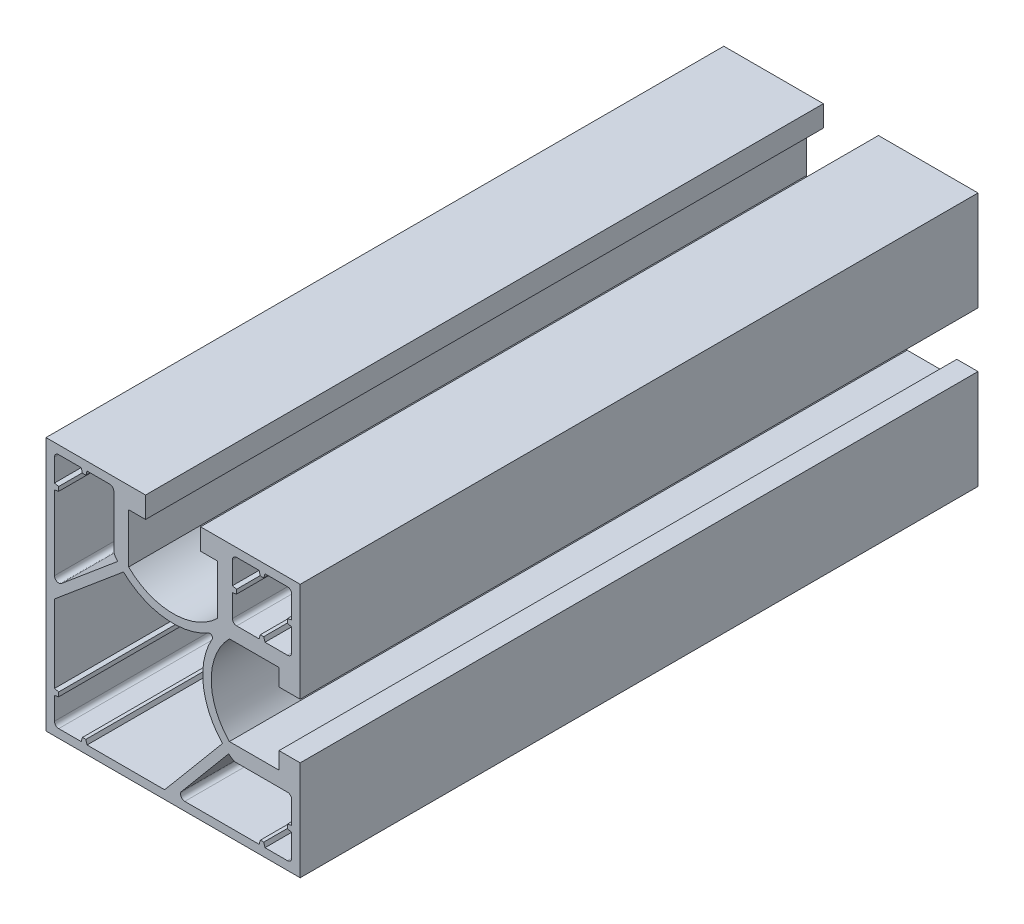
ISO-10303-21;
HEADER;
FILE_DESCRIPTION(('STEP AP214'),'2;1');
FILE_NAME('part.step','',(''),(''),'','','');
FILE_SCHEMA(('AUTOMOTIVE_DESIGN { 1 0 10303 214 1 1 1 1 }'));
ENDSEC;
DATA;
#1=APPLICATION_CONTEXT('core data for automotive mechanical design processes');
#2=APPLICATION_PROTOCOL_DEFINITION('international standard','automotive_design',2000,#1);
#3=PRODUCT_CONTEXT('',#1,'mechanical');
#4=PRODUCT('Part','Part','',(#3));
#5=PRODUCT_RELATED_PRODUCT_CATEGORY('part','',(#4));
#6=PRODUCT_DEFINITION_FORMATION('','',#4);
#7=PRODUCT_DEFINITION_CONTEXT('part definition',#1,'design');
#8=PRODUCT_DEFINITION('design','',#6,#7);
#9=PRODUCT_DEFINITION_SHAPE('','',#8);
#10=(LENGTH_UNIT() NAMED_UNIT(*) SI_UNIT(.MILLI.,.METRE.));
#11=(NAMED_UNIT(*) PLANE_ANGLE_UNIT() SI_UNIT($,.RADIAN.));
#12=(NAMED_UNIT(*) SI_UNIT($,.STERADIAN.) SOLID_ANGLE_UNIT());
#13=UNCERTAINTY_MEASURE_WITH_UNIT(LENGTH_MEASURE(1.E-05),#10,'distance_accuracy_value','');
#14=(GEOMETRIC_REPRESENTATION_CONTEXT(3) GLOBAL_UNCERTAINTY_ASSIGNED_CONTEXT((#13)) GLOBAL_UNIT_ASSIGNED_CONTEXT((#10,
#11,#12)) REPRESENTATION_CONTEXT('',''));
#15=CARTESIAN_POINT('',(0.,0.,0.));
#16=DIRECTION('',(0.,0.,1.));
#17=DIRECTION('',(1.,0.,0.));
#18=AXIS2_PLACEMENT_3D('',#15,#16,#17);
#19=CARTESIAN_POINT('',(12.,0.,40.));
#20=DIRECTION('',(0.,0.,-1.));
#21=DIRECTION('',(-1.,0.,0.));
#22=AXIS2_PLACEMENT_3D('',#19,#20,#21);
#23=PLANE('',#22);
#24=DIRECTION('',(0.,1.,0.));
#25=VECTOR('',#24,1.);
#26=CARTESIAN_POINT('',(14.,-10.15,40.));
#27=LINE('',#26,#25);
#28=CARTESIAN_POINT('',(14.,-10.15,40.));
#29=VERTEX_POINT('',#28);
#30=CARTESIAN_POINT('',(13.9999999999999,-7.49999999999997,40.));
#31=VERTEX_POINT('',#30);
#32=EDGE_CURVE('E735',#29,#31,#27,.T.);
#33=ORIENTED_EDGE('',*,*,#32,.F.);
#34=DIRECTION('',(0.98058067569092,0.196116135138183,0.));
#35=VECTOR('',#34,1.);
#36=CARTESIAN_POINT('',(14.,-10.15,40.));
#37=LINE('',#36,#35);
#38=CARTESIAN_POINT('',(13.5,-10.25,40.));
#39=VERTEX_POINT('',#38);
#40=EDGE_CURVE('E766',#39,#29,#37,.T.);
#41=ORIENTED_EDGE('',*,*,#40,.F.);
#42=DIRECTION('',(0.,1.,0.));
#43=VECTOR('',#42,1.);
#44=CARTESIAN_POINT('',(13.5,-10.75,40.));
#45=LINE('',#44,#43);
#46=CARTESIAN_POINT('',(13.5,-10.75,40.));
#47=VERTEX_POINT('',#46);
#48=EDGE_CURVE('E763',#47,#39,#45,.T.);
#49=ORIENTED_EDGE('',*,*,#48,.F.);
#50=DIRECTION('',(-0.98058067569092,0.196116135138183,0.));
#51=VECTOR('',#50,1.);
#52=CARTESIAN_POINT('',(14.,-10.85,40.));
#53=LINE('',#52,#51);
#54=CARTESIAN_POINT('',(14.,-10.85,40.));
#55=VERTEX_POINT('',#54);
#56=EDGE_CURVE('E761',#55,#47,#53,.T.);
#57=ORIENTED_EDGE('',*,*,#56,.F.);
#58=DIRECTION('',(0.,1.,0.));
#59=VECTOR('',#58,1.);
#60=CARTESIAN_POINT('',(14.,-14.0000000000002,40.));
#61=LINE('',#60,#59);
#62=CARTESIAN_POINT('',(14.,-13.5000000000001,40.));
#63=VERTEX_POINT('',#62);
#64=EDGE_CURVE('E759',#63,#55,#61,.T.);
#65=ORIENTED_EDGE('',*,*,#64,.F.);
#66=CARTESIAN_POINT('',(13.5,-13.5000000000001,40.));
#67=DIRECTION('',(0.,0.,-1.));
#68=DIRECTION('',(-1.,0.,0.));
#69=AXIS2_PLACEMENT_3D('',#66,#67,#68);
#70=CIRCLE('',#69,0.5);
#71=CARTESIAN_POINT('',(13.5,-14.0000000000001,40.));
#72=VERTEX_POINT('',#71);
#73=EDGE_CURVE('E1246',#63,#72,#70,.T.);
#74=ORIENTED_EDGE('',*,*,#73,.T.);
#75=DIRECTION('',(1.,0.,0.));
#76=VECTOR('',#75,1.);
#77=CARTESIAN_POINT('',(10.85,-14.,40.));
#78=LINE('',#77,#76);
#79=CARTESIAN_POINT('',(10.85,-14.,40.));
#80=VERTEX_POINT('',#79);
#81=EDGE_CURVE('E756',#80,#72,#78,.T.);
#82=ORIENTED_EDGE('',*,*,#81,.F.);
#83=DIRECTION('',(0.287347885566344,-0.957826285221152,0.));
#84=VECTOR('',#83,1.);
#85=CARTESIAN_POINT('',(10.85,-14.,40.));
#86=LINE('',#85,#84);
#87=CARTESIAN_POINT('',(10.7,-13.5,40.));
#88=VERTEX_POINT('',#87);
#89=EDGE_CURVE('E754',#88,#80,#86,.T.);
#90=ORIENTED_EDGE('',*,*,#89,.F.);
#91=DIRECTION('',(1.,0.,0.));
#92=VECTOR('',#91,1.);
#93=CARTESIAN_POINT('',(10.3,-13.5,40.));
#94=LINE('',#93,#92);
#95=CARTESIAN_POINT('',(10.3,-13.5,40.));
#96=VERTEX_POINT('',#95);
#97=EDGE_CURVE('E752',#96,#88,#94,.T.);
#98=ORIENTED_EDGE('',*,*,#97,.F.);
#99=DIRECTION('',(0.287347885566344,0.957826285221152,0.));
#100=VECTOR('',#99,1.);
#101=CARTESIAN_POINT('',(10.15,-14.,40.));
#102=LINE('',#101,#100);
#103=CARTESIAN_POINT('',(10.15,-14.,40.));
#104=VERTEX_POINT('',#103);
#105=EDGE_CURVE('E750',#104,#96,#102,.T.);
#106=ORIENTED_EDGE('',*,*,#105,.F.);
#107=DIRECTION('',(1.,0.,0.));
#108=VECTOR('',#107,1.);
#109=CARTESIAN_POINT('',(0.305407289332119,-14.0000000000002,40.));
#110=LINE('',#109,#108);
#111=CARTESIAN_POINT('',(1.37766074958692,-14.0000000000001,40.));
#112=VERTEX_POINT('',#111);
#113=EDGE_CURVE('E748',#112,#104,#110,.T.);
#114=ORIENTED_EDGE('',*,*,#113,.F.);
#115=CARTESIAN_POINT('',(1.37766074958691,-13.5000000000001,40.));
#116=DIRECTION('',(0.,0.,-1.));
#117=DIRECTION('',(-1.,0.,0.));
#118=AXIS2_PLACEMENT_3D('',#115,#116,#117);
#119=CIRCLE('',#118,0.5);
#120=CARTESIAN_POINT('',(0.994638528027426,-13.1786061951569,40.));
#121=VERTEX_POINT('',#120);
#122=EDGE_CURVE('E1250',#112,#121,#119,.T.);
#123=ORIENTED_EDGE('',*,*,#122,.T.);
#124=DIRECTION('',(-0.64278760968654,-0.766044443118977,0.));
#125=VECTOR('',#124,1.);
#126=CARTESIAN_POINT('',(0.305407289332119,-14.0000000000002,40.));
#127=LINE('',#126,#125);
#128=CARTESIAN_POINT('',(6.56735274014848,-6.53730401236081,40.));
#129=VERTEX_POINT('',#128);
#130=EDGE_CURVE('E745',#129,#121,#127,.T.);
#131=ORIENTED_EDGE('',*,*,#130,.F.);
#132=CARTESIAN_POINT('',(12.,0.,40.));
#133=DIRECTION('',(0.,0.,-1.));
#134=DIRECTION('',(-1.,0.,0.));
#135=AXIS2_PLACEMENT_3D('',#132,#133,#134);
#136=CIRCLE('',#135,8.50000000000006);
#137=CARTESIAN_POINT('',(6.9,-6.8,40.));
#138=VERTEX_POINT('',#137);
#139=EDGE_CURVE('E743',#138,#129,#136,.T.);
#140=ORIENTED_EDGE('',*,*,#139,.F.);
#141=CARTESIAN_POINT('',(7.5,-6.,40.));
#142=DIRECTION('',(0.,0.,-1.));
#143=DIRECTION('',(-1.,0.,0.));
#144=AXIS2_PLACEMENT_3D('',#141,#142,#143);
#145=CIRCLE('',#144,1.);
#146=CARTESIAN_POINT('',(7.5,-7.,40.));
#147=VERTEX_POINT('',#146);
#148=EDGE_CURVE('E741',#147,#138,#145,.T.);
#149=ORIENTED_EDGE('',*,*,#148,.F.);
#150=DIRECTION('',(-1.,0.,0.));
#151=VECTOR('',#150,1.);
#152=CARTESIAN_POINT('',(7.5,-7.,40.));
#153=LINE('',#152,#151);
#154=CARTESIAN_POINT('',(13.4999999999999,-7.,40.));
#155=VERTEX_POINT('',#154);
#156=EDGE_CURVE('E738',#155,#147,#153,.T.);
#157=ORIENTED_EDGE('',*,*,#156,.F.);
#158=CARTESIAN_POINT('',(13.4999999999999,-7.5,40.));
#159=DIRECTION('',(0.,0.,-1.));
#160=DIRECTION('',(-1.,0.,0.));
#161=AXIS2_PLACEMENT_3D('',#158,#159,#160);
#162=CIRCLE('',#161,0.5);
#163=EDGE_CURVE('E1242',#155,#31,#162,.T.);
#164=ORIENTED_EDGE('',*,*,#163,.T.);
#165=EDGE_LOOP('',(#33,#41,#49,#57,#65,#74,#82,#90,#98,#106,#114,#123,#131,#140,#149,#157,#164));
#166=FACE_BOUND('',#165,.T.);
#167=DIRECTION('',(0.,-1.,0.));
#168=VECTOR('',#167,1.);
#169=CARTESIAN_POINT('',(6.99999999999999,14.0000000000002,40.));
#170=LINE('',#169,#168);
#171=CARTESIAN_POINT('',(6.99999999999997,13.5000000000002,40.));
#172=VERTEX_POINT('',#171);
#173=CARTESIAN_POINT('',(6.99999999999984,10.8500000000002,40.));
#174=VERTEX_POINT('',#173);
#175=EDGE_CURVE('E928',#172,#174,#170,.T.);
#176=ORIENTED_EDGE('',*,*,#175,.F.);
#177=CARTESIAN_POINT('',(7.49999999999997,13.5000000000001,40.));
#178=DIRECTION('',(0.,0.,-1.));
#179=DIRECTION('',(-1.,0.,0.));
#180=AXIS2_PLACEMENT_3D('',#177,#178,#179);
#181=CIRCLE('',#180,0.5);
#182=CARTESIAN_POINT('',(7.5,14.0000000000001,40.));
#183=VERTEX_POINT('',#182);
#184=EDGE_CURVE('E11',#172,#183,#181,.T.);
#185=ORIENTED_EDGE('',*,*,#184,.T.);
#186=DIRECTION('',(-1.,0.,0.));
#187=VECTOR('',#186,1.);
#188=CARTESIAN_POINT('',(6.99999999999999,14.0000000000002,40.));
#189=LINE('',#188,#187);
#190=CARTESIAN_POINT('',(10.15,14.,40.));
#191=VERTEX_POINT('',#190);
#192=EDGE_CURVE('E971',#191,#183,#189,.T.);
#193=ORIENTED_EDGE('',*,*,#192,.F.);
#194=DIRECTION('',(-0.287347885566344,0.957826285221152,0.));
#195=VECTOR('',#194,1.);
#196=CARTESIAN_POINT('',(10.15,14.,40.));
#197=LINE('',#196,#195);
#198=CARTESIAN_POINT('',(10.3,13.5,40.));
#199=VERTEX_POINT('',#198);
#200=EDGE_CURVE('E968',#199,#191,#197,.T.);
#201=ORIENTED_EDGE('',*,*,#200,.F.);
#202=DIRECTION('',(-1.,0.,0.));
#203=VECTOR('',#202,1.);
#204=CARTESIAN_POINT('',(10.3,13.5,40.));
#205=LINE('',#204,#203);
#206=CARTESIAN_POINT('',(10.7,13.5,40.));
#207=VERTEX_POINT('',#206);
#208=EDGE_CURVE('E966',#207,#199,#205,.T.);
#209=ORIENTED_EDGE('',*,*,#208,.F.);
#210=DIRECTION('',(-0.287347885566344,-0.957826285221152,0.));
#211=VECTOR('',#210,1.);
#212=CARTESIAN_POINT('',(10.85,14.,40.));
#213=LINE('',#212,#211);
#214=CARTESIAN_POINT('',(10.85,14.,40.));
#215=VERTEX_POINT('',#214);
#216=EDGE_CURVE('E964',#215,#207,#213,.T.);
#217=ORIENTED_EDGE('',*,*,#216,.F.);
#218=DIRECTION('',(-1.,0.,0.));
#219=VECTOR('',#218,1.);
#220=CARTESIAN_POINT('',(10.85,14.,40.));
#221=LINE('',#220,#219);
#222=CARTESIAN_POINT('',(13.5,14.0000000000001,40.));
#223=VERTEX_POINT('',#222);
#224=EDGE_CURVE('E962',#223,#215,#221,.T.);
#225=ORIENTED_EDGE('',*,*,#224,.F.);
#226=CARTESIAN_POINT('',(13.5,13.5000000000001,40.));
#227=DIRECTION('',(0.,0.,-1.));
#228=DIRECTION('',(-1.,0.,0.));
#229=AXIS2_PLACEMENT_3D('',#226,#227,#228);
#230=CIRCLE('',#229,0.5);
#231=CARTESIAN_POINT('',(14.,13.5000000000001,40.));
#232=VERTEX_POINT('',#231);
#233=EDGE_CURVE('E1297',#223,#232,#230,.T.);
#234=ORIENTED_EDGE('',*,*,#233,.T.);
#235=DIRECTION('',(0.,1.,0.));
#236=VECTOR('',#235,1.);
#237=CARTESIAN_POINT('',(14.,14.0000000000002,40.));
#238=LINE('',#237,#236);
#239=CARTESIAN_POINT('',(14.,10.85,40.));
#240=VERTEX_POINT('',#239);
#241=EDGE_CURVE('E959',#240,#232,#238,.T.);
#242=ORIENTED_EDGE('',*,*,#241,.F.);
#243=DIRECTION('',(0.98058067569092,0.196116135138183,0.));
#244=VECTOR('',#243,1.);
#245=CARTESIAN_POINT('',(14.,10.85,40.));
#246=LINE('',#245,#244);
#247=CARTESIAN_POINT('',(13.5,10.75,40.));
#248=VERTEX_POINT('',#247);
#249=EDGE_CURVE('E957',#248,#240,#246,.T.);
#250=ORIENTED_EDGE('',*,*,#249,.F.);
#251=DIRECTION('',(0.,1.,0.));
#252=VECTOR('',#251,1.);
#253=CARTESIAN_POINT('',(13.5,10.75,40.));
#254=LINE('',#253,#252);
#255=CARTESIAN_POINT('',(13.5,10.25,40.));
#256=VERTEX_POINT('',#255);
#257=EDGE_CURVE('E955',#256,#248,#254,.T.);
#258=ORIENTED_EDGE('',*,*,#257,.F.);
#259=DIRECTION('',(-0.98058067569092,0.196116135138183,0.));
#260=VECTOR('',#259,1.);
#261=CARTESIAN_POINT('',(14.,10.15,40.));
#262=LINE('',#261,#260);
#263=CARTESIAN_POINT('',(14.,10.15,40.));
#264=VERTEX_POINT('',#263);
#265=EDGE_CURVE('E953',#264,#256,#262,.T.);
#266=ORIENTED_EDGE('',*,*,#265,.F.);
#267=DIRECTION('',(0.,1.,0.));
#268=VECTOR('',#267,1.);
#269=CARTESIAN_POINT('',(14.,10.15,40.));
#270=LINE('',#269,#268);
#271=CARTESIAN_POINT('',(13.9999999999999,7.49999999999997,40.));
#272=VERTEX_POINT('',#271);
#273=EDGE_CURVE('E951',#272,#264,#270,.T.);
#274=ORIENTED_EDGE('',*,*,#273,.F.);
#275=CARTESIAN_POINT('',(13.4999999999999,7.5,40.));
#276=DIRECTION('',(0.,0.,-1.));
#277=DIRECTION('',(-1.,0.,0.));
#278=AXIS2_PLACEMENT_3D('',#275,#276,#277);
#279=CIRCLE('',#278,0.5);
#280=CARTESIAN_POINT('',(13.4999999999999,7.,40.));
#281=VERTEX_POINT('',#280);
#282=EDGE_CURVE('E1293',#272,#281,#279,.T.);
#283=ORIENTED_EDGE('',*,*,#282,.T.);
#284=DIRECTION('',(1.,0.,0.));
#285=VECTOR('',#284,1.);
#286=CARTESIAN_POINT('',(10.85,7.,40.));
#287=LINE('',#286,#285);
#288=CARTESIAN_POINT('',(10.85,7.,40.));
#289=VERTEX_POINT('',#288);
#290=EDGE_CURVE('E948',#289,#281,#287,.T.);
#291=ORIENTED_EDGE('',*,*,#290,.F.);
#292=DIRECTION('',(0.287347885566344,-0.957826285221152,0.));
#293=VECTOR('',#292,1.);
#294=CARTESIAN_POINT('',(10.85,7.,40.));
#295=LINE('',#294,#293);
#296=CARTESIAN_POINT('',(10.7,7.5,40.));
#297=VERTEX_POINT('',#296);
#298=EDGE_CURVE('E946',#297,#289,#295,.T.);
#299=ORIENTED_EDGE('',*,*,#298,.F.);
#300=DIRECTION('',(1.,0.,0.));
#301=VECTOR('',#300,1.);
#302=CARTESIAN_POINT('',(10.3,7.5,40.));
#303=LINE('',#302,#301);
#304=CARTESIAN_POINT('',(10.3,7.5,40.));
#305=VERTEX_POINT('',#304);
#306=EDGE_CURVE('E944',#305,#297,#303,.T.);
#307=ORIENTED_EDGE('',*,*,#306,.F.);
#308=DIRECTION('',(0.287347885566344,0.957826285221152,0.));
#309=VECTOR('',#308,1.);
#310=CARTESIAN_POINT('',(10.15,7.,40.));
#311=LINE('',#310,#309);
#312=CARTESIAN_POINT('',(10.15,7.,40.));
#313=VERTEX_POINT('',#312);
#314=EDGE_CURVE('E942',#313,#305,#311,.T.);
#315=ORIENTED_EDGE('',*,*,#314,.F.);
#316=DIRECTION('',(1.,0.,0.));
#317=VECTOR('',#316,1.);
#318=CARTESIAN_POINT('',(6.99999999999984,7.,40.));
#319=LINE('',#318,#317);
#320=CARTESIAN_POINT('',(7.49999999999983,7.,40.));
#321=VERTEX_POINT('',#320);
#322=EDGE_CURVE('E940',#321,#313,#319,.T.);
#323=ORIENTED_EDGE('',*,*,#322,.F.);
#324=CARTESIAN_POINT('',(7.49999999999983,7.5,40.));
#325=DIRECTION('',(0.,0.,-1.));
#326=DIRECTION('',(-1.,0.,0.));
#327=AXIS2_PLACEMENT_3D('',#324,#325,#326);
#328=CIRCLE('',#327,0.5);
#329=CARTESIAN_POINT('',(6.99999999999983,7.5,40.));
#330=VERTEX_POINT('',#329);
#331=EDGE_CURVE('E1289',#321,#330,#328,.T.);
#332=ORIENTED_EDGE('',*,*,#331,.T.);
#333=DIRECTION('',(0.,-1.,0.));
#334=VECTOR('',#333,1.);
#335=CARTESIAN_POINT('',(6.99999999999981,10.1500000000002,40.));
#336=LINE('',#335,#334);
#337=CARTESIAN_POINT('',(6.99999999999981,10.1500000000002,40.));
#338=VERTEX_POINT('',#337);
#339=EDGE_CURVE('E937',#338,#330,#336,.T.);
#340=ORIENTED_EDGE('',*,*,#339,.F.);
#341=DIRECTION('',(-0.98058067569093,-0.196116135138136,0.));
#342=VECTOR('',#341,1.);
#343=CARTESIAN_POINT('',(6.99999999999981,10.1500000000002,40.));
#344=LINE('',#343,#342);
#345=CARTESIAN_POINT('',(7.49999999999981,10.2500000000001,40.));
#346=VERTEX_POINT('',#345);
#347=EDGE_CURVE('E935',#346,#338,#344,.T.);
#348=ORIENTED_EDGE('',*,*,#347,.F.);
#349=DIRECTION('',(0.,-1.,0.));
#350=VECTOR('',#349,1.);
#351=CARTESIAN_POINT('',(7.49999999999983,10.7500000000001,40.));
#352=LINE('',#351,#350);
#353=CARTESIAN_POINT('',(7.49999999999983,10.7500000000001,40.));
#354=VERTEX_POINT('',#353);
#355=EDGE_CURVE('E933',#354,#346,#352,.T.);
#356=ORIENTED_EDGE('',*,*,#355,.F.);
#357=DIRECTION('',(0.980580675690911,-0.196116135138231,0.));
#358=VECTOR('',#357,1.);
#359=CARTESIAN_POINT('',(6.99999999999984,10.8500000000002,40.));
#360=LINE('',#359,#358);
#361=EDGE_CURVE('E930',#174,#354,#360,.T.);
#362=ORIENTED_EDGE('',*,*,#361,.F.);
#363=EDGE_LOOP('',(#176,#185,#193,#201,#209,#217,#225,#234,#242,#250,#258,#266,#274,#283,#291,
#299,#307,#315,#323,#332,#340,#348,#356,#362));
#364=FACE_BOUND('',#363,.T.);
#365=DIRECTION('',(0.,-1.,0.));
#366=VECTOR('',#365,1.);
#367=CARTESIAN_POINT('',(-15.,15.,40.));
#368=LINE('',#367,#366);
#369=CARTESIAN_POINT('',(-15.,15.,40.));
#370=VERTEX_POINT('',#369);
#371=CARTESIAN_POINT('',(-15.,-14.9999999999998,40.));
#372=VERTEX_POINT('',#371);
#373=EDGE_CURVE('E1064',#370,#372,#368,.T.);
#374=ORIENTED_EDGE('',*,*,#373,.T.);
#375=DIRECTION('',(1.,0.,0.));
#376=VECTOR('',#375,1.);
#377=CARTESIAN_POINT('',(-15.,-14.9999999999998,40.));
#378=LINE('',#377,#376);
#379=CARTESIAN_POINT('',(15.,-14.9999999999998,40.));
#380=VERTEX_POINT('',#379);
#381=EDGE_CURVE('E1067',#372,#380,#378,.T.);
#382=ORIENTED_EDGE('',*,*,#381,.T.);
#383=DIRECTION('',(0.,1.,0.));
#384=VECTOR('',#383,1.);
#385=CARTESIAN_POINT('',(15.,-14.9999999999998,40.));
#386=LINE('',#385,#384);
#387=CARTESIAN_POINT('',(15.,-3.25,40.));
#388=VERTEX_POINT('',#387);
#389=EDGE_CURVE('E1070',#380,#388,#386,.T.);
#390=ORIENTED_EDGE('',*,*,#389,.T.);
#391=DIRECTION('',(-1.,0.,0.));
#392=VECTOR('',#391,1.);
#393=CARTESIAN_POINT('',(15.,-3.25,40.));
#394=LINE('',#393,#392);
#395=CARTESIAN_POINT('',(12.5,-3.25,40.));
#396=VERTEX_POINT('',#395);
#397=EDGE_CURVE('E1072',#388,#396,#394,.T.);
#398=ORIENTED_EDGE('',*,*,#397,.T.);
#399=DIRECTION('',(0.,-1.,0.));
#400=VECTOR('',#399,1.);
#401=CARTESIAN_POINT('',(12.5,-3.25,40.));
#402=LINE('',#401,#400);
#403=CARTESIAN_POINT('',(12.5,-5.25,40.));
#404=VERTEX_POINT('',#403);
#405=EDGE_CURVE('E1074',#396,#404,#402,.T.);
#406=ORIENTED_EDGE('',*,*,#405,.T.);
#407=DIRECTION('',(-1.,0.,0.));
#408=VECTOR('',#407,1.);
#409=CARTESIAN_POINT('',(12.5,-5.25,40.));
#410=LINE('',#409,#408);
#411=CARTESIAN_POINT('',(6.64392867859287,-5.25,40.));
#412=VERTEX_POINT('',#411);
#413=EDGE_CURVE('E1076',#404,#412,#410,.T.);
#414=ORIENTED_EDGE('',*,*,#413,.T.);
#415=CARTESIAN_POINT('',(12.,0.,40.));
#416=DIRECTION('',(0.,0.,-1.));
#417=DIRECTION('',(-1.,0.,0.));
#418=AXIS2_PLACEMENT_3D('',#415,#416,#417);
#419=CIRCLE('',#418,7.5);
#420=CARTESIAN_POINT('',(6.64392867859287,5.25,40.));
#421=VERTEX_POINT('',#420);
#422=EDGE_CURVE('E1078',#412,#421,#419,.T.);
#423=ORIENTED_EDGE('',*,*,#422,.T.);
#424=DIRECTION('',(1.,0.,0.));
#425=VECTOR('',#424,1.);
#426=CARTESIAN_POINT('',(12.5,5.25,40.));
#427=LINE('',#426,#425);
#428=CARTESIAN_POINT('',(12.5,5.25,40.));
#429=VERTEX_POINT('',#428);
#430=EDGE_CURVE('E1080',#421,#429,#427,.T.);
#431=ORIENTED_EDGE('',*,*,#430,.T.);
#432=DIRECTION('',(0.,-1.,0.));
#433=VECTOR('',#432,1.);
#434=CARTESIAN_POINT('',(12.5,3.25,40.));
#435=LINE('',#434,#433);
#436=CARTESIAN_POINT('',(12.5,3.25,40.));
#437=VERTEX_POINT('',#436);
#438=EDGE_CURVE('E1082',#429,#437,#435,.T.);
#439=ORIENTED_EDGE('',*,*,#438,.T.);
#440=DIRECTION('',(1.,0.,0.));
#441=VECTOR('',#440,1.);
#442=CARTESIAN_POINT('',(15.,3.25,40.));
#443=LINE('',#442,#441);
#444=CARTESIAN_POINT('',(15.,3.25,40.));
#445=VERTEX_POINT('',#444);
#446=EDGE_CURVE('E1084',#437,#445,#443,.T.);
#447=ORIENTED_EDGE('',*,*,#446,.T.);
#448=DIRECTION('',(0.,1.,0.));
#449=VECTOR('',#448,1.);
#450=CARTESIAN_POINT('',(15.,15.,40.));
#451=LINE('',#450,#449);
#452=CARTESIAN_POINT('',(15.,15.,40.));
#453=VERTEX_POINT('',#452);
#454=EDGE_CURVE('E1086',#445,#453,#451,.T.);
#455=ORIENTED_EDGE('',*,*,#454,.T.);
#456=DIRECTION('',(-1.,0.,0.));
#457=VECTOR('',#456,1.);
#458=CARTESIAN_POINT('',(3.25000000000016,15.,40.));
#459=LINE('',#458,#457);
#460=CARTESIAN_POINT('',(3.25000000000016,15.,40.));
#461=VERTEX_POINT('',#460);
#462=EDGE_CURVE('E1088',#453,#461,#459,.T.);
#463=ORIENTED_EDGE('',*,*,#462,.T.);
#464=DIRECTION('',(0.,-1.,0.));
#465=VECTOR('',#464,1.);
#466=CARTESIAN_POINT('',(3.25000000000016,15.,40.));
#467=LINE('',#466,#465);
#468=CARTESIAN_POINT('',(3.25000000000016,12.5,40.));
#469=VERTEX_POINT('',#468);
#470=EDGE_CURVE('E1090',#461,#469,#467,.T.);
#471=ORIENTED_EDGE('',*,*,#470,.T.);
#472=DIRECTION('',(1.,0.,0.));
#473=VECTOR('',#472,1.);
#474=CARTESIAN_POINT('',(3.25000000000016,12.5,40.));
#475=LINE('',#474,#473);
#476=CARTESIAN_POINT('',(5.25,12.5,40.));
#477=VERTEX_POINT('',#476);
#478=EDGE_CURVE('E1092',#469,#477,#475,.T.);
#479=ORIENTED_EDGE('',*,*,#478,.T.);
#480=DIRECTION('',(0.,-1.,0.));
#481=VECTOR('',#480,1.);
#482=CARTESIAN_POINT('',(5.25,12.5,40.));
#483=LINE('',#482,#481);
#484=CARTESIAN_POINT('',(5.25,6.64392867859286,40.));
#485=VERTEX_POINT('',#484);
#486=EDGE_CURVE('E1094',#477,#485,#483,.T.);
#487=ORIENTED_EDGE('',*,*,#486,.T.);
#488=CARTESIAN_POINT('',(0.,12.,40.));
#489=DIRECTION('',(0.,0.,-1.));
#490=DIRECTION('',(1.,0.,0.));
#491=AXIS2_PLACEMENT_3D('',#488,#489,#490);
#492=CIRCLE('',#491,7.5);
#493=CARTESIAN_POINT('',(-5.25,6.64392867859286,40.));
#494=VERTEX_POINT('',#493);
#495=EDGE_CURVE('E1096',#485,#494,#492,.T.);
#496=ORIENTED_EDGE('',*,*,#495,.T.);
#497=DIRECTION('',(0.,1.,0.));
#498=VECTOR('',#497,1.);
#499=CARTESIAN_POINT('',(-5.25,12.5,40.));
#500=LINE('',#499,#498);
#501=CARTESIAN_POINT('',(-5.25,12.5,40.));
#502=VERTEX_POINT('',#501);
#503=EDGE_CURVE('E1098',#494,#502,#500,.T.);
#504=ORIENTED_EDGE('',*,*,#503,.T.);
#505=DIRECTION('',(1.,0.,0.));
#506=VECTOR('',#505,1.);
#507=CARTESIAN_POINT('',(-3.25000000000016,12.5,40.));
#508=LINE('',#507,#506);
#509=CARTESIAN_POINT('',(-3.25000000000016,12.5,40.));
#510=VERTEX_POINT('',#509);
#511=EDGE_CURVE('E1100',#502,#510,#508,.T.);
#512=ORIENTED_EDGE('',*,*,#511,.T.);
#513=DIRECTION('',(0.,1.,0.));
#514=VECTOR('',#513,1.);
#515=CARTESIAN_POINT('',(-3.25000000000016,15.,40.));
#516=LINE('',#515,#514);
#517=CARTESIAN_POINT('',(-3.25000000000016,15.,40.));
#518=VERTEX_POINT('',#517);
#519=EDGE_CURVE('E1102',#510,#518,#516,.T.);
#520=ORIENTED_EDGE('',*,*,#519,.T.);
#521=DIRECTION('',(-1.,0.,0.));
#522=VECTOR('',#521,1.);
#523=CARTESIAN_POINT('',(-15.,15.,40.));
#524=LINE('',#523,#522);
#525=EDGE_CURVE('E1104',#518,#370,#524,.T.);
#526=ORIENTED_EDGE('',*,*,#525,.T.);
#527=EDGE_LOOP('',(#374,#382,#390,#398,#406,#414,#423,#431,#439,#447,#455,#463,#471,#479,#487,
#496,#504,#512,#520,#526));
#528=FACE_BOUND('',#527,.T.);
#529=DIRECTION('',(-1.,0.,0.));
#530=VECTOR('',#529,1.);
#531=CARTESIAN_POINT('',(-6.99999999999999,14.0000000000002,40.));
#532=LINE('',#531,#530);
#533=CARTESIAN_POINT('',(-7.50000000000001,14.0000000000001,40.));
#534=VERTEX_POINT('',#533);
#535=CARTESIAN_POINT('',(-10.15,14.,40.));
#536=VERTEX_POINT('',#535);
#537=EDGE_CURVE('E832',#534,#536,#532,.T.);
#538=ORIENTED_EDGE('',*,*,#537,.F.);
#539=CARTESIAN_POINT('',(-7.49999999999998,13.5000000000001,40.));
#540=DIRECTION('',(0.,0.,-1.));
#541=DIRECTION('',(-1.,0.,0.));
#542=AXIS2_PLACEMENT_3D('',#539,#540,#541);
#543=CIRCLE('',#542,0.5);
#544=CARTESIAN_POINT('',(-6.99999999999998,13.5000000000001,40.));
#545=VERTEX_POINT('',#544);
#546=EDGE_CURVE('E1262',#534,#545,#543,.T.);
#547=ORIENTED_EDGE('',*,*,#546,.T.);
#548=DIRECTION('',(0.,1.,0.));
#549=VECTOR('',#548,1.);
#550=CARTESIAN_POINT('',(-6.99999999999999,14.0000000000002,40.));
#551=LINE('',#550,#549);
#552=CARTESIAN_POINT('',(-6.99999999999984,7.49999999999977,40.));
#553=VERTEX_POINT('',#552);
#554=EDGE_CURVE('E862',#553,#545,#551,.T.);
#555=ORIENTED_EDGE('',*,*,#554,.F.);
#556=CARTESIAN_POINT('',(-5.99999999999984,7.49999999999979,40.));
#557=DIRECTION('',(0.,0.,-1.));
#558=DIRECTION('',(1.,0.,0.));
#559=AXIS2_PLACEMENT_3D('',#556,#557,#558);
#560=CIRCLE('',#559,1.);
#561=CARTESIAN_POINT('',(-6.79999999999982,6.89999999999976,40.));
#562=VERTEX_POINT('',#561);
#563=EDGE_CURVE('E859',#562,#553,#560,.T.);
#564=ORIENTED_EDGE('',*,*,#563,.F.);
#565=CARTESIAN_POINT('',(0.,12.,40.));
#566=DIRECTION('',(0.,0.,-1.));
#567=DIRECTION('',(-1.,0.,0.));
#568=AXIS2_PLACEMENT_3D('',#565,#566,#567);
#569=CIRCLE('',#568,8.5);
#570=CARTESIAN_POINT('',(-6.53730401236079,6.56735274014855,40.));
#571=VERTEX_POINT('',#570);
#572=EDGE_CURVE('E857',#571,#562,#569,.T.);
#573=ORIENTED_EDGE('',*,*,#572,.F.);
#574=DIRECTION('',(0.766044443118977,0.642787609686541,0.));
#575=VECTOR('',#574,1.);
#576=CARTESIAN_POINT('',(-13.9999999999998,0.305407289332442,40.));
#577=LINE('',#576,#575);
#578=CARTESIAN_POINT('',(-13.1786061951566,0.994638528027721,40.));
#579=VERTEX_POINT('',#578);
#580=EDGE_CURVE('E855',#579,#571,#577,.T.);
#581=ORIENTED_EDGE('',*,*,#580,.F.);
#582=CARTESIAN_POINT('',(-13.4999999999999,1.37766074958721,40.));
#583=DIRECTION('',(0.,0.,-1.));
#584=DIRECTION('',(-1.,0.,0.));
#585=AXIS2_PLACEMENT_3D('',#582,#583,#584);
#586=CIRCLE('',#585,0.5);
#587=CARTESIAN_POINT('',(-13.9999999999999,1.3776607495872,40.));
#588=VERTEX_POINT('',#587);
#589=EDGE_CURVE('E1258',#579,#588,#586,.T.);
#590=ORIENTED_EDGE('',*,*,#589,.T.);
#591=DIRECTION('',(0.,-1.,0.));
#592=VECTOR('',#591,1.);
#593=CARTESIAN_POINT('',(-14.,10.15,40.));
#594=LINE('',#593,#592);
#595=CARTESIAN_POINT('',(-14.,10.15,40.));
#596=VERTEX_POINT('',#595);
#597=EDGE_CURVE('E852',#596,#588,#594,.T.);
#598=ORIENTED_EDGE('',*,*,#597,.F.);
#599=DIRECTION('',(-0.98058067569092,-0.196116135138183,0.));
#600=VECTOR('',#599,1.);
#601=CARTESIAN_POINT('',(-14.,10.15,40.));
#602=LINE('',#601,#600);
#603=CARTESIAN_POINT('',(-13.5,10.25,40.));
#604=VERTEX_POINT('',#603);
#605=EDGE_CURVE('E850',#604,#596,#602,.T.);
#606=ORIENTED_EDGE('',*,*,#605,.F.);
#607=DIRECTION('',(0.,-1.,0.));
#608=VECTOR('',#607,1.);
#609=CARTESIAN_POINT('',(-13.5,10.75,40.));
#610=LINE('',#609,#608);
#611=CARTESIAN_POINT('',(-13.5,10.75,40.));
#612=VERTEX_POINT('',#611);
#613=EDGE_CURVE('E848',#612,#604,#610,.T.);
#614=ORIENTED_EDGE('',*,*,#613,.F.);
#615=DIRECTION('',(0.98058067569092,-0.196116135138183,0.));
#616=VECTOR('',#615,1.);
#617=CARTESIAN_POINT('',(-14.,10.85,40.));
#618=LINE('',#617,#616);
#619=CARTESIAN_POINT('',(-14.,10.85,40.));
#620=VERTEX_POINT('',#619);
#621=EDGE_CURVE('E846',#620,#612,#618,.T.);
#622=ORIENTED_EDGE('',*,*,#621,.F.);
#623=DIRECTION('',(0.,-1.,0.));
#624=VECTOR('',#623,1.);
#625=CARTESIAN_POINT('',(-14.,14.0000000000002,40.));
#626=LINE('',#625,#624);
#627=CARTESIAN_POINT('',(-14.,13.5000000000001,40.));
#628=VERTEX_POINT('',#627);
#629=EDGE_CURVE('E844',#628,#620,#626,.T.);
#630=ORIENTED_EDGE('',*,*,#629,.F.);
#631=CARTESIAN_POINT('',(-13.5,13.5000000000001,40.));
#632=DIRECTION('',(0.,0.,-1.));
#633=DIRECTION('',(-1.,0.,0.));
#634=AXIS2_PLACEMENT_3D('',#631,#632,#633);
#635=CIRCLE('',#634,0.5);
#636=CARTESIAN_POINT('',(-13.5,14.0000000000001,40.));
#637=VERTEX_POINT('',#636);
#638=EDGE_CURVE('E1266',#628,#637,#635,.T.);
#639=ORIENTED_EDGE('',*,*,#638,.T.);
#640=DIRECTION('',(-1.,0.,0.));
#641=VECTOR('',#640,1.);
#642=CARTESIAN_POINT('',(-10.85,14.,40.));
#643=LINE('',#642,#641);
#644=CARTESIAN_POINT('',(-10.85,14.,40.));
#645=VERTEX_POINT('',#644);
#646=EDGE_CURVE('E841',#645,#637,#643,.T.);
#647=ORIENTED_EDGE('',*,*,#646,.F.);
#648=DIRECTION('',(-0.287347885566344,0.957826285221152,0.));
#649=VECTOR('',#648,1.);
#650=CARTESIAN_POINT('',(-10.85,14.,40.));
#651=LINE('',#650,#649);
#652=CARTESIAN_POINT('',(-10.7,13.5,40.));
#653=VERTEX_POINT('',#652);
#654=EDGE_CURVE('E839',#653,#645,#651,.T.);
#655=ORIENTED_EDGE('',*,*,#654,.F.);
#656=DIRECTION('',(-1.,0.,0.));
#657=VECTOR('',#656,1.);
#658=CARTESIAN_POINT('',(-10.3,13.5,40.));
#659=LINE('',#658,#657);
#660=CARTESIAN_POINT('',(-10.3,13.5,40.));
#661=VERTEX_POINT('',#660);
#662=EDGE_CURVE('E837',#661,#653,#659,.T.);
#663=ORIENTED_EDGE('',*,*,#662,.F.);
#664=DIRECTION('',(-0.287347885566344,-0.957826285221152,0.));
#665=VECTOR('',#664,1.);
#666=CARTESIAN_POINT('',(-10.15,14.,40.));
#667=LINE('',#666,#665);
#668=EDGE_CURVE('E834',#536,#661,#667,.T.);
#669=ORIENTED_EDGE('',*,*,#668,.F.);
#670=EDGE_LOOP('',(#538,#547,#555,#564,#573,#581,#590,#598,#606,#614,#622,#630,#639,#647,#655,
#663,#669));
#671=FACE_BOUND('',#670,.T.);
#672=DIRECTION('',(1.,0.,0.));
#673=VECTOR('',#672,1.);
#674=CARTESIAN_POINT('',(-10.15,-14.,40.));
#675=LINE('',#674,#673);
#676=CARTESIAN_POINT('',(-10.15,-14.,40.));
#677=VERTEX_POINT('',#676);
#678=CARTESIAN_POINT('',(-1.00000000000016,-14.0000000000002,40.));
#679=VERTEX_POINT('',#678);
#680=EDGE_CURVE('E617',#677,#679,#675,.T.);
#681=ORIENTED_EDGE('',*,*,#680,.F.);
#682=DIRECTION('',(0.287347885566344,-0.957826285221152,0.));
#683=VECTOR('',#682,1.);
#684=CARTESIAN_POINT('',(-10.15,-14.,40.));
#685=LINE('',#684,#683);
#686=CARTESIAN_POINT('',(-10.3,-13.5,40.));
#687=VERTEX_POINT('',#686);
#688=EDGE_CURVE('E668',#687,#677,#685,.T.);
#689=ORIENTED_EDGE('',*,*,#688,.F.);
#690=DIRECTION('',(1.,0.,0.));
#691=VECTOR('',#690,1.);
#692=CARTESIAN_POINT('',(-10.3,-13.5,40.));
#693=LINE('',#692,#691);
#694=CARTESIAN_POINT('',(-10.7,-13.5,40.));
#695=VERTEX_POINT('',#694);
#696=EDGE_CURVE('E665',#695,#687,#693,.T.);
#697=ORIENTED_EDGE('',*,*,#696,.F.);
#698=DIRECTION('',(0.287347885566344,0.957826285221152,0.));
#699=VECTOR('',#698,1.);
#700=CARTESIAN_POINT('',(-10.85,-14.,40.));
#701=LINE('',#700,#699);
#702=CARTESIAN_POINT('',(-10.85,-14.,40.));
#703=VERTEX_POINT('',#702);
#704=EDGE_CURVE('E663',#703,#695,#701,.T.);
#705=ORIENTED_EDGE('',*,*,#704,.F.);
#706=DIRECTION('',(1.,0.,0.));
#707=VECTOR('',#706,1.);
#708=CARTESIAN_POINT('',(-14.,-14.,40.));
#709=LINE('',#708,#707);
#710=CARTESIAN_POINT('',(-13.5,-14.,40.));
#711=VERTEX_POINT('',#710);
#712=EDGE_CURVE('E661',#711,#703,#709,.T.);
#713=ORIENTED_EDGE('',*,*,#712,.F.);
#714=CARTESIAN_POINT('',(-13.5,-13.5,40.));
#715=DIRECTION('',(0.,0.,-1.));
#716=DIRECTION('',(-1.,0.,0.));
#717=AXIS2_PLACEMENT_3D('',#714,#715,#716);
#718=CIRCLE('',#717,0.5);
#719=CARTESIAN_POINT('',(-14.,-13.5,40.));
#720=VERTEX_POINT('',#719);
#721=EDGE_CURVE('E1254',#711,#720,#718,.T.);
#722=ORIENTED_EDGE('',*,*,#721,.T.);
#723=DIRECTION('',(0.,-1.,0.));
#724=VECTOR('',#723,1.);
#725=CARTESIAN_POINT('',(-14.,-10.85,40.));
#726=LINE('',#725,#724);
#727=CARTESIAN_POINT('',(-14.,-10.85,40.));
#728=VERTEX_POINT('',#727);
#729=EDGE_CURVE('E658',#728,#720,#726,.T.);
#730=ORIENTED_EDGE('',*,*,#729,.F.);
#731=DIRECTION('',(-0.98058067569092,-0.196116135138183,0.));
#732=VECTOR('',#731,1.);
#733=CARTESIAN_POINT('',(-14.,-10.85,40.));
#734=LINE('',#733,#732);
#735=CARTESIAN_POINT('',(-13.5,-10.75,40.));
#736=VERTEX_POINT('',#735);
#737=EDGE_CURVE('E656',#736,#728,#734,.T.);
#738=ORIENTED_EDGE('',*,*,#737,.F.);
#739=DIRECTION('',(0.,-1.,0.));
#740=VECTOR('',#739,1.);
#741=CARTESIAN_POINT('',(-13.5,-10.75,40.));
#742=LINE('',#741,#740);
#743=CARTESIAN_POINT('',(-13.5,-10.25,40.));
#744=VERTEX_POINT('',#743);
#745=EDGE_CURVE('E654',#744,#736,#742,.T.);
#746=ORIENTED_EDGE('',*,*,#745,.F.);
#747=DIRECTION('',(0.98058067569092,-0.196116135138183,0.));
#748=VECTOR('',#747,1.);
#749=CARTESIAN_POINT('',(-14.,-10.15,40.));
#750=LINE('',#749,#748);
#751=CARTESIAN_POINT('',(-14.,-10.15,40.));
#752=VERTEX_POINT('',#751);
#753=EDGE_CURVE('E652',#752,#744,#750,.T.);
#754=ORIENTED_EDGE('',*,*,#753,.F.);
#755=DIRECTION('',(0.,-1.,0.));
#756=VECTOR('',#755,1.);
#757=CARTESIAN_POINT('',(-13.9999999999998,-0.999999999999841,40.));
#758=LINE('',#757,#756);
#759=CARTESIAN_POINT('',(-13.9999999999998,-0.999999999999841,40.));
#760=VERTEX_POINT('',#759);
#761=EDGE_CURVE('E650',#760,#752,#758,.T.);
#762=ORIENTED_EDGE('',*,*,#761,.F.);
#763=DIRECTION('',(-0.766044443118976,-0.642787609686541,0.));
#764=VECTOR('',#763,1.);
#765=CARTESIAN_POINT('',(-13.9999999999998,-0.999999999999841,40.));
#766=LINE('',#765,#764);
#767=CARTESIAN_POINT('',(-5.85296729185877,5.8361721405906,40.));
#768=VERTEX_POINT('',#767);
#769=EDGE_CURVE('E648',#768,#760,#766,.T.);
#770=ORIENTED_EDGE('',*,*,#769,.F.);
#771=CARTESIAN_POINT('',(0.,12.,40.));
#772=DIRECTION('',(0.,0.,-1.));
#773=DIRECTION('',(1.,0.,0.));
#774=AXIS2_PLACEMENT_3D('',#771,#772,#773);
#775=CIRCLE('',#774,8.5);
#776=CARTESIAN_POINT('',(4.20243646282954,4.61152737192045,40.));
#777=VERTEX_POINT('',#776);
#778=EDGE_CURVE('E646',#777,#768,#775,.T.);
#779=ORIENTED_EDGE('',*,*,#778,.F.);
#780=CARTESIAN_POINT('',(4.35075774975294,4.35075774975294,40.));
#781=DIRECTION('',(0.,0.,1.));
#782=DIRECTION('',(-1.,0.,0.));
#783=AXIS2_PLACEMENT_3D('',#780,#781,#782);
#784=CIRCLE('',#783,0.3);
#785=CARTESIAN_POINT('',(4.61152737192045,4.20243646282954,40.));
#786=VERTEX_POINT('',#785);
#787=EDGE_CURVE('E642',#786,#777,#784,.T.);
#788=ORIENTED_EDGE('',*,*,#787,.F.);
#789=CARTESIAN_POINT('',(12.,0.,40.));
#790=DIRECTION('',(0.,0.,-1.));
#791=DIRECTION('',(-1.,0.,0.));
#792=AXIS2_PLACEMENT_3D('',#789,#790,#791);
#793=CIRCLE('',#792,8.50000000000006);
#794=CARTESIAN_POINT('',(5.83617214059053,-5.85296729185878,40.));
#795=VERTEX_POINT('',#794);
#796=EDGE_CURVE('E640',#795,#786,#793,.T.);
#797=ORIENTED_EDGE('',*,*,#796,.F.);
#798=DIRECTION('',(0.64278760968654,0.766044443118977,0.));
#799=VECTOR('',#798,1.);
#800=CARTESIAN_POINT('',(-1.00000000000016,-14.0000000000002,40.));
#801=LINE('',#800,#799);
#802=EDGE_CURVE('E627',#679,#795,#801,.T.);
#803=ORIENTED_EDGE('',*,*,#802,.F.);
#804=EDGE_LOOP('',(#681,#689,#697,#705,#713,#722,#730,#738,#746,#754,#762,#770,#779,#788,#797,#803));
#805=FACE_BOUND('',#804,.T.);
#806=ADVANCED_FACE('F37',(#166,#364,#528,#671,#805),#23,.F.);
#807=CARTESIAN_POINT('',(12.,0.,-40.));
#808=DIRECTION('',(0.,0.,-1.));
#809=DIRECTION('',(-1.,0.,0.));
#810=AXIS2_PLACEMENT_3D('',#807,#808,#809);
#811=PLANE('',#810);
#812=DIRECTION('',(0.98058067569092,0.196116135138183,0.));
#813=VECTOR('',#812,1.);
#814=CARTESIAN_POINT('',(14.,-10.15,-40.));
#815=LINE('',#814,#813);
#816=CARTESIAN_POINT('',(13.5,-10.25,-40.));
#817=VERTEX_POINT('',#816);
#818=CARTESIAN_POINT('',(14.,-10.15,-40.));
#819=VERTEX_POINT('',#818);
#820=EDGE_CURVE('E739',#817,#819,#815,.T.);
#821=ORIENTED_EDGE('',*,*,#820,.T.);
#822=DIRECTION('',(0.,1.,0.));
#823=VECTOR('',#822,1.);
#824=CARTESIAN_POINT('',(14.,-10.15,-40.));
#825=LINE('',#824,#823);
#826=CARTESIAN_POINT('',(13.9999999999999,-7.49999999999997,-40.));
#827=VERTEX_POINT('',#826);
#828=EDGE_CURVE('E635',#819,#827,#825,.T.);
#829=ORIENTED_EDGE('',*,*,#828,.T.);
#830=CARTESIAN_POINT('',(13.4999999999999,-7.5,-40.));
#831=DIRECTION('',(0.,0.,-1.));
#832=DIRECTION('',(-1.,0.,0.));
#833=AXIS2_PLACEMENT_3D('',#830,#831,#832);
#834=CIRCLE('',#833,0.5);
#835=CARTESIAN_POINT('',(13.4999999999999,-7.,-40.));
#836=VERTEX_POINT('',#835);
#837=EDGE_CURVE('E1240',#827,#836,#834,.F.);
#838=ORIENTED_EDGE('',*,*,#837,.T.);
#839=DIRECTION('',(-1.,0.,0.));
#840=VECTOR('',#839,1.);
#841=CARTESIAN_POINT('',(7.5,-7.,-40.));
#842=LINE('',#841,#840);
#843=CARTESIAN_POINT('',(7.5,-7.,-40.));
#844=VERTEX_POINT('',#843);
#845=EDGE_CURVE('E771',#836,#844,#842,.T.);
#846=ORIENTED_EDGE('',*,*,#845,.T.);
#847=CARTESIAN_POINT('',(7.5,-6.,-40.));
#848=DIRECTION('',(0.,0.,-1.));
#849=DIRECTION('',(-1.,0.,0.));
#850=AXIS2_PLACEMENT_3D('',#847,#848,#849);
#851=CIRCLE('',#850,1.);
#852=CARTESIAN_POINT('',(6.9,-6.8,-40.));
#853=VERTEX_POINT('',#852);
#854=EDGE_CURVE('E773',#844,#853,#851,.T.);
#855=ORIENTED_EDGE('',*,*,#854,.T.);
#856=CARTESIAN_POINT('',(12.,0.,-40.));
#857=DIRECTION('',(0.,0.,-1.));
#858=DIRECTION('',(-1.,0.,0.));
#859=AXIS2_PLACEMENT_3D('',#856,#857,#858);
#860=CIRCLE('',#859,8.50000000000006);
#861=CARTESIAN_POINT('',(6.56735274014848,-6.53730401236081,-40.));
#862=VERTEX_POINT('',#861);
#863=EDGE_CURVE('E776',#853,#862,#860,.T.);
#864=ORIENTED_EDGE('',*,*,#863,.T.);
#865=DIRECTION('',(-0.64278760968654,-0.766044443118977,0.));
#866=VECTOR('',#865,1.);
#867=CARTESIAN_POINT('',(0.305407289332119,-14.0000000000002,-40.));
#868=LINE('',#867,#866);
#869=CARTESIAN_POINT('',(0.994638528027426,-13.1786061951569,-40.));
#870=VERTEX_POINT('',#869);
#871=EDGE_CURVE('E779',#862,#870,#868,.T.);
#872=ORIENTED_EDGE('',*,*,#871,.T.);
#873=CARTESIAN_POINT('',(1.37766074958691,-13.5000000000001,-40.));
#874=DIRECTION('',(0.,0.,-1.));
#875=DIRECTION('',(-1.,0.,0.));
#876=AXIS2_PLACEMENT_3D('',#873,#874,#875);
#877=CIRCLE('',#876,0.5);
#878=CARTESIAN_POINT('',(1.37766074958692,-14.0000000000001,-40.));
#879=VERTEX_POINT('',#878);
#880=EDGE_CURVE('E1248',#870,#879,#877,.F.);
#881=ORIENTED_EDGE('',*,*,#880,.T.);
#882=DIRECTION('',(1.,0.,0.));
#883=VECTOR('',#882,1.);
#884=CARTESIAN_POINT('',(0.305407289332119,-14.0000000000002,-40.));
#885=LINE('',#884,#883);
#886=CARTESIAN_POINT('',(10.15,-14.,-40.));
#887=VERTEX_POINT('',#886);
#888=EDGE_CURVE('E782',#879,#887,#885,.T.);
#889=ORIENTED_EDGE('',*,*,#888,.T.);
#890=DIRECTION('',(0.287347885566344,0.957826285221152,0.));
#891=VECTOR('',#890,1.);
#892=CARTESIAN_POINT('',(10.15,-14.,-40.));
#893=LINE('',#892,#891);
#894=CARTESIAN_POINT('',(10.3,-13.5,-40.));
#895=VERTEX_POINT('',#894);
#896=EDGE_CURVE('E784',#887,#895,#893,.T.);
#897=ORIENTED_EDGE('',*,*,#896,.T.);
#898=DIRECTION('',(1.,0.,0.));
#899=VECTOR('',#898,1.);
#900=CARTESIAN_POINT('',(10.3,-13.5,-40.));
#901=LINE('',#900,#899);
#902=CARTESIAN_POINT('',(10.7,-13.5,-40.));
#903=VERTEX_POINT('',#902);
#904=EDGE_CURVE('E787',#895,#903,#901,.T.);
#905=ORIENTED_EDGE('',*,*,#904,.T.);
#906=DIRECTION('',(0.287347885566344,-0.957826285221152,0.));
#907=VECTOR('',#906,1.);
#908=CARTESIAN_POINT('',(10.85,-14.,-40.));
#909=LINE('',#908,#907);
#910=CARTESIAN_POINT('',(10.85,-14.,-40.));
#911=VERTEX_POINT('',#910);
#912=EDGE_CURVE('E790',#903,#911,#909,.T.);
#913=ORIENTED_EDGE('',*,*,#912,.T.);
#914=DIRECTION('',(1.,0.,0.));
#915=VECTOR('',#914,1.);
#916=CARTESIAN_POINT('',(10.85,-14.,-40.));
#917=LINE('',#916,#915);
#918=CARTESIAN_POINT('',(13.5,-14.0000000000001,-40.));
#919=VERTEX_POINT('',#918);
#920=EDGE_CURVE('E793',#911,#919,#917,.T.);
#921=ORIENTED_EDGE('',*,*,#920,.T.);
#922=CARTESIAN_POINT('',(13.5,-13.5000000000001,-40.));
#923=DIRECTION('',(0.,0.,-1.));
#924=DIRECTION('',(-1.,0.,0.));
#925=AXIS2_PLACEMENT_3D('',#922,#923,#924);
#926=CIRCLE('',#925,0.5);
#927=CARTESIAN_POINT('',(14.,-13.5000000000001,-40.));
#928=VERTEX_POINT('',#927);
#929=EDGE_CURVE('E1244',#919,#928,#926,.F.);
#930=ORIENTED_EDGE('',*,*,#929,.T.);
#931=DIRECTION('',(0.,1.,0.));
#932=VECTOR('',#931,1.);
#933=CARTESIAN_POINT('',(14.,-14.0000000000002,-40.));
#934=LINE('',#933,#932);
#935=CARTESIAN_POINT('',(14.,-10.85,-40.));
#936=VERTEX_POINT('',#935);
#937=EDGE_CURVE('E796',#928,#936,#934,.T.);
#938=ORIENTED_EDGE('',*,*,#937,.T.);
#939=DIRECTION('',(-0.98058067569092,0.196116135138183,0.));
#940=VECTOR('',#939,1.);
#941=CARTESIAN_POINT('',(14.,-10.85,-40.));
#942=LINE('',#941,#940);
#943=CARTESIAN_POINT('',(13.5,-10.75,-40.));
#944=VERTEX_POINT('',#943);
#945=EDGE_CURVE('E798',#936,#944,#942,.T.);
#946=ORIENTED_EDGE('',*,*,#945,.T.);
#947=DIRECTION('',(0.,1.,0.));
#948=VECTOR('',#947,1.);
#949=CARTESIAN_POINT('',(13.5,-10.75,-40.));
#950=LINE('',#949,#948);
#951=EDGE_CURVE('E801',#944,#817,#950,.T.);
#952=ORIENTED_EDGE('',*,*,#951,.T.);
#953=EDGE_LOOP('',(#821,#829,#838,#846,#855,#864,#872,#881,#889,#897,#905,#913,#921,#930,#938,
#946,#952));
#954=FACE_BOUND('',#953,.T.);
#955=DIRECTION('',(-1.,0.,0.));
#956=VECTOR('',#955,1.);
#957=CARTESIAN_POINT('',(6.99999999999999,14.0000000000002,-40.));
#958=LINE('',#957,#956);
#959=CARTESIAN_POINT('',(10.15,14.,-40.));
#960=VERTEX_POINT('',#959);
#961=CARTESIAN_POINT('',(7.5,14.0000000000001,-40.));
#962=VERTEX_POINT('',#961);
#963=EDGE_CURVE('E931',#960,#962,#958,.T.);
#964=ORIENTED_EDGE('',*,*,#963,.T.);
#965=CARTESIAN_POINT('',(7.49999999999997,13.5000000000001,-40.));
#966=DIRECTION('',(0.,0.,-1.));
#967=DIRECTION('',(-1.,0.,0.));
#968=AXIS2_PLACEMENT_3D('',#965,#966,#967);
#969=CIRCLE('',#968,0.5);
#970=CARTESIAN_POINT('',(6.99999999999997,13.5000000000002,-40.));
#971=VERTEX_POINT('',#970);
#972=EDGE_CURVE('E45',#962,#971,#969,.F.);
#973=ORIENTED_EDGE('',*,*,#972,.T.);
#974=DIRECTION('',(0.,-1.,0.));
#975=VECTOR('',#974,1.);
#976=CARTESIAN_POINT('',(6.99999999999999,14.0000000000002,-40.));
#977=LINE('',#976,#975);
#978=CARTESIAN_POINT('',(6.99999999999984,10.8500000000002,-40.));
#979=VERTEX_POINT('',#978);
#980=EDGE_CURVE('E927',#971,#979,#977,.T.);
#981=ORIENTED_EDGE('',*,*,#980,.T.);
#982=DIRECTION('',(0.980580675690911,-0.196116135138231,0.));
#983=VECTOR('',#982,1.);
#984=CARTESIAN_POINT('',(6.99999999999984,10.8500000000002,-40.));
#985=LINE('',#984,#983);
#986=CARTESIAN_POINT('',(7.49999999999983,10.7500000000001,-40.));
#987=VERTEX_POINT('',#986);
#988=EDGE_CURVE('E976',#979,#987,#985,.T.);
#989=ORIENTED_EDGE('',*,*,#988,.T.);
#990=DIRECTION('',(0.,-1.,0.));
#991=VECTOR('',#990,1.);
#992=CARTESIAN_POINT('',(7.49999999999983,10.7500000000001,-40.));
#993=LINE('',#992,#991);
#994=CARTESIAN_POINT('',(7.49999999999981,10.2500000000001,-40.));
#995=VERTEX_POINT('',#994);
#996=EDGE_CURVE('E979',#987,#995,#993,.T.);
#997=ORIENTED_EDGE('',*,*,#996,.T.);
#998=DIRECTION('',(-0.98058067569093,-0.196116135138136,0.));
#999=VECTOR('',#998,1.);
#1000=CARTESIAN_POINT('',(6.99999999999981,10.1500000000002,-40.));
#1001=LINE('',#1000,#999);
#1002=CARTESIAN_POINT('',(6.99999999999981,10.1500000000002,-40.));
#1003=VERTEX_POINT('',#1002);
#1004=EDGE_CURVE('E982',#995,#1003,#1001,.T.);
#1005=ORIENTED_EDGE('',*,*,#1004,.T.);
#1006=DIRECTION('',(0.,-1.,0.));
#1007=VECTOR('',#1006,1.);
#1008=CARTESIAN_POINT('',(6.99999999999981,10.1500000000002,-40.));
#1009=LINE('',#1008,#1007);
#1010=CARTESIAN_POINT('',(6.99999999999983,7.5,-40.));
#1011=VERTEX_POINT('',#1010);
#1012=EDGE_CURVE('E985',#1003,#1011,#1009,.T.);
#1013=ORIENTED_EDGE('',*,*,#1012,.T.);
#1014=CARTESIAN_POINT('',(7.49999999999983,7.5,-40.));
#1015=DIRECTION('',(0.,0.,-1.));
#1016=DIRECTION('',(-1.,0.,0.));
#1017=AXIS2_PLACEMENT_3D('',#1014,#1015,#1016);
#1018=CIRCLE('',#1017,0.5);
#1019=CARTESIAN_POINT('',(7.49999999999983,7.,-40.));
#1020=VERTEX_POINT('',#1019);
#1021=EDGE_CURVE('E1287',#1011,#1020,#1018,.F.);
#1022=ORIENTED_EDGE('',*,*,#1021,.T.);
#1023=DIRECTION('',(1.,0.,0.));
#1024=VECTOR('',#1023,1.);
#1025=CARTESIAN_POINT('',(6.99999999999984,7.,-40.));
#1026=LINE('',#1025,#1024);
#1027=CARTESIAN_POINT('',(10.15,7.,-40.));
#1028=VERTEX_POINT('',#1027);
#1029=EDGE_CURVE('E988',#1020,#1028,#1026,.T.);
#1030=ORIENTED_EDGE('',*,*,#1029,.T.);
#1031=DIRECTION('',(0.287347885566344,0.957826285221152,0.));
#1032=VECTOR('',#1031,1.);
#1033=CARTESIAN_POINT('',(10.15,7.,-40.));
#1034=LINE('',#1033,#1032);
#1035=CARTESIAN_POINT('',(10.3,7.5,-40.));
#1036=VERTEX_POINT('',#1035);
#1037=EDGE_CURVE('E990',#1028,#1036,#1034,.T.);
#1038=ORIENTED_EDGE('',*,*,#1037,.T.);
#1039=DIRECTION('',(1.,0.,0.));
#1040=VECTOR('',#1039,1.);
#1041=CARTESIAN_POINT('',(10.3,7.5,-40.));
#1042=LINE('',#1041,#1040);
#1043=CARTESIAN_POINT('',(10.7,7.5,-40.));
#1044=VERTEX_POINT('',#1043);
#1045=EDGE_CURVE('E993',#1036,#1044,#1042,.T.);
#1046=ORIENTED_EDGE('',*,*,#1045,.T.);
#1047=DIRECTION('',(0.287347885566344,-0.957826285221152,0.));
#1048=VECTOR('',#1047,1.);
#1049=CARTESIAN_POINT('',(10.85,7.,-40.));
#1050=LINE('',#1049,#1048);
#1051=CARTESIAN_POINT('',(10.85,7.,-40.));
#1052=VERTEX_POINT('',#1051);
#1053=EDGE_CURVE('E996',#1044,#1052,#1050,.T.);
#1054=ORIENTED_EDGE('',*,*,#1053,.T.);
#1055=DIRECTION('',(1.,0.,0.));
#1056=VECTOR('',#1055,1.);
#1057=CARTESIAN_POINT('',(10.85,7.,-40.));
#1058=LINE('',#1057,#1056);
#1059=CARTESIAN_POINT('',(13.4999999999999,7.,-40.));
#1060=VERTEX_POINT('',#1059);
#1061=EDGE_CURVE('E999',#1052,#1060,#1058,.T.);
#1062=ORIENTED_EDGE('',*,*,#1061,.T.);
#1063=CARTESIAN_POINT('',(13.4999999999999,7.5,-40.));
#1064=DIRECTION('',(0.,0.,-1.));
#1065=DIRECTION('',(-1.,0.,0.));
#1066=AXIS2_PLACEMENT_3D('',#1063,#1064,#1065);
#1067=CIRCLE('',#1066,0.5);
#1068=CARTESIAN_POINT('',(13.9999999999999,7.49999999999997,-40.));
#1069=VERTEX_POINT('',#1068);
#1070=EDGE_CURVE('E1291',#1060,#1069,#1067,.F.);
#1071=ORIENTED_EDGE('',*,*,#1070,.T.);
#1072=DIRECTION('',(0.,1.,0.));
#1073=VECTOR('',#1072,1.);
#1074=CARTESIAN_POINT('',(14.,10.15,-40.));
#1075=LINE('',#1074,#1073);
#1076=CARTESIAN_POINT('',(14.,10.15,-40.));
#1077=VERTEX_POINT('',#1076);
#1078=EDGE_CURVE('E1002',#1069,#1077,#1075,.T.);
#1079=ORIENTED_EDGE('',*,*,#1078,.T.);
#1080=DIRECTION('',(-0.98058067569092,0.196116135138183,0.));
#1081=VECTOR('',#1080,1.);
#1082=CARTESIAN_POINT('',(14.,10.15,-40.));
#1083=LINE('',#1082,#1081);
#1084=CARTESIAN_POINT('',(13.5,10.25,-40.));
#1085=VERTEX_POINT('',#1084);
#1086=EDGE_CURVE('E1004',#1077,#1085,#1083,.T.);
#1087=ORIENTED_EDGE('',*,*,#1086,.T.);
#1088=DIRECTION('',(0.,1.,0.));
#1089=VECTOR('',#1088,1.);
#1090=CARTESIAN_POINT('',(13.5,10.75,-40.));
#1091=LINE('',#1090,#1089);
#1092=CARTESIAN_POINT('',(13.5,10.75,-40.));
#1093=VERTEX_POINT('',#1092);
#1094=EDGE_CURVE('E1007',#1085,#1093,#1091,.T.);
#1095=ORIENTED_EDGE('',*,*,#1094,.T.);
#1096=DIRECTION('',(0.98058067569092,0.196116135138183,0.));
#1097=VECTOR('',#1096,1.);
#1098=CARTESIAN_POINT('',(14.,10.85,-40.));
#1099=LINE('',#1098,#1097);
#1100=CARTESIAN_POINT('',(14.,10.85,-40.));
#1101=VERTEX_POINT('',#1100);
#1102=EDGE_CURVE('E1010',#1093,#1101,#1099,.T.);
#1103=ORIENTED_EDGE('',*,*,#1102,.T.);
#1104=DIRECTION('',(0.,1.,0.));
#1105=VECTOR('',#1104,1.);
#1106=CARTESIAN_POINT('',(14.,14.0000000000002,-40.));
#1107=LINE('',#1106,#1105);
#1108=CARTESIAN_POINT('',(14.,13.5000000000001,-40.));
#1109=VERTEX_POINT('',#1108);
#1110=EDGE_CURVE('E1013',#1101,#1109,#1107,.T.);
#1111=ORIENTED_EDGE('',*,*,#1110,.T.);
#1112=CARTESIAN_POINT('',(13.5,13.5000000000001,-40.));
#1113=DIRECTION('',(0.,0.,-1.));
#1114=DIRECTION('',(-1.,0.,0.));
#1115=AXIS2_PLACEMENT_3D('',#1112,#1113,#1114);
#1116=CIRCLE('',#1115,0.5);
#1117=CARTESIAN_POINT('',(13.5,14.0000000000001,-40.));
#1118=VERTEX_POINT('',#1117);
#1119=EDGE_CURVE('E1295',#1109,#1118,#1116,.F.);
#1120=ORIENTED_EDGE('',*,*,#1119,.T.);
#1121=DIRECTION('',(-1.,0.,0.));
#1122=VECTOR('',#1121,1.);
#1123=CARTESIAN_POINT('',(10.85,14.,-40.));
#1124=LINE('',#1123,#1122);
#1125=CARTESIAN_POINT('',(10.85,14.,-40.));
#1126=VERTEX_POINT('',#1125);
#1127=EDGE_CURVE('E1016',#1118,#1126,#1124,.T.);
#1128=ORIENTED_EDGE('',*,*,#1127,.T.);
#1129=DIRECTION('',(-0.287347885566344,-0.957826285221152,0.));
#1130=VECTOR('',#1129,1.);
#1131=CARTESIAN_POINT('',(10.85,14.,-40.));
#1132=LINE('',#1131,#1130);
#1133=CARTESIAN_POINT('',(10.7,13.5,-40.));
#1134=VERTEX_POINT('',#1133);
#1135=EDGE_CURVE('E1018',#1126,#1134,#1132,.T.);
#1136=ORIENTED_EDGE('',*,*,#1135,.T.);
#1137=DIRECTION('',(-1.,0.,0.));
#1138=VECTOR('',#1137,1.);
#1139=CARTESIAN_POINT('',(10.3,13.5,-40.));
#1140=LINE('',#1139,#1138);
#1141=CARTESIAN_POINT('',(10.3,13.5,-40.));
#1142=VERTEX_POINT('',#1141);
#1143=EDGE_CURVE('E1021',#1134,#1142,#1140,.T.);
#1144=ORIENTED_EDGE('',*,*,#1143,.T.);
#1145=DIRECTION('',(-0.287347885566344,0.957826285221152,0.));
#1146=VECTOR('',#1145,1.);
#1147=CARTESIAN_POINT('',(10.15,14.,-40.));
#1148=LINE('',#1147,#1146);
#1149=EDGE_CURVE('E1024',#1142,#960,#1148,.T.);
#1150=ORIENTED_EDGE('',*,*,#1149,.T.);
#1151=EDGE_LOOP('',(#964,#973,#981,#989,#997,#1005,#1013,#1022,#1030,#1038,#1046,#1054,#1062,
#1071,#1079,#1087,#1095,#1103,#1111,#1120,#1128,#1136,#1144,#1150));
#1152=FACE_BOUND('',#1151,.T.);
#1153=DIRECTION('',(0.,-1.,0.));
#1154=VECTOR('',#1153,1.);
#1155=CARTESIAN_POINT('',(-15.,15.,-40.));
#1156=LINE('',#1155,#1154);
#1157=CARTESIAN_POINT('',(-15.,15.,-40.));
#1158=VERTEX_POINT('',#1157);
#1159=CARTESIAN_POINT('',(-15.,-14.9999999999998,-40.));
#1160=VERTEX_POINT('',#1159);
#1161=EDGE_CURVE('E1063',#1158,#1160,#1156,.T.);
#1162=ORIENTED_EDGE('',*,*,#1161,.F.);
#1163=DIRECTION('',(-1.,0.,0.));
#1164=VECTOR('',#1163,1.);
#1165=CARTESIAN_POINT('',(-15.,15.,-40.));
#1166=LINE('',#1165,#1164);
#1167=CARTESIAN_POINT('',(-3.25000000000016,15.,-40.));
#1168=VERTEX_POINT('',#1167);
#1169=EDGE_CURVE('E1068',#1168,#1158,#1166,.T.);
#1170=ORIENTED_EDGE('',*,*,#1169,.F.);
#1171=DIRECTION('',(0.,1.,0.));
#1172=VECTOR('',#1171,1.);
#1173=CARTESIAN_POINT('',(-3.25000000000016,15.,-40.));
#1174=LINE('',#1173,#1172);
#1175=CARTESIAN_POINT('',(-3.25000000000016,12.5,-40.));
#1176=VERTEX_POINT('',#1175);
#1177=EDGE_CURVE('E1143',#1176,#1168,#1174,.T.);
#1178=ORIENTED_EDGE('',*,*,#1177,.F.);
#1179=DIRECTION('',(1.,0.,0.));
#1180=VECTOR('',#1179,1.);
#1181=CARTESIAN_POINT('',(-3.25000000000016,12.5,-40.));
#1182=LINE('',#1181,#1180);
#1183=CARTESIAN_POINT('',(-5.25,12.5,-40.));
#1184=VERTEX_POINT('',#1183);
#1185=EDGE_CURVE('E1141',#1184,#1176,#1182,.T.);
#1186=ORIENTED_EDGE('',*,*,#1185,.F.);
#1187=DIRECTION('',(0.,1.,0.));
#1188=VECTOR('',#1187,1.);
#1189=CARTESIAN_POINT('',(-5.25,12.5,-40.));
#1190=LINE('',#1189,#1188);
#1191=CARTESIAN_POINT('',(-5.25,6.64392867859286,-40.));
#1192=VERTEX_POINT('',#1191);
#1193=EDGE_CURVE('E1139',#1192,#1184,#1190,.T.);
#1194=ORIENTED_EDGE('',*,*,#1193,.F.);
#1195=CARTESIAN_POINT('',(0.,12.,-40.));
#1196=DIRECTION('',(0.,0.,-1.));
#1197=DIRECTION('',(1.,0.,0.));
#1198=AXIS2_PLACEMENT_3D('',#1195,#1196,#1197);
#1199=CIRCLE('',#1198,7.5);
#1200=CARTESIAN_POINT('',(5.25,6.64392867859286,-40.));
#1201=VERTEX_POINT('',#1200);
#1202=EDGE_CURVE('E1137',#1201,#1192,#1199,.T.);
#1203=ORIENTED_EDGE('',*,*,#1202,.F.);
#1204=DIRECTION('',(0.,-1.,0.));
#1205=VECTOR('',#1204,1.);
#1206=CARTESIAN_POINT('',(5.25,12.5,-40.));
#1207=LINE('',#1206,#1205);
#1208=CARTESIAN_POINT('',(5.25,12.5,-40.));
#1209=VERTEX_POINT('',#1208);
#1210=EDGE_CURVE('E1135',#1209,#1201,#1207,.T.);
#1211=ORIENTED_EDGE('',*,*,#1210,.F.);
#1212=DIRECTION('',(1.,0.,0.));
#1213=VECTOR('',#1212,1.);
#1214=CARTESIAN_POINT('',(3.25000000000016,12.5,-40.));
#1215=LINE('',#1214,#1213);
#1216=CARTESIAN_POINT('',(3.25000000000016,12.5,-40.));
#1217=VERTEX_POINT('',#1216);
#1218=EDGE_CURVE('E1133',#1217,#1209,#1215,.T.);
#1219=ORIENTED_EDGE('',*,*,#1218,.F.);
#1220=DIRECTION('',(0.,-1.,0.));
#1221=VECTOR('',#1220,1.);
#1222=CARTESIAN_POINT('',(3.25000000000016,15.,-40.));
#1223=LINE('',#1222,#1221);
#1224=CARTESIAN_POINT('',(3.25000000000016,15.,-40.));
#1225=VERTEX_POINT('',#1224);
#1226=EDGE_CURVE('E1131',#1225,#1217,#1223,.T.);
#1227=ORIENTED_EDGE('',*,*,#1226,.F.);
#1228=DIRECTION('',(-1.,0.,0.));
#1229=VECTOR('',#1228,1.);
#1230=CARTESIAN_POINT('',(3.25000000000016,15.,-40.));
#1231=LINE('',#1230,#1229);
#1232=CARTESIAN_POINT('',(15.,15.,-40.));
#1233=VERTEX_POINT('',#1232);
#1234=EDGE_CURVE('E1129',#1233,#1225,#1231,.T.);
#1235=ORIENTED_EDGE('',*,*,#1234,.F.);
#1236=DIRECTION('',(0.,1.,0.));
#1237=VECTOR('',#1236,1.);
#1238=CARTESIAN_POINT('',(15.,15.,-40.));
#1239=LINE('',#1238,#1237);
#1240=CARTESIAN_POINT('',(15.,3.25,-40.));
#1241=VERTEX_POINT('',#1240);
#1242=EDGE_CURVE('E1127',#1241,#1233,#1239,.T.);
#1243=ORIENTED_EDGE('',*,*,#1242,.F.);
#1244=DIRECTION('',(1.,0.,0.));
#1245=VECTOR('',#1244,1.);
#1246=CARTESIAN_POINT('',(15.,3.25,-40.));
#1247=LINE('',#1246,#1245);
#1248=CARTESIAN_POINT('',(12.5,3.25,-40.));
#1249=VERTEX_POINT('',#1248);
#1250=EDGE_CURVE('E1125',#1249,#1241,#1247,.T.);
#1251=ORIENTED_EDGE('',*,*,#1250,.F.);
#1252=DIRECTION('',(0.,-1.,0.));
#1253=VECTOR('',#1252,1.);
#1254=CARTESIAN_POINT('',(12.5,3.25,-40.));
#1255=LINE('',#1254,#1253);
#1256=CARTESIAN_POINT('',(12.5,5.25,-40.));
#1257=VERTEX_POINT('',#1256);
#1258=EDGE_CURVE('E1123',#1257,#1249,#1255,.T.);
#1259=ORIENTED_EDGE('',*,*,#1258,.F.);
#1260=DIRECTION('',(1.,0.,0.));
#1261=VECTOR('',#1260,1.);
#1262=CARTESIAN_POINT('',(12.5,5.25,-40.));
#1263=LINE('',#1262,#1261);
#1264=CARTESIAN_POINT('',(6.64392867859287,5.25,-40.));
#1265=VERTEX_POINT('',#1264);
#1266=EDGE_CURVE('E1121',#1265,#1257,#1263,.T.);
#1267=ORIENTED_EDGE('',*,*,#1266,.F.);
#1268=CARTESIAN_POINT('',(12.,0.,-40.));
#1269=DIRECTION('',(0.,0.,-1.));
#1270=DIRECTION('',(-1.,0.,0.));
#1271=AXIS2_PLACEMENT_3D('',#1268,#1269,#1270);
#1272=CIRCLE('',#1271,7.5);
#1273=CARTESIAN_POINT('',(6.64392867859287,-5.25,-40.));
#1274=VERTEX_POINT('',#1273);
#1275=EDGE_CURVE('E1119',#1274,#1265,#1272,.T.);
#1276=ORIENTED_EDGE('',*,*,#1275,.F.);
#1277=DIRECTION('',(-1.,0.,0.));
#1278=VECTOR('',#1277,1.);
#1279=CARTESIAN_POINT('',(12.5,-5.25,-40.));
#1280=LINE('',#1279,#1278);
#1281=CARTESIAN_POINT('',(12.5,-5.25,-40.));
#1282=VERTEX_POINT('',#1281);
#1283=EDGE_CURVE('E1117',#1282,#1274,#1280,.T.);
#1284=ORIENTED_EDGE('',*,*,#1283,.F.);
#1285=DIRECTION('',(0.,-1.,0.));
#1286=VECTOR('',#1285,1.);
#1287=CARTESIAN_POINT('',(12.5,-3.25,-40.));
#1288=LINE('',#1287,#1286);
#1289=CARTESIAN_POINT('',(12.5,-3.25,-40.));
#1290=VERTEX_POINT('',#1289);
#1291=EDGE_CURVE('E1115',#1290,#1282,#1288,.T.);
#1292=ORIENTED_EDGE('',*,*,#1291,.F.);
#1293=DIRECTION('',(-1.,0.,0.));
#1294=VECTOR('',#1293,1.);
#1295=CARTESIAN_POINT('',(15.,-3.25,-40.));
#1296=LINE('',#1295,#1294);
#1297=CARTESIAN_POINT('',(15.,-3.25,-40.));
#1298=VERTEX_POINT('',#1297);
#1299=EDGE_CURVE('E1113',#1298,#1290,#1296,.T.);
#1300=ORIENTED_EDGE('',*,*,#1299,.F.);
#1301=DIRECTION('',(0.,1.,0.));
#1302=VECTOR('',#1301,1.);
#1303=CARTESIAN_POINT('',(15.,-14.9999999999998,-40.));
#1304=LINE('',#1303,#1302);
#1305=CARTESIAN_POINT('',(15.,-14.9999999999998,-40.));
#1306=VERTEX_POINT('',#1305);
#1307=EDGE_CURVE('E1111',#1306,#1298,#1304,.T.);
#1308=ORIENTED_EDGE('',*,*,#1307,.F.);
#1309=DIRECTION('',(1.,0.,0.));
#1310=VECTOR('',#1309,1.);
#1311=CARTESIAN_POINT('',(-15.,-14.9999999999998,-40.));
#1312=LINE('',#1311,#1310);
#1313=EDGE_CURVE('E1109',#1160,#1306,#1312,.T.);
#1314=ORIENTED_EDGE('',*,*,#1313,.F.);
#1315=EDGE_LOOP('',(#1162,#1170,#1178,#1186,#1194,#1203,#1211,#1219,#1227,#1235,#1243,#1251,
#1259,#1267,#1276,#1284,#1292,#1300,#1308,#1314));
#1316=FACE_BOUND('',#1315,.T.);
#1317=DIRECTION('',(0.,1.,0.));
#1318=VECTOR('',#1317,1.);
#1319=CARTESIAN_POINT('',(-6.99999999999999,14.0000000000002,-40.));
#1320=LINE('',#1319,#1318);
#1321=CARTESIAN_POINT('',(-6.99999999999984,7.49999999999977,-40.));
#1322=VERTEX_POINT('',#1321);
#1323=CARTESIAN_POINT('',(-6.99999999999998,13.5000000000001,-40.));
#1324=VERTEX_POINT('',#1323);
#1325=EDGE_CURVE('E835',#1322,#1324,#1320,.T.);
#1326=ORIENTED_EDGE('',*,*,#1325,.T.);
#1327=CARTESIAN_POINT('',(-7.49999999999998,13.5000000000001,-40.));
#1328=DIRECTION('',(0.,0.,-1.));
#1329=DIRECTION('',(-1.,0.,0.));
#1330=AXIS2_PLACEMENT_3D('',#1327,#1328,#1329);
#1331=CIRCLE('',#1330,0.5);
#1332=CARTESIAN_POINT('',(-7.50000000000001,14.0000000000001,-40.));
#1333=VERTEX_POINT('',#1332);
#1334=EDGE_CURVE('E1260',#1324,#1333,#1331,.F.);
#1335=ORIENTED_EDGE('',*,*,#1334,.T.);
#1336=DIRECTION('',(-1.,0.,0.));
#1337=VECTOR('',#1336,1.);
#1338=CARTESIAN_POINT('',(-6.99999999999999,14.0000000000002,-40.));
#1339=LINE('',#1338,#1337);
#1340=CARTESIAN_POINT('',(-10.15,14.,-40.));
#1341=VERTEX_POINT('',#1340);
#1342=EDGE_CURVE('E831',#1333,#1341,#1339,.T.);
#1343=ORIENTED_EDGE('',*,*,#1342,.T.);
#1344=DIRECTION('',(-0.287347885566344,-0.957826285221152,0.));
#1345=VECTOR('',#1344,1.);
#1346=CARTESIAN_POINT('',(-10.15,14.,-40.));
#1347=LINE('',#1346,#1345);
#1348=CARTESIAN_POINT('',(-10.3,13.5,-40.));
#1349=VERTEX_POINT('',#1348);
#1350=EDGE_CURVE('E867',#1341,#1349,#1347,.T.);
#1351=ORIENTED_EDGE('',*,*,#1350,.T.);
#1352=DIRECTION('',(-1.,0.,0.));
#1353=VECTOR('',#1352,1.);
#1354=CARTESIAN_POINT('',(-10.3,13.5,-40.));
#1355=LINE('',#1354,#1353);
#1356=CARTESIAN_POINT('',(-10.7,13.5,-40.));
#1357=VERTEX_POINT('',#1356);
#1358=EDGE_CURVE('E870',#1349,#1357,#1355,.T.);
#1359=ORIENTED_EDGE('',*,*,#1358,.T.);
#1360=DIRECTION('',(-0.287347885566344,0.957826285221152,0.));
#1361=VECTOR('',#1360,1.);
#1362=CARTESIAN_POINT('',(-10.85,14.,-40.));
#1363=LINE('',#1362,#1361);
#1364=CARTESIAN_POINT('',(-10.85,14.,-40.));
#1365=VERTEX_POINT('',#1364);
#1366=EDGE_CURVE('E873',#1357,#1365,#1363,.T.);
#1367=ORIENTED_EDGE('',*,*,#1366,.T.);
#1368=DIRECTION('',(-1.,0.,0.));
#1369=VECTOR('',#1368,1.);
#1370=CARTESIAN_POINT('',(-10.85,14.,-40.));
#1371=LINE('',#1370,#1369);
#1372=CARTESIAN_POINT('',(-13.5,14.0000000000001,-40.));
#1373=VERTEX_POINT('',#1372);
#1374=EDGE_CURVE('E876',#1365,#1373,#1371,.T.);
#1375=ORIENTED_EDGE('',*,*,#1374,.T.);
#1376=CARTESIAN_POINT('',(-13.5,13.5000000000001,-40.));
#1377=DIRECTION('',(0.,0.,-1.));
#1378=DIRECTION('',(-1.,0.,0.));
#1379=AXIS2_PLACEMENT_3D('',#1376,#1377,#1378);
#1380=CIRCLE('',#1379,0.5);
#1381=CARTESIAN_POINT('',(-14.,13.5000000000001,-40.));
#1382=VERTEX_POINT('',#1381);
#1383=EDGE_CURVE('E1264',#1373,#1382,#1380,.F.);
#1384=ORIENTED_EDGE('',*,*,#1383,.T.);
#1385=DIRECTION('',(0.,-1.,0.));
#1386=VECTOR('',#1385,1.);
#1387=CARTESIAN_POINT('',(-14.,14.0000000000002,-40.));
#1388=LINE('',#1387,#1386);
#1389=CARTESIAN_POINT('',(-14.,10.85,-40.));
#1390=VERTEX_POINT('',#1389);
#1391=EDGE_CURVE('E879',#1382,#1390,#1388,.T.);
#1392=ORIENTED_EDGE('',*,*,#1391,.T.);
#1393=DIRECTION('',(0.98058067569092,-0.196116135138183,0.));
#1394=VECTOR('',#1393,1.);
#1395=CARTESIAN_POINT('',(-14.,10.85,-40.));
#1396=LINE('',#1395,#1394);
#1397=CARTESIAN_POINT('',(-13.5,10.75,-40.));
#1398=VERTEX_POINT('',#1397);
#1399=EDGE_CURVE('E881',#1390,#1398,#1396,.T.);
#1400=ORIENTED_EDGE('',*,*,#1399,.T.);
#1401=DIRECTION('',(0.,-1.,0.));
#1402=VECTOR('',#1401,1.);
#1403=CARTESIAN_POINT('',(-13.5,10.75,-40.));
#1404=LINE('',#1403,#1402);
#1405=CARTESIAN_POINT('',(-13.5,10.25,-40.));
#1406=VERTEX_POINT('',#1405);
#1407=EDGE_CURVE('E884',#1398,#1406,#1404,.T.);
#1408=ORIENTED_EDGE('',*,*,#1407,.T.);
#1409=DIRECTION('',(-0.98058067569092,-0.196116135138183,0.));
#1410=VECTOR('',#1409,1.);
#1411=CARTESIAN_POINT('',(-14.,10.15,-40.));
#1412=LINE('',#1411,#1410);
#1413=CARTESIAN_POINT('',(-14.,10.15,-40.));
#1414=VERTEX_POINT('',#1413);
#1415=EDGE_CURVE('E887',#1406,#1414,#1412,.T.);
#1416=ORIENTED_EDGE('',*,*,#1415,.T.);
#1417=DIRECTION('',(0.,-1.,0.));
#1418=VECTOR('',#1417,1.);
#1419=CARTESIAN_POINT('',(-14.,10.15,-40.));
#1420=LINE('',#1419,#1418);
#1421=CARTESIAN_POINT('',(-13.9999999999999,1.3776607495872,-40.));
#1422=VERTEX_POINT('',#1421);
#1423=EDGE_CURVE('E890',#1414,#1422,#1420,.T.);
#1424=ORIENTED_EDGE('',*,*,#1423,.T.);
#1425=CARTESIAN_POINT('',(-13.4999999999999,1.37766074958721,-40.));
#1426=DIRECTION('',(0.,0.,-1.));
#1427=DIRECTION('',(-1.,0.,0.));
#1428=AXIS2_PLACEMENT_3D('',#1425,#1426,#1427);
#1429=CIRCLE('',#1428,0.5);
#1430=CARTESIAN_POINT('',(-13.1786061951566,0.994638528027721,-40.));
#1431=VERTEX_POINT('',#1430);
#1432=EDGE_CURVE('E1256',#1422,#1431,#1429,.F.);
#1433=ORIENTED_EDGE('',*,*,#1432,.T.);
#1434=DIRECTION('',(0.766044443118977,0.642787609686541,0.));
#1435=VECTOR('',#1434,1.);
#1436=CARTESIAN_POINT('',(-13.9999999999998,0.305407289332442,-40.));
#1437=LINE('',#1436,#1435);
#1438=CARTESIAN_POINT('',(-6.53730401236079,6.56735274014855,-40.));
#1439=VERTEX_POINT('',#1438);
#1440=EDGE_CURVE('E893',#1431,#1439,#1437,.T.);
#1441=ORIENTED_EDGE('',*,*,#1440,.T.);
#1442=CARTESIAN_POINT('',(0.,12.,-40.));
#1443=DIRECTION('',(0.,0.,-1.));
#1444=DIRECTION('',(-1.,0.,0.));
#1445=AXIS2_PLACEMENT_3D('',#1442,#1443,#1444);
#1446=CIRCLE('',#1445,8.5);
#1447=CARTESIAN_POINT('',(-6.79999999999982,6.89999999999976,-40.));
#1448=VERTEX_POINT('',#1447);
#1449=EDGE_CURVE('E895',#1439,#1448,#1446,.T.);
#1450=ORIENTED_EDGE('',*,*,#1449,.T.);
#1451=CARTESIAN_POINT('',(-5.99999999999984,7.49999999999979,-40.));
#1452=DIRECTION('',(0.,0.,-1.));
#1453=DIRECTION('',(1.,0.,0.));
#1454=AXIS2_PLACEMENT_3D('',#1451,#1452,#1453);
#1455=CIRCLE('',#1454,1.);
#1456=EDGE_CURVE('E898',#1448,#1322,#1455,.T.);
#1457=ORIENTED_EDGE('',*,*,#1456,.T.);
#1458=EDGE_LOOP('',(#1326,#1335,#1343,#1351,#1359,#1367,#1375,#1384,#1392,#1400,#1408,#1416,
#1424,#1433,#1441,#1450,#1457));
#1459=FACE_BOUND('',#1458,.T.);
#1460=DIRECTION('',(0.287347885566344,-0.957826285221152,0.));
#1461=VECTOR('',#1460,1.);
#1462=CARTESIAN_POINT('',(-10.15,-14.,-40.));
#1463=LINE('',#1462,#1461);
#1464=CARTESIAN_POINT('',(-10.3,-13.5,-40.));
#1465=VERTEX_POINT('',#1464);
#1466=CARTESIAN_POINT('',(-10.15,-14.,-40.));
#1467=VERTEX_POINT('',#1466);
#1468=EDGE_CURVE('E628',#1465,#1467,#1463,.T.);
#1469=ORIENTED_EDGE('',*,*,#1468,.T.);
#1470=DIRECTION('',(1.,0.,0.));
#1471=VECTOR('',#1470,1.);
#1472=CARTESIAN_POINT('',(-10.15,-14.,-40.));
#1473=LINE('',#1472,#1471);
#1474=CARTESIAN_POINT('',(-1.00000000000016,-14.0000000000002,-40.));
#1475=VERTEX_POINT('',#1474);
#1476=EDGE_CURVE('E670',#1467,#1475,#1473,.T.);
#1477=ORIENTED_EDGE('',*,*,#1476,.T.);
#1478=DIRECTION('',(0.64278760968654,0.766044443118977,0.));
#1479=VECTOR('',#1478,1.);
#1480=CARTESIAN_POINT('',(-1.00000000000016,-14.0000000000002,-40.));
#1481=LINE('',#1480,#1479);
#1482=CARTESIAN_POINT('',(5.83617214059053,-5.85296729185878,-40.));
#1483=VERTEX_POINT('',#1482);
#1484=EDGE_CURVE('E634',#1475,#1483,#1481,.T.);
#1485=ORIENTED_EDGE('',*,*,#1484,.T.);
#1486=CARTESIAN_POINT('',(12.,0.,-40.));
#1487=DIRECTION('',(0.,0.,-1.));
#1488=DIRECTION('',(-1.,0.,0.));
#1489=AXIS2_PLACEMENT_3D('',#1486,#1487,#1488);
#1490=CIRCLE('',#1489,8.50000000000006);
#1491=CARTESIAN_POINT('',(4.61152737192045,4.20243646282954,-40.));
#1492=VERTEX_POINT('',#1491);
#1493=EDGE_CURVE('E673',#1483,#1492,#1490,.T.);
#1494=ORIENTED_EDGE('',*,*,#1493,.T.);
#1495=CARTESIAN_POINT('',(4.35075774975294,4.35075774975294,-40.));
#1496=DIRECTION('',(0.,0.,1.));
#1497=DIRECTION('',(-1.,0.,0.));
#1498=AXIS2_PLACEMENT_3D('',#1495,#1496,#1497);
#1499=CIRCLE('',#1498,0.3);
#1500=CARTESIAN_POINT('',(4.20243646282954,4.61152737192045,-40.));
#1501=VERTEX_POINT('',#1500);
#1502=EDGE_CURVE('E676',#1492,#1501,#1499,.T.);
#1503=ORIENTED_EDGE('',*,*,#1502,.T.);
#1504=CARTESIAN_POINT('',(0.,12.,-40.));
#1505=DIRECTION('',(0.,0.,-1.));
#1506=DIRECTION('',(1.,0.,0.));
#1507=AXIS2_PLACEMENT_3D('',#1504,#1505,#1506);
#1508=CIRCLE('',#1507,8.5);
#1509=CARTESIAN_POINT('',(-5.85296729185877,5.8361721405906,-40.));
#1510=VERTEX_POINT('',#1509);
#1511=EDGE_CURVE('E679',#1501,#1510,#1508,.T.);
#1512=ORIENTED_EDGE('',*,*,#1511,.T.);
#1513=DIRECTION('',(-0.766044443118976,-0.642787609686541,0.));
#1514=VECTOR('',#1513,1.);
#1515=CARTESIAN_POINT('',(-13.9999999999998,-0.999999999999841,-40.));
#1516=LINE('',#1515,#1514);
#1517=CARTESIAN_POINT('',(-13.9999999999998,-0.999999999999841,-40.));
#1518=VERTEX_POINT('',#1517);
#1519=EDGE_CURVE('E682',#1510,#1518,#1516,.T.);
#1520=ORIENTED_EDGE('',*,*,#1519,.T.);
#1521=DIRECTION('',(0.,-1.,0.));
#1522=VECTOR('',#1521,1.);
#1523=CARTESIAN_POINT('',(-13.9999999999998,-0.999999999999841,-40.));
#1524=LINE('',#1523,#1522);
#1525=CARTESIAN_POINT('',(-14.,-10.15,-40.));
#1526=VERTEX_POINT('',#1525);
#1527=EDGE_CURVE('E685',#1518,#1526,#1524,.T.);
#1528=ORIENTED_EDGE('',*,*,#1527,.T.);
#1529=DIRECTION('',(0.98058067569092,-0.196116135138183,0.));
#1530=VECTOR('',#1529,1.);
#1531=CARTESIAN_POINT('',(-14.,-10.15,-40.));
#1532=LINE('',#1531,#1530);
#1533=CARTESIAN_POINT('',(-13.5,-10.25,-40.));
#1534=VERTEX_POINT('',#1533);
#1535=EDGE_CURVE('E688',#1526,#1534,#1532,.T.);
#1536=ORIENTED_EDGE('',*,*,#1535,.T.);
#1537=DIRECTION('',(0.,-1.,0.));
#1538=VECTOR('',#1537,1.);
#1539=CARTESIAN_POINT('',(-13.5,-10.75,-40.));
#1540=LINE('',#1539,#1538);
#1541=CARTESIAN_POINT('',(-13.5,-10.75,-40.));
#1542=VERTEX_POINT('',#1541);
#1543=EDGE_CURVE('E691',#1534,#1542,#1540,.T.);
#1544=ORIENTED_EDGE('',*,*,#1543,.T.);
#1545=DIRECTION('',(-0.98058067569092,-0.196116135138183,0.));
#1546=VECTOR('',#1545,1.);
#1547=CARTESIAN_POINT('',(-14.,-10.85,-40.));
#1548=LINE('',#1547,#1546);
#1549=CARTESIAN_POINT('',(-14.,-10.85,-40.));
#1550=VERTEX_POINT('',#1549);
#1551=EDGE_CURVE('E694',#1542,#1550,#1548,.T.);
#1552=ORIENTED_EDGE('',*,*,#1551,.T.);
#1553=DIRECTION('',(0.,-1.,0.));
#1554=VECTOR('',#1553,1.);
#1555=CARTESIAN_POINT('',(-14.,-10.85,-40.));
#1556=LINE('',#1555,#1554);
#1557=CARTESIAN_POINT('',(-14.,-13.5,-40.));
#1558=VERTEX_POINT('',#1557);
#1559=EDGE_CURVE('E697',#1550,#1558,#1556,.T.);
#1560=ORIENTED_EDGE('',*,*,#1559,.T.);
#1561=CARTESIAN_POINT('',(-13.5,-13.5,-40.));
#1562=DIRECTION('',(0.,0.,-1.));
#1563=DIRECTION('',(-1.,0.,0.));
#1564=AXIS2_PLACEMENT_3D('',#1561,#1562,#1563);
#1565=CIRCLE('',#1564,0.5);
#1566=CARTESIAN_POINT('',(-13.5,-14.,-40.));
#1567=VERTEX_POINT('',#1566);
#1568=EDGE_CURVE('E1252',#1558,#1567,#1565,.F.);
#1569=ORIENTED_EDGE('',*,*,#1568,.T.);
#1570=DIRECTION('',(1.,0.,0.));
#1571=VECTOR('',#1570,1.);
#1572=CARTESIAN_POINT('',(-14.,-14.,-40.));
#1573=LINE('',#1572,#1571);
#1574=CARTESIAN_POINT('',(-10.85,-14.,-40.));
#1575=VERTEX_POINT('',#1574);
#1576=EDGE_CURVE('E700',#1567,#1575,#1573,.T.);
#1577=ORIENTED_EDGE('',*,*,#1576,.T.);
#1578=DIRECTION('',(0.287347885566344,0.957826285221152,0.));
#1579=VECTOR('',#1578,1.);
#1580=CARTESIAN_POINT('',(-10.85,-14.,-40.));
#1581=LINE('',#1580,#1579);
#1582=CARTESIAN_POINT('',(-10.7,-13.5,-40.));
#1583=VERTEX_POINT('',#1582);
#1584=EDGE_CURVE('E702',#1575,#1583,#1581,.T.);
#1585=ORIENTED_EDGE('',*,*,#1584,.T.);
#1586=DIRECTION('',(1.,0.,0.));
#1587=VECTOR('',#1586,1.);
#1588=CARTESIAN_POINT('',(-10.3,-13.5,-40.));
#1589=LINE('',#1588,#1587);
#1590=EDGE_CURVE('E705',#1583,#1465,#1589,.T.);
#1591=ORIENTED_EDGE('',*,*,#1590,.T.);
#1592=EDGE_LOOP('',(#1469,#1477,#1485,#1494,#1503,#1512,#1520,#1528,#1536,#1544,#1552,#1560,
#1569,#1577,#1585,#1591));
#1593=FACE_BOUND('',#1592,.T.);
#1594=ADVANCED_FACE('F1314',(#954,#1152,#1316,#1459,#1593),#811,.T.);
#1595=CARTESIAN_POINT('',(-15.,15.,40.));
#1596=DIRECTION('',(1.,0.,0.));
#1597=DIRECTION('',(0.,1.,0.));
#1598=AXIS2_PLACEMENT_3D('',#1595,#1596,#1597);
#1599=PLANE('',#1598);
#1600=ORIENTED_EDGE('',*,*,#1161,.T.);
#1601=DIRECTION('',(0.,0.,-1.));
#1602=VECTOR('',#1601,1.);
#1603=CARTESIAN_POINT('',(-15.,-14.9999999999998,40.));
#1604=LINE('',#1603,#1602);
#1605=EDGE_CURVE('E1202',#372,#1160,#1604,.T.);
#1606=ORIENTED_EDGE('',*,*,#1605,.F.);
#1607=ORIENTED_EDGE('',*,*,#373,.F.);
#1608=DIRECTION('',(0.,0.,-1.));
#1609=VECTOR('',#1608,1.);
#1610=CARTESIAN_POINT('',(-15.,15.,40.));
#1611=LINE('',#1610,#1609);
#1612=EDGE_CURVE('E1106',#370,#1158,#1611,.T.);
#1613=ORIENTED_EDGE('',*,*,#1612,.T.);
#1614=EDGE_LOOP('',(#1600,#1606,#1607,#1613));
#1615=FACE_BOUND('',#1614,.T.);
#1616=ADVANCED_FACE('F1426',(#1615),#1599,.F.);
#1617=CARTESIAN_POINT('',(-15.,-14.9999999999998,40.));
#1618=DIRECTION('',(0.,1.,0.));
#1619=DIRECTION('',(-1.,0.,0.));
#1620=AXIS2_PLACEMENT_3D('',#1617,#1618,#1619);
#1621=PLANE('',#1620);
#1622=ORIENTED_EDGE('',*,*,#1313,.T.);
#1623=DIRECTION('',(0.,0.,-1.));
#1624=VECTOR('',#1623,1.);
#1625=CARTESIAN_POINT('',(15.,-14.9999999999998,40.));
#1626=LINE('',#1625,#1624);
#1627=EDGE_CURVE('E1199',#380,#1306,#1626,.T.);
#1628=ORIENTED_EDGE('',*,*,#1627,.F.);
#1629=ORIENTED_EDGE('',*,*,#381,.F.);
#1630=ORIENTED_EDGE('',*,*,#1605,.T.);
#1631=EDGE_LOOP('',(#1622,#1628,#1629,#1630));
#1632=FACE_BOUND('',#1631,.T.);
#1633=ADVANCED_FACE('F1504',(#1632),#1621,.F.);
#1634=CARTESIAN_POINT('',(15.,-14.9999999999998,40.));
#1635=DIRECTION('',(-1.,0.,0.));
#1636=DIRECTION('',(0.,0.,1.));
#1637=AXIS2_PLACEMENT_3D('',#1634,#1635,#1636);
#1638=PLANE('',#1637);
#1639=ORIENTED_EDGE('',*,*,#1307,.T.);
#1640=DIRECTION('',(0.,0.,-1.));
#1641=VECTOR('',#1640,1.);
#1642=CARTESIAN_POINT('',(15.,-3.25,40.));
#1643=LINE('',#1642,#1641);
#1644=EDGE_CURVE('E1196',#388,#1298,#1643,.T.);
#1645=ORIENTED_EDGE('',*,*,#1644,.F.);
#1646=ORIENTED_EDGE('',*,*,#389,.F.);
#1647=ORIENTED_EDGE('',*,*,#1627,.T.);
#1648=EDGE_LOOP('',(#1639,#1645,#1646,#1647));
#1649=FACE_BOUND('',#1648,.T.);
#1650=ADVANCED_FACE('F1500',(#1649),#1638,.F.);
#1651=CARTESIAN_POINT('',(15.,-3.25,40.));
#1652=DIRECTION('',(0.,-1.,0.));
#1653=DIRECTION('',(1.,0.,0.));
#1654=AXIS2_PLACEMENT_3D('',#1651,#1652,#1653);
#1655=PLANE('',#1654);
#1656=ORIENTED_EDGE('',*,*,#1299,.T.);
#1657=DIRECTION('',(0.,0.,-1.));
#1658=VECTOR('',#1657,1.);
#1659=CARTESIAN_POINT('',(12.5,-3.25,40.));
#1660=LINE('',#1659,#1658);
#1661=EDGE_CURVE('E1193',#396,#1290,#1660,.T.);
#1662=ORIENTED_EDGE('',*,*,#1661,.F.);
#1663=ORIENTED_EDGE('',*,*,#397,.F.);
#1664=ORIENTED_EDGE('',*,*,#1644,.T.);
#1665=EDGE_LOOP('',(#1656,#1662,#1663,#1664));
#1666=FACE_BOUND('',#1665,.T.);
#1667=ADVANCED_FACE('F1496',(#1666),#1655,.F.);
#1668=CARTESIAN_POINT('',(12.5,-3.25,40.));
#1669=DIRECTION('',(1.,0.,0.));
#1670=DIRECTION('',(0.,0.,-1.));
#1671=AXIS2_PLACEMENT_3D('',#1668,#1669,#1670);
#1672=PLANE('',#1671);
#1673=ORIENTED_EDGE('',*,*,#1291,.T.);
#1674=DIRECTION('',(0.,0.,-1.));
#1675=VECTOR('',#1674,1.);
#1676=CARTESIAN_POINT('',(12.5,-5.25,40.));
#1677=LINE('',#1676,#1675);
#1678=EDGE_CURVE('E1190',#404,#1282,#1677,.T.);
#1679=ORIENTED_EDGE('',*,*,#1678,.F.);
#1680=ORIENTED_EDGE('',*,*,#405,.F.);
#1681=ORIENTED_EDGE('',*,*,#1661,.T.);
#1682=EDGE_LOOP('',(#1673,#1679,#1680,#1681));
#1683=FACE_BOUND('',#1682,.T.);
#1684=ADVANCED_FACE('F1492',(#1683),#1672,.F.);
#1685=CARTESIAN_POINT('',(12.5,-5.25,40.));
#1686=DIRECTION('',(0.,-1.,0.));
#1687=DIRECTION('',(0.,0.,-1.));
#1688=AXIS2_PLACEMENT_3D('',#1685,#1686,#1687);
#1689=PLANE('',#1688);
#1690=ORIENTED_EDGE('',*,*,#1283,.T.);
#1691=DIRECTION('',(0.,0.,-1.));
#1692=VECTOR('',#1691,1.);
#1693=CARTESIAN_POINT('',(6.64392867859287,-5.25,40.));
#1694=LINE('',#1693,#1692);
#1695=EDGE_CURVE('E1187',#412,#1274,#1694,.T.);
#1696=ORIENTED_EDGE('',*,*,#1695,.F.);
#1697=ORIENTED_EDGE('',*,*,#413,.F.);
#1698=ORIENTED_EDGE('',*,*,#1678,.T.);
#1699=EDGE_LOOP('',(#1690,#1696,#1697,#1698));
#1700=FACE_BOUND('',#1699,.T.);
#1701=ADVANCED_FACE('F1488',(#1700),#1689,.F.);
#1702=CARTESIAN_POINT('',(12.,0.,40.));
#1703=DIRECTION('',(0.,0.,-1.));
#1704=DIRECTION('',(-1.,0.,0.));
#1705=AXIS2_PLACEMENT_3D('',#1702,#1703,#1704);
#1706=CYLINDRICAL_SURFACE('',#1705,7.5);
#1707=ORIENTED_EDGE('',*,*,#1275,.T.);
#1708=DIRECTION('',(0.,0.,-1.));
#1709=VECTOR('',#1708,1.);
#1710=CARTESIAN_POINT('',(6.64392867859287,5.25,40.));
#1711=LINE('',#1710,#1709);
#1712=EDGE_CURVE('E1184',#421,#1265,#1711,.T.);
#1713=ORIENTED_EDGE('',*,*,#1712,.F.);
#1714=ORIENTED_EDGE('',*,*,#422,.F.);
#1715=ORIENTED_EDGE('',*,*,#1695,.T.);
#1716=EDGE_LOOP('',(#1707,#1713,#1714,#1715));
#1717=FACE_BOUND('',#1716,.T.);
#1718=ADVANCED_FACE('F1484',(#1717),#1706,.F.);
#1719=CARTESIAN_POINT('',(12.5,5.25,40.));
#1720=DIRECTION('',(0.,1.,0.));
#1721=DIRECTION('',(0.,0.,1.));
#1722=AXIS2_PLACEMENT_3D('',#1719,#1720,#1721);
#1723=PLANE('',#1722);
#1724=ORIENTED_EDGE('',*,*,#1266,.T.);
#1725=DIRECTION('',(0.,0.,-1.));
#1726=VECTOR('',#1725,1.);
#1727=CARTESIAN_POINT('',(12.5,5.25,40.));
#1728=LINE('',#1727,#1726);
#1729=EDGE_CURVE('E1181',#429,#1257,#1728,.T.);
#1730=ORIENTED_EDGE('',*,*,#1729,.F.);
#1731=ORIENTED_EDGE('',*,*,#430,.F.);
#1732=ORIENTED_EDGE('',*,*,#1712,.T.);
#1733=EDGE_LOOP('',(#1724,#1730,#1731,#1732));
#1734=FACE_BOUND('',#1733,.T.);
#1735=ADVANCED_FACE('F1480',(#1734),#1723,.F.);
#1736=CARTESIAN_POINT('',(12.5,3.25,40.));
#1737=DIRECTION('',(1.,0.,0.));
#1738=DIRECTION('',(0.,0.,-1.));
#1739=AXIS2_PLACEMENT_3D('',#1736,#1737,#1738);
#1740=PLANE('',#1739);
#1741=ORIENTED_EDGE('',*,*,#1258,.T.);
#1742=DIRECTION('',(0.,0.,-1.));
#1743=VECTOR('',#1742,1.);
#1744=CARTESIAN_POINT('',(12.5,3.25,40.));
#1745=LINE('',#1744,#1743);
#1746=EDGE_CURVE('E1178',#437,#1249,#1745,.T.);
#1747=ORIENTED_EDGE('',*,*,#1746,.F.);
#1748=ORIENTED_EDGE('',*,*,#438,.F.);
#1749=ORIENTED_EDGE('',*,*,#1729,.T.);
#1750=EDGE_LOOP('',(#1741,#1747,#1748,#1749));
#1751=FACE_BOUND('',#1750,.T.);
#1752=ADVANCED_FACE('F1476',(#1751),#1740,.F.);
#1753=CARTESIAN_POINT('',(15.,3.25,40.));
#1754=DIRECTION('',(0.,1.,0.));
#1755=DIRECTION('',(-1.,0.,0.));
#1756=AXIS2_PLACEMENT_3D('',#1753,#1754,#1755);
#1757=PLANE('',#1756);
#1758=ORIENTED_EDGE('',*,*,#1250,.T.);
#1759=DIRECTION('',(0.,0.,-1.));
#1760=VECTOR('',#1759,1.);
#1761=CARTESIAN_POINT('',(15.,3.25,40.));
#1762=LINE('',#1761,#1760);
#1763=EDGE_CURVE('E1175',#445,#1241,#1762,.T.);
#1764=ORIENTED_EDGE('',*,*,#1763,.F.);
#1765=ORIENTED_EDGE('',*,*,#446,.F.);
#1766=ORIENTED_EDGE('',*,*,#1746,.T.);
#1767=EDGE_LOOP('',(#1758,#1764,#1765,#1766));
#1768=FACE_BOUND('',#1767,.T.);
#1769=ADVANCED_FACE('F1472',(#1768),#1757,.F.);
#1770=CARTESIAN_POINT('',(15.,15.,40.));
#1771=DIRECTION('',(-1.,0.,0.));
#1772=DIRECTION('',(0.,0.,1.));
#1773=AXIS2_PLACEMENT_3D('',#1770,#1771,#1772);
#1774=PLANE('',#1773);
#1775=ORIENTED_EDGE('',*,*,#1242,.T.);
#1776=DIRECTION('',(0.,0.,-1.));
#1777=VECTOR('',#1776,1.);
#1778=CARTESIAN_POINT('',(15.,15.,40.));
#1779=LINE('',#1778,#1777);
#1780=EDGE_CURVE('E1172',#453,#1233,#1779,.T.);
#1781=ORIENTED_EDGE('',*,*,#1780,.F.);
#1782=ORIENTED_EDGE('',*,*,#454,.F.);
#1783=ORIENTED_EDGE('',*,*,#1763,.T.);
#1784=EDGE_LOOP('',(#1775,#1781,#1782,#1783));
#1785=FACE_BOUND('',#1784,.T.);
#1786=ADVANCED_FACE('F1468',(#1785),#1774,.F.);
#1787=CARTESIAN_POINT('',(3.25000000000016,15.,40.));
#1788=DIRECTION('',(0.,-1.,0.));
#1789=DIRECTION('',(0.,0.,-1.));
#1790=AXIS2_PLACEMENT_3D('',#1787,#1788,#1789);
#1791=PLANE('',#1790);
#1792=ORIENTED_EDGE('',*,*,#1234,.T.);
#1793=DIRECTION('',(0.,0.,-1.));
#1794=VECTOR('',#1793,1.);
#1795=CARTESIAN_POINT('',(3.25000000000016,15.,40.));
#1796=LINE('',#1795,#1794);
#1797=EDGE_CURVE('E1169',#461,#1225,#1796,.T.);
#1798=ORIENTED_EDGE('',*,*,#1797,.F.);
#1799=ORIENTED_EDGE('',*,*,#462,.F.);
#1800=ORIENTED_EDGE('',*,*,#1780,.T.);
#1801=EDGE_LOOP('',(#1792,#1798,#1799,#1800));
#1802=FACE_BOUND('',#1801,.T.);
#1803=ADVANCED_FACE('F1464',(#1802),#1791,.F.);
#1804=CARTESIAN_POINT('',(3.25000000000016,15.,40.));
#1805=DIRECTION('',(1.,0.,0.));
#1806=DIRECTION('',(0.,1.,0.));
#1807=AXIS2_PLACEMENT_3D('',#1804,#1805,#1806);
#1808=PLANE('',#1807);
#1809=ORIENTED_EDGE('',*,*,#1226,.T.);
#1810=DIRECTION('',(0.,0.,-1.));
#1811=VECTOR('',#1810,1.);
#1812=CARTESIAN_POINT('',(3.25000000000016,12.5,40.));
#1813=LINE('',#1812,#1811);
#1814=EDGE_CURVE('E1166',#469,#1217,#1813,.T.);
#1815=ORIENTED_EDGE('',*,*,#1814,.F.);
#1816=ORIENTED_EDGE('',*,*,#470,.F.);
#1817=ORIENTED_EDGE('',*,*,#1797,.T.);
#1818=EDGE_LOOP('',(#1809,#1815,#1816,#1817));
#1819=FACE_BOUND('',#1818,.T.);
#1820=ADVANCED_FACE('F1460',(#1819),#1808,.F.);
#1821=CARTESIAN_POINT('',(3.25000000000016,12.5,40.));
#1822=DIRECTION('',(0.,1.,0.));
#1823=DIRECTION('',(0.,0.,1.));
#1824=AXIS2_PLACEMENT_3D('',#1821,#1822,#1823);
#1825=PLANE('',#1824);
#1826=ORIENTED_EDGE('',*,*,#1218,.T.);
#1827=DIRECTION('',(0.,0.,-1.));
#1828=VECTOR('',#1827,1.);
#1829=CARTESIAN_POINT('',(5.25,12.5,40.));
#1830=LINE('',#1829,#1828);
#1831=EDGE_CURVE('E1163',#477,#1209,#1830,.T.);
#1832=ORIENTED_EDGE('',*,*,#1831,.F.);
#1833=ORIENTED_EDGE('',*,*,#478,.F.);
#1834=ORIENTED_EDGE('',*,*,#1814,.T.);
#1835=EDGE_LOOP('',(#1826,#1832,#1833,#1834));
#1836=FACE_BOUND('',#1835,.T.);
#1837=ADVANCED_FACE('F1456',(#1836),#1825,.F.);
#1838=CARTESIAN_POINT('',(5.25,12.5,40.));
#1839=DIRECTION('',(1.,0.,0.));
#1840=DIRECTION('',(0.,1.,0.));
#1841=AXIS2_PLACEMENT_3D('',#1838,#1839,#1840);
#1842=PLANE('',#1841);
#1843=ORIENTED_EDGE('',*,*,#1210,.T.);
#1844=DIRECTION('',(0.,0.,-1.));
#1845=VECTOR('',#1844,1.);
#1846=CARTESIAN_POINT('',(5.25,6.64392867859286,40.));
#1847=LINE('',#1846,#1845);
#1848=EDGE_CURVE('E1160',#485,#1201,#1847,.T.);
#1849=ORIENTED_EDGE('',*,*,#1848,.F.);
#1850=ORIENTED_EDGE('',*,*,#486,.F.);
#1851=ORIENTED_EDGE('',*,*,#1831,.T.);
#1852=EDGE_LOOP('',(#1843,#1849,#1850,#1851));
#1853=FACE_BOUND('',#1852,.T.);
#1854=ADVANCED_FACE('F1452',(#1853),#1842,.F.);
#1855=CARTESIAN_POINT('',(0.,12.,40.));
#1856=DIRECTION('',(0.,0.,-1.));
#1857=DIRECTION('',(-1.,0.,0.));
#1858=AXIS2_PLACEMENT_3D('',#1855,#1856,#1857);
#1859=CYLINDRICAL_SURFACE('',#1858,7.5);
#1860=ORIENTED_EDGE('',*,*,#1202,.T.);
#1861=DIRECTION('',(0.,0.,-1.));
#1862=VECTOR('',#1861,1.);
#1863=CARTESIAN_POINT('',(-5.25,6.64392867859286,40.));
#1864=LINE('',#1863,#1862);
#1865=EDGE_CURVE('E1157',#494,#1192,#1864,.T.);
#1866=ORIENTED_EDGE('',*,*,#1865,.F.);
#1867=ORIENTED_EDGE('',*,*,#495,.F.);
#1868=ORIENTED_EDGE('',*,*,#1848,.T.);
#1869=EDGE_LOOP('',(#1860,#1866,#1867,#1868));
#1870=FACE_BOUND('',#1869,.T.);
#1871=ADVANCED_FACE('F1448',(#1870),#1859,.F.);
#1872=CARTESIAN_POINT('',(-5.25,12.5,40.));
#1873=DIRECTION('',(-1.,0.,0.));
#1874=DIRECTION('',(0.,-1.,0.));
#1875=AXIS2_PLACEMENT_3D('',#1872,#1873,#1874);
#1876=PLANE('',#1875);
#1877=ORIENTED_EDGE('',*,*,#1193,.T.);
#1878=DIRECTION('',(0.,0.,-1.));
#1879=VECTOR('',#1878,1.);
#1880=CARTESIAN_POINT('',(-5.25,12.5,40.));
#1881=LINE('',#1880,#1879);
#1882=EDGE_CURVE('E1154',#502,#1184,#1881,.T.);
#1883=ORIENTED_EDGE('',*,*,#1882,.F.);
#1884=ORIENTED_EDGE('',*,*,#503,.F.);
#1885=ORIENTED_EDGE('',*,*,#1865,.T.);
#1886=EDGE_LOOP('',(#1877,#1883,#1884,#1885));
#1887=FACE_BOUND('',#1886,.T.);
#1888=ADVANCED_FACE('F1444',(#1887),#1876,.F.);
#1889=CARTESIAN_POINT('',(-3.25000000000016,12.5,40.));
#1890=DIRECTION('',(0.,1.,0.));
#1891=DIRECTION('',(0.,0.,1.));
#1892=AXIS2_PLACEMENT_3D('',#1889,#1890,#1891);
#1893=PLANE('',#1892);
#1894=ORIENTED_EDGE('',*,*,#1185,.T.);
#1895=DIRECTION('',(0.,0.,-1.));
#1896=VECTOR('',#1895,1.);
#1897=CARTESIAN_POINT('',(-3.25000000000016,12.5,40.));
#1898=LINE('',#1897,#1896);
#1899=EDGE_CURVE('E1151',#510,#1176,#1898,.T.);
#1900=ORIENTED_EDGE('',*,*,#1899,.F.);
#1901=ORIENTED_EDGE('',*,*,#511,.F.);
#1902=ORIENTED_EDGE('',*,*,#1882,.T.);
#1903=EDGE_LOOP('',(#1894,#1900,#1901,#1902));
#1904=FACE_BOUND('',#1903,.T.);
#1905=ADVANCED_FACE('F1440',(#1904),#1893,.F.);
#1906=CARTESIAN_POINT('',(-3.25000000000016,15.,40.));
#1907=DIRECTION('',(-1.,0.,0.));
#1908=DIRECTION('',(0.,-1.,0.));
#1909=AXIS2_PLACEMENT_3D('',#1906,#1907,#1908);
#1910=PLANE('',#1909);
#1911=ORIENTED_EDGE('',*,*,#1177,.T.);
#1912=DIRECTION('',(0.,0.,-1.));
#1913=VECTOR('',#1912,1.);
#1914=CARTESIAN_POINT('',(-3.25000000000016,15.,40.));
#1915=LINE('',#1914,#1913);
#1916=EDGE_CURVE('E1148',#518,#1168,#1915,.T.);
#1917=ORIENTED_EDGE('',*,*,#1916,.F.);
#1918=ORIENTED_EDGE('',*,*,#519,.F.);
#1919=ORIENTED_EDGE('',*,*,#1899,.T.);
#1920=EDGE_LOOP('',(#1911,#1917,#1918,#1919));
#1921=FACE_BOUND('',#1920,.T.);
#1922=ADVANCED_FACE('F1436',(#1921),#1910,.F.);
#1923=CARTESIAN_POINT('',(-15.,15.,40.));
#1924=DIRECTION('',(0.,-1.,0.));
#1925=DIRECTION('',(0.,0.,-1.));
#1926=AXIS2_PLACEMENT_3D('',#1923,#1924,#1925);
#1927=PLANE('',#1926);
#1928=ORIENTED_EDGE('',*,*,#1169,.T.);
#1929=ORIENTED_EDGE('',*,*,#1612,.F.);
#1930=ORIENTED_EDGE('',*,*,#525,.F.);
#1931=ORIENTED_EDGE('',*,*,#1916,.T.);
#1932=EDGE_LOOP('',(#1928,#1929,#1930,#1931));
#1933=FACE_BOUND('',#1932,.T.);
#1934=ADVANCED_FACE('F1433',(#1933),#1927,.F.);
#1935=CARTESIAN_POINT('',(6.99999999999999,14.0000000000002,40.));
#1936=DIRECTION('',(1.,0.,0.));
#1937=DIRECTION('',(0.,1.,0.));
#1938=AXIS2_PLACEMENT_3D('',#1935,#1936,#1937);
#1939=PLANE('',#1938);
#1940=ORIENTED_EDGE('',*,*,#980,.F.);
#1941=DIRECTION('',(0.,0.,-1.));
#1942=VECTOR('',#1941,1.);
#1943=CARTESIAN_POINT('',(6.99999999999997,13.5000000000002,40.));
#1944=LINE('',#1943,#1942);
#1945=EDGE_CURVE('E52',#971,#172,#1944,.F.);
#1946=ORIENTED_EDGE('',*,*,#1945,.T.);
#1947=ORIENTED_EDGE('',*,*,#175,.T.);
#1948=DIRECTION('',(0.,0.,-1.));
#1949=VECTOR('',#1948,1.);
#1950=CARTESIAN_POINT('',(6.99999999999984,10.8500000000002,40.));
#1951=LINE('',#1950,#1949);
#1952=EDGE_CURVE('E1060',#174,#979,#1951,.T.);
#1953=ORIENTED_EDGE('',*,*,#1952,.T.);
#1954=EDGE_LOOP('',(#1940,#1946,#1947,#1953));
#1955=FACE_BOUND('',#1954,.T.);
#1956=ADVANCED_FACE('F1342',(#1955),#1939,.T.);
#1957=CARTESIAN_POINT('',(6.99999999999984,10.8500000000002,40.));
#1958=DIRECTION('',(0.196116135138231,0.980580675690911,0.));
#1959=DIRECTION('',(-0.980580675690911,0.196116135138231,0.));
#1960=AXIS2_PLACEMENT_3D('',#1957,#1958,#1959);
#1961=PLANE('',#1960);
#1962=ORIENTED_EDGE('',*,*,#988,.F.);
#1963=ORIENTED_EDGE('',*,*,#1952,.F.);
#1964=ORIENTED_EDGE('',*,*,#361,.T.);
#1965=DIRECTION('',(0.,0.,-1.));
#1966=VECTOR('',#1965,1.);
#1967=CARTESIAN_POINT('',(7.49999999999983,10.7500000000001,40.));
#1968=LINE('',#1967,#1966);
#1969=EDGE_CURVE('E1058',#354,#987,#1968,.T.);
#1970=ORIENTED_EDGE('',*,*,#1969,.T.);
#1971=EDGE_LOOP('',(#1962,#1963,#1964,#1970));
#1972=FACE_BOUND('',#1971,.T.);
#1973=ADVANCED_FACE('F1345',(#1972),#1961,.T.);
#1974=CARTESIAN_POINT('',(7.49999999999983,10.7500000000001,40.));
#1975=DIRECTION('',(1.,0.,0.));
#1976=DIRECTION('',(0.,1.,0.));
#1977=AXIS2_PLACEMENT_3D('',#1974,#1975,#1976);
#1978=PLANE('',#1977);
#1979=ORIENTED_EDGE('',*,*,#996,.F.);
#1980=ORIENTED_EDGE('',*,*,#1969,.F.);
#1981=ORIENTED_EDGE('',*,*,#355,.T.);
#1982=DIRECTION('',(0.,0.,-1.));
#1983=VECTOR('',#1982,1.);
#1984=CARTESIAN_POINT('',(7.49999999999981,10.2500000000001,40.));
#1985=LINE('',#1984,#1983);
#1986=EDGE_CURVE('E1056',#346,#995,#1985,.T.);
#1987=ORIENTED_EDGE('',*,*,#1986,.T.);
#1988=EDGE_LOOP('',(#1979,#1980,#1981,#1987));
#1989=FACE_BOUND('',#1988,.T.);
#1990=ADVANCED_FACE('F1350',(#1989),#1978,.T.);
#1991=CARTESIAN_POINT('',(6.99999999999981,10.1500000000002,40.));
#1992=DIRECTION('',(0.196116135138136,-0.98058067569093,0.));
#1993=DIRECTION('',(0.98058067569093,0.196116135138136,0.));
#1994=AXIS2_PLACEMENT_3D('',#1991,#1992,#1993);
#1995=PLANE('',#1994);
#1996=ORIENTED_EDGE('',*,*,#1004,.F.);
#1997=ORIENTED_EDGE('',*,*,#1986,.F.);
#1998=ORIENTED_EDGE('',*,*,#347,.T.);
#1999=DIRECTION('',(0.,0.,-1.));
#2000=VECTOR('',#1999,1.);
#2001=CARTESIAN_POINT('',(6.99999999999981,10.1500000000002,40.));
#2002=LINE('',#2001,#2000);
#2003=EDGE_CURVE('E1054',#338,#1003,#2002,.T.);
#2004=ORIENTED_EDGE('',*,*,#2003,.T.);
#2005=EDGE_LOOP('',(#1996,#1997,#1998,#2004));
#2006=FACE_BOUND('',#2005,.T.);
#2007=ADVANCED_FACE('F1354',(#2006),#1995,.T.);
#2008=CARTESIAN_POINT('',(6.99999999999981,10.1500000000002,40.));
#2009=DIRECTION('',(1.,0.,0.));
#2010=DIRECTION('',(0.,1.,0.));
#2011=AXIS2_PLACEMENT_3D('',#2008,#2009,#2010);
#2012=PLANE('',#2011);
#2013=ORIENTED_EDGE('',*,*,#339,.T.);
#2014=DIRECTION('',(0.,0.,-1.));
#2015=VECTOR('',#2014,1.);
#2016=CARTESIAN_POINT('',(6.99999999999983,7.5,-40.));
#2017=LINE('',#2016,#2015);
#2018=EDGE_CURVE('E1268',#330,#1011,#2017,.T.);
#2019=ORIENTED_EDGE('',*,*,#2018,.T.);
#2020=ORIENTED_EDGE('',*,*,#1012,.F.);
#2021=ORIENTED_EDGE('',*,*,#2003,.F.);
#2022=EDGE_LOOP('',(#2013,#2019,#2020,#2021));
#2023=FACE_BOUND('',#2022,.T.);
#2024=ADVANCED_FACE('F1359',(#2023),#2012,.T.);
#2025=CARTESIAN_POINT('',(6.99999999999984,7.,40.));
#2026=DIRECTION('',(0.,1.,0.));
#2027=DIRECTION('',(-1.,0.,0.));
#2028=AXIS2_PLACEMENT_3D('',#2025,#2026,#2027);
#2029=PLANE('',#2028);
#2030=ORIENTED_EDGE('',*,*,#1029,.F.);
#2031=DIRECTION('',(0.,0.,-1.));
#2032=VECTOR('',#2031,1.);
#2033=CARTESIAN_POINT('',(7.49999999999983,7.,40.));
#2034=LINE('',#2033,#2032);
#2035=EDGE_CURVE('E1271',#1020,#321,#2034,.F.);
#2036=ORIENTED_EDGE('',*,*,#2035,.T.);
#2037=ORIENTED_EDGE('',*,*,#322,.T.);
#2038=DIRECTION('',(0.,0.,-1.));
#2039=VECTOR('',#2038,1.);
#2040=CARTESIAN_POINT('',(10.15,7.,40.));
#2041=LINE('',#2040,#2039);
#2042=EDGE_CURVE('E1051',#313,#1028,#2041,.T.);
#2043=ORIENTED_EDGE('',*,*,#2042,.T.);
#2044=EDGE_LOOP('',(#2030,#2036,#2037,#2043));
#2045=FACE_BOUND('',#2044,.T.);
#2046=ADVANCED_FACE('F1365',(#2045),#2029,.T.);
#2047=CARTESIAN_POINT('',(10.15,7.,40.));
#2048=DIRECTION('',(-0.957826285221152,0.287347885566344,0.));
#2049=DIRECTION('',(-0.287347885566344,-0.957826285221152,0.));
#2050=AXIS2_PLACEMENT_3D('',#2047,#2048,#2049);
#2051=PLANE('',#2050);
#2052=ORIENTED_EDGE('',*,*,#1037,.F.);
#2053=ORIENTED_EDGE('',*,*,#2042,.F.);
#2054=ORIENTED_EDGE('',*,*,#314,.T.);
#2055=DIRECTION('',(0.,0.,-1.));
#2056=VECTOR('',#2055,1.);
#2057=CARTESIAN_POINT('',(10.3,7.5,40.));
#2058=LINE('',#2057,#2056);
#2059=EDGE_CURVE('E1049',#305,#1036,#2058,.T.);
#2060=ORIENTED_EDGE('',*,*,#2059,.T.);
#2061=EDGE_LOOP('',(#2052,#2053,#2054,#2060));
#2062=FACE_BOUND('',#2061,.T.);
#2063=ADVANCED_FACE('F1374',(#2062),#2051,.T.);
#2064=CARTESIAN_POINT('',(10.3,7.5,40.));
#2065=DIRECTION('',(0.,1.,0.));
#2066=DIRECTION('',(0.,0.,1.));
#2067=AXIS2_PLACEMENT_3D('',#2064,#2065,#2066);
#2068=PLANE('',#2067);
#2069=ORIENTED_EDGE('',*,*,#1045,.F.);
#2070=ORIENTED_EDGE('',*,*,#2059,.F.);
#2071=ORIENTED_EDGE('',*,*,#306,.T.);
#2072=DIRECTION('',(0.,0.,-1.));
#2073=VECTOR('',#2072,1.);
#2074=CARTESIAN_POINT('',(10.7,7.5,40.));
#2075=LINE('',#2074,#2073);
#2076=EDGE_CURVE('E1047',#297,#1044,#2075,.T.);
#2077=ORIENTED_EDGE('',*,*,#2076,.T.);
#2078=EDGE_LOOP('',(#2069,#2070,#2071,#2077));
#2079=FACE_BOUND('',#2078,.T.);
#2080=ADVANCED_FACE('F1379',(#2079),#2068,.T.);
#2081=CARTESIAN_POINT('',(10.85,7.,40.));
#2082=DIRECTION('',(0.957826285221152,0.287347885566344,0.));
#2083=DIRECTION('',(-0.287347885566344,0.957826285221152,0.));
#2084=AXIS2_PLACEMENT_3D('',#2081,#2082,#2083);
#2085=PLANE('',#2084);
#2086=ORIENTED_EDGE('',*,*,#1053,.F.);
#2087=ORIENTED_EDGE('',*,*,#2076,.F.);
#2088=ORIENTED_EDGE('',*,*,#298,.T.);
#2089=DIRECTION('',(0.,0.,-1.));
#2090=VECTOR('',#2089,1.);
#2091=CARTESIAN_POINT('',(10.85,7.,40.));
#2092=LINE('',#2091,#2090);
#2093=EDGE_CURVE('E1045',#289,#1052,#2092,.T.);
#2094=ORIENTED_EDGE('',*,*,#2093,.T.);
#2095=EDGE_LOOP('',(#2086,#2087,#2088,#2094));
#2096=FACE_BOUND('',#2095,.T.);
#2097=ADVANCED_FACE('F1383',(#2096),#2085,.T.);
#2098=CARTESIAN_POINT('',(10.85,7.,40.));
#2099=DIRECTION('',(0.,1.,0.));
#2100=DIRECTION('',(-1.,0.,0.));
#2101=AXIS2_PLACEMENT_3D('',#2098,#2099,#2100);
#2102=PLANE('',#2101);
#2103=ORIENTED_EDGE('',*,*,#290,.T.);
#2104=DIRECTION('',(0.,0.,-1.));
#2105=VECTOR('',#2104,1.);
#2106=CARTESIAN_POINT('',(13.4999999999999,7.,-40.));
#2107=LINE('',#2106,#2105);
#2108=EDGE_CURVE('E1273',#281,#1060,#2107,.T.);
#2109=ORIENTED_EDGE('',*,*,#2108,.T.);
#2110=ORIENTED_EDGE('',*,*,#1061,.F.);
#2111=ORIENTED_EDGE('',*,*,#2093,.F.);
#2112=EDGE_LOOP('',(#2103,#2109,#2110,#2111));
#2113=FACE_BOUND('',#2112,.T.);
#2114=ADVANCED_FACE('F1388',(#2113),#2102,.T.);
#2115=CARTESIAN_POINT('',(14.,10.15,40.));
#2116=DIRECTION('',(-1.,0.,0.));
#2117=DIRECTION('',(0.,-1.,0.));
#2118=AXIS2_PLACEMENT_3D('',#2115,#2116,#2117);
#2119=PLANE('',#2118);
#2120=ORIENTED_EDGE('',*,*,#1078,.F.);
#2121=DIRECTION('',(0.,0.,-1.));
#2122=VECTOR('',#2121,1.);
#2123=CARTESIAN_POINT('',(13.9999999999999,7.49999999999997,40.));
#2124=LINE('',#2123,#2122);
#2125=EDGE_CURVE('E1276',#1069,#272,#2124,.F.);
#2126=ORIENTED_EDGE('',*,*,#2125,.T.);
#2127=ORIENTED_EDGE('',*,*,#273,.T.);
#2128=DIRECTION('',(0.,0.,-1.));
#2129=VECTOR('',#2128,1.);
#2130=CARTESIAN_POINT('',(14.,10.15,40.));
#2131=LINE('',#2130,#2129);
#2132=EDGE_CURVE('E1042',#264,#1077,#2131,.T.);
#2133=ORIENTED_EDGE('',*,*,#2132,.T.);
#2134=EDGE_LOOP('',(#2120,#2126,#2127,#2133));
#2135=FACE_BOUND('',#2134,.T.);
#2136=ADVANCED_FACE('F1394',(#2135),#2119,.T.);
#2137=CARTESIAN_POINT('',(14.,10.15,40.));
#2138=DIRECTION('',(-0.196116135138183,-0.98058067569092,0.));
#2139=DIRECTION('',(0.98058067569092,-0.196116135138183,0.));
#2140=AXIS2_PLACEMENT_3D('',#2137,#2138,#2139);
#2141=PLANE('',#2140);
#2142=ORIENTED_EDGE('',*,*,#1086,.F.);
#2143=ORIENTED_EDGE('',*,*,#2132,.F.);
#2144=ORIENTED_EDGE('',*,*,#265,.T.);
#2145=DIRECTION('',(0.,0.,-1.));
#2146=VECTOR('',#2145,1.);
#2147=CARTESIAN_POINT('',(13.5,10.25,40.));
#2148=LINE('',#2147,#2146);
#2149=EDGE_CURVE('E1040',#256,#1085,#2148,.T.);
#2150=ORIENTED_EDGE('',*,*,#2149,.T.);
#2151=EDGE_LOOP('',(#2142,#2143,#2144,#2150));
#2152=FACE_BOUND('',#2151,.T.);
#2153=ADVANCED_FACE('F1403',(#2152),#2141,.T.);
#2154=CARTESIAN_POINT('',(13.5,10.75,40.));
#2155=DIRECTION('',(-1.,0.,0.));
#2156=DIRECTION('',(0.,0.,1.));
#2157=AXIS2_PLACEMENT_3D('',#2154,#2155,#2156);
#2158=PLANE('',#2157);
#2159=ORIENTED_EDGE('',*,*,#1094,.F.);
#2160=ORIENTED_EDGE('',*,*,#2149,.F.);
#2161=ORIENTED_EDGE('',*,*,#257,.T.);
#2162=DIRECTION('',(0.,0.,-1.));
#2163=VECTOR('',#2162,1.);
#2164=CARTESIAN_POINT('',(13.5,10.75,40.));
#2165=LINE('',#2164,#2163);
#2166=EDGE_CURVE('E1038',#248,#1093,#2165,.T.);
#2167=ORIENTED_EDGE('',*,*,#2166,.T.);
#2168=EDGE_LOOP('',(#2159,#2160,#2161,#2167));
#2169=FACE_BOUND('',#2168,.T.);
#2170=ADVANCED_FACE('F1408',(#2169),#2158,.T.);
#2171=CARTESIAN_POINT('',(14.,10.85,40.));
#2172=DIRECTION('',(-0.196116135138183,0.98058067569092,0.));
#2173=DIRECTION('',(-0.98058067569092,-0.196116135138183,0.));
#2174=AXIS2_PLACEMENT_3D('',#2171,#2172,#2173);
#2175=PLANE('',#2174);
#2176=ORIENTED_EDGE('',*,*,#1102,.F.);
#2177=ORIENTED_EDGE('',*,*,#2166,.F.);
#2178=ORIENTED_EDGE('',*,*,#249,.T.);
#2179=DIRECTION('',(0.,0.,-1.));
#2180=VECTOR('',#2179,1.);
#2181=CARTESIAN_POINT('',(14.,10.85,40.));
#2182=LINE('',#2181,#2180);
#2183=EDGE_CURVE('E1036',#240,#1101,#2182,.T.);
#2184=ORIENTED_EDGE('',*,*,#2183,.T.);
#2185=EDGE_LOOP('',(#2176,#2177,#2178,#2184));
#2186=FACE_BOUND('',#2185,.T.);
#2187=ADVANCED_FACE('F1411',(#2186),#2175,.T.);
#2188=CARTESIAN_POINT('',(14.,14.0000000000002,40.));
#2189=DIRECTION('',(-1.,0.,0.));
#2190=DIRECTION('',(0.,-1.,0.));
#2191=AXIS2_PLACEMENT_3D('',#2188,#2189,#2190);
#2192=PLANE('',#2191);
#2193=ORIENTED_EDGE('',*,*,#241,.T.);
#2194=DIRECTION('',(0.,0.,-1.));
#2195=VECTOR('',#2194,1.);
#2196=CARTESIAN_POINT('',(14.,13.5000000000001,-40.));
#2197=LINE('',#2196,#2195);
#2198=EDGE_CURVE('E1278',#232,#1109,#2197,.T.);
#2199=ORIENTED_EDGE('',*,*,#2198,.T.);
#2200=ORIENTED_EDGE('',*,*,#1110,.F.);
#2201=ORIENTED_EDGE('',*,*,#2183,.F.);
#2202=EDGE_LOOP('',(#2193,#2199,#2200,#2201));
#2203=FACE_BOUND('',#2202,.T.);
#2204=ADVANCED_FACE('F1310',(#2203),#2192,.T.);
#2205=CARTESIAN_POINT('',(10.85,14.,40.));
#2206=DIRECTION('',(0.,-1.,0.));
#2207=DIRECTION('',(1.,0.,0.));
#2208=AXIS2_PLACEMENT_3D('',#2205,#2206,#2207);
#2209=PLANE('',#2208);
#2210=ORIENTED_EDGE('',*,*,#1127,.F.);
#2211=DIRECTION('',(0.,0.,-1.));
#2212=VECTOR('',#2211,1.);
#2213=CARTESIAN_POINT('',(13.5,14.0000000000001,40.));
#2214=LINE('',#2213,#2212);
#2215=EDGE_CURVE('E1281',#1118,#223,#2214,.F.);
#2216=ORIENTED_EDGE('',*,*,#2215,.T.);
#2217=ORIENTED_EDGE('',*,*,#224,.T.);
#2218=DIRECTION('',(0.,0.,-1.));
#2219=VECTOR('',#2218,1.);
#2220=CARTESIAN_POINT('',(10.85,14.,40.));
#2221=LINE('',#2220,#2219);
#2222=EDGE_CURVE('E1033',#215,#1126,#2221,.T.);
#2223=ORIENTED_EDGE('',*,*,#2222,.T.);
#2224=EDGE_LOOP('',(#2210,#2216,#2217,#2223));
#2225=FACE_BOUND('',#2224,.T.);
#2226=ADVANCED_FACE('F1317',(#2225),#2209,.T.);
#2227=CARTESIAN_POINT('',(10.85,14.,40.));
#2228=DIRECTION('',(0.957826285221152,-0.287347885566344,0.));
#2229=DIRECTION('',(0.287347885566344,0.957826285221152,0.));
#2230=AXIS2_PLACEMENT_3D('',#2227,#2228,#2229);
#2231=PLANE('',#2230);
#2232=ORIENTED_EDGE('',*,*,#1135,.F.);
#2233=ORIENTED_EDGE('',*,*,#2222,.F.);
#2234=ORIENTED_EDGE('',*,*,#216,.T.);
#2235=DIRECTION('',(0.,0.,-1.));
#2236=VECTOR('',#2235,1.);
#2237=CARTESIAN_POINT('',(10.7,13.5,40.));
#2238=LINE('',#2237,#2236);
#2239=EDGE_CURVE('E1031',#207,#1134,#2238,.T.);
#2240=ORIENTED_EDGE('',*,*,#2239,.T.);
#2241=EDGE_LOOP('',(#2232,#2233,#2234,#2240));
#2242=FACE_BOUND('',#2241,.T.);
#2243=ADVANCED_FACE('F1321',(#2242),#2231,.T.);
#2244=CARTESIAN_POINT('',(10.3,13.5,40.));
#2245=DIRECTION('',(0.,-1.,0.));
#2246=DIRECTION('',(0.,0.,-1.));
#2247=AXIS2_PLACEMENT_3D('',#2244,#2245,#2246);
#2248=PLANE('',#2247);
#2249=ORIENTED_EDGE('',*,*,#1143,.F.);
#2250=ORIENTED_EDGE('',*,*,#2239,.F.);
#2251=ORIENTED_EDGE('',*,*,#208,.T.);
#2252=DIRECTION('',(0.,0.,-1.));
#2253=VECTOR('',#2252,1.);
#2254=CARTESIAN_POINT('',(10.3,13.5,40.));
#2255=LINE('',#2254,#2253);
#2256=EDGE_CURVE('E1029',#199,#1142,#2255,.T.);
#2257=ORIENTED_EDGE('',*,*,#2256,.T.);
#2258=EDGE_LOOP('',(#2249,#2250,#2251,#2257));
#2259=FACE_BOUND('',#2258,.T.);
#2260=ADVANCED_FACE('F1326',(#2259),#2248,.T.);
#2261=CARTESIAN_POINT('',(10.15,14.,40.));
#2262=DIRECTION('',(-0.957826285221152,-0.287347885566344,0.));
#2263=DIRECTION('',(0.287347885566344,-0.957826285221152,0.));
#2264=AXIS2_PLACEMENT_3D('',#2261,#2262,#2263);
#2265=PLANE('',#2264);
#2266=ORIENTED_EDGE('',*,*,#1149,.F.);
#2267=ORIENTED_EDGE('',*,*,#2256,.F.);
#2268=ORIENTED_EDGE('',*,*,#200,.T.);
#2269=DIRECTION('',(0.,0.,-1.));
#2270=VECTOR('',#2269,1.);
#2271=CARTESIAN_POINT('',(10.15,14.,40.));
#2272=LINE('',#2271,#2270);
#2273=EDGE_CURVE('E974',#191,#960,#2272,.T.);
#2274=ORIENTED_EDGE('',*,*,#2273,.T.);
#2275=EDGE_LOOP('',(#2266,#2267,#2268,#2274));
#2276=FACE_BOUND('',#2275,.T.);
#2277=ADVANCED_FACE('F1331',(#2276),#2265,.T.);
#2278=CARTESIAN_POINT('',(6.99999999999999,14.0000000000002,40.));
#2279=DIRECTION('',(0.,-1.,0.));
#2280=DIRECTION('',(1.,0.,0.));
#2281=AXIS2_PLACEMENT_3D('',#2278,#2279,#2280);
#2282=PLANE('',#2281);
#2283=ORIENTED_EDGE('',*,*,#192,.T.);
#2284=DIRECTION('',(0.,0.,-1.));
#2285=VECTOR('',#2284,1.);
#2286=CARTESIAN_POINT('',(7.5,14.0000000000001,-40.));
#2287=LINE('',#2286,#2285);
#2288=EDGE_CURVE('E1283',#183,#962,#2287,.T.);
#2289=ORIENTED_EDGE('',*,*,#2288,.T.);
#2290=ORIENTED_EDGE('',*,*,#963,.F.);
#2291=ORIENTED_EDGE('',*,*,#2273,.F.);
#2292=EDGE_LOOP('',(#2283,#2289,#2290,#2291));
#2293=FACE_BOUND('',#2292,.T.);
#2294=ADVANCED_FACE('F1335',(#2293),#2282,.T.);
#2295=CARTESIAN_POINT('',(-6.99999999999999,14.0000000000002,40.));
#2296=DIRECTION('',(0.,-1.,0.));
#2297=DIRECTION('',(1.,0.,0.));
#2298=AXIS2_PLACEMENT_3D('',#2295,#2296,#2297);
#2299=PLANE('',#2298);
#2300=ORIENTED_EDGE('',*,*,#1342,.F.);
#2301=DIRECTION('',(0.,0.,-1.));
#2302=VECTOR('',#2301,1.);
#2303=CARTESIAN_POINT('',(-7.50000000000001,14.0000000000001,40.));
#2304=LINE('',#2303,#2302);
#2305=EDGE_CURVE('E1233',#1333,#534,#2304,.F.);
#2306=ORIENTED_EDGE('',*,*,#2305,.T.);
#2307=ORIENTED_EDGE('',*,*,#537,.T.);
#2308=DIRECTION('',(0.,0.,-1.));
#2309=VECTOR('',#2308,1.);
#2310=CARTESIAN_POINT('',(-10.15,14.,40.));
#2311=LINE('',#2310,#2309);
#2312=EDGE_CURVE('E924',#536,#1341,#2311,.T.);
#2313=ORIENTED_EDGE('',*,*,#2312,.T.);
#2314=EDGE_LOOP('',(#2300,#2306,#2307,#2313));
#2315=FACE_BOUND('',#2314,.T.);
#2316=ADVANCED_FACE('F1576',(#2315),#2299,.T.);
#2317=CARTESIAN_POINT('',(-10.15,14.,40.));
#2318=DIRECTION('',(0.957826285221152,-0.287347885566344,0.));
#2319=DIRECTION('',(0.287347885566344,0.957826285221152,0.));
#2320=AXIS2_PLACEMENT_3D('',#2317,#2318,#2319);
#2321=PLANE('',#2320);
#2322=ORIENTED_EDGE('',*,*,#1350,.F.);
#2323=ORIENTED_EDGE('',*,*,#2312,.F.);
#2324=ORIENTED_EDGE('',*,*,#668,.T.);
#2325=DIRECTION('',(0.,0.,-1.));
#2326=VECTOR('',#2325,1.);
#2327=CARTESIAN_POINT('',(-10.3,13.5,40.));
#2328=LINE('',#2327,#2326);
#2329=EDGE_CURVE('E922',#661,#1349,#2328,.T.);
#2330=ORIENTED_EDGE('',*,*,#2329,.T.);
#2331=EDGE_LOOP('',(#2322,#2323,#2324,#2330));
#2332=FACE_BOUND('',#2331,.T.);
#2333=ADVANCED_FACE('F1874',(#2332),#2321,.T.);
#2334=CARTESIAN_POINT('',(-10.3,13.5,40.));
#2335=DIRECTION('',(0.,-1.,0.));
#2336=DIRECTION('',(0.,0.,-1.));
#2337=AXIS2_PLACEMENT_3D('',#2334,#2335,#2336);
#2338=PLANE('',#2337);
#2339=ORIENTED_EDGE('',*,*,#1358,.F.);
#2340=ORIENTED_EDGE('',*,*,#2329,.F.);
#2341=ORIENTED_EDGE('',*,*,#662,.T.);
#2342=DIRECTION('',(0.,0.,-1.));
#2343=VECTOR('',#2342,1.);
#2344=CARTESIAN_POINT('',(-10.7,13.5,40.));
#2345=LINE('',#2344,#2343);
#2346=EDGE_CURVE('E920',#653,#1357,#2345,.T.);
#2347=ORIENTED_EDGE('',*,*,#2346,.T.);
#2348=EDGE_LOOP('',(#2339,#2340,#2341,#2347));
#2349=FACE_BOUND('',#2348,.T.);
#2350=ADVANCED_FACE('F2104',(#2349),#2338,.T.);
#2351=CARTESIAN_POINT('',(-10.85,14.,40.));
#2352=DIRECTION('',(-0.957826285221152,-0.287347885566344,0.));
#2353=DIRECTION('',(0.287347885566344,-0.957826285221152,0.));
#2354=AXIS2_PLACEMENT_3D('',#2351,#2352,#2353);
#2355=PLANE('',#2354);
#2356=ORIENTED_EDGE('',*,*,#1366,.F.);
#2357=ORIENTED_EDGE('',*,*,#2346,.F.);
#2358=ORIENTED_EDGE('',*,*,#654,.T.);
#2359=DIRECTION('',(0.,0.,-1.));
#2360=VECTOR('',#2359,1.);
#2361=CARTESIAN_POINT('',(-10.85,14.,40.));
#2362=LINE('',#2361,#2360);
#2363=EDGE_CURVE('E918',#645,#1365,#2362,.T.);
#2364=ORIENTED_EDGE('',*,*,#2363,.T.);
#2365=EDGE_LOOP('',(#2356,#2357,#2358,#2364));
#2366=FACE_BOUND('',#2365,.T.);
#2367=ADVANCED_FACE('F1864',(#2366),#2355,.T.);
#2368=CARTESIAN_POINT('',(-10.85,14.,40.));
#2369=DIRECTION('',(0.,-1.,0.));
#2370=DIRECTION('',(1.,0.,0.));
#2371=AXIS2_PLACEMENT_3D('',#2368,#2369,#2370);
#2372=PLANE('',#2371);
#2373=ORIENTED_EDGE('',*,*,#646,.T.);
#2374=DIRECTION('',(0.,0.,-1.));
#2375=VECTOR('',#2374,1.);
#2376=CARTESIAN_POINT('',(-13.5,14.0000000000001,-40.));
#2377=LINE('',#2376,#2375);
#2378=EDGE_CURVE('E1235',#637,#1373,#2377,.T.);
#2379=ORIENTED_EDGE('',*,*,#2378,.T.);
#2380=ORIENTED_EDGE('',*,*,#1374,.F.);
#2381=ORIENTED_EDGE('',*,*,#2363,.F.);
#2382=EDGE_LOOP('',(#2373,#2379,#2380,#2381));
#2383=FACE_BOUND('',#2382,.T.);
#2384=ADVANCED_FACE('F1852',(#2383),#2372,.T.);
#2385=CARTESIAN_POINT('',(-14.,14.0000000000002,40.));
#2386=DIRECTION('',(1.,0.,0.));
#2387=DIRECTION('',(0.,1.,0.));
#2388=AXIS2_PLACEMENT_3D('',#2385,#2386,#2387);
#2389=PLANE('',#2388);
#2390=ORIENTED_EDGE('',*,*,#1391,.F.);
#2391=DIRECTION('',(0.,0.,-1.));
#2392=VECTOR('',#2391,1.);
#2393=CARTESIAN_POINT('',(-14.,13.5000000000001,40.));
#2394=LINE('',#2393,#2392);
#2395=EDGE_CURVE('E1238',#1382,#628,#2394,.F.);
#2396=ORIENTED_EDGE('',*,*,#2395,.T.);
#2397=ORIENTED_EDGE('',*,*,#629,.T.);
#2398=DIRECTION('',(0.,0.,-1.));
#2399=VECTOR('',#2398,1.);
#2400=CARTESIAN_POINT('',(-14.,10.85,40.));
#2401=LINE('',#2400,#2399);
#2402=EDGE_CURVE('E915',#620,#1390,#2401,.T.);
#2403=ORIENTED_EDGE('',*,*,#2402,.T.);
#2404=EDGE_LOOP('',(#2390,#2396,#2397,#2403));
#2405=FACE_BOUND('',#2404,.T.);
#2406=ADVANCED_FACE('F1846',(#2405),#2389,.T.);
#2407=CARTESIAN_POINT('',(-14.,10.85,40.));
#2408=DIRECTION('',(0.196116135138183,0.98058067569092,0.));
#2409=DIRECTION('',(-0.98058067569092,0.196116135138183,0.));
#2410=AXIS2_PLACEMENT_3D('',#2407,#2408,#2409);
#2411=PLANE('',#2410);
#2412=ORIENTED_EDGE('',*,*,#1399,.F.);
#2413=ORIENTED_EDGE('',*,*,#2402,.F.);
#2414=ORIENTED_EDGE('',*,*,#621,.T.);
#2415=DIRECTION('',(0.,0.,-1.));
#2416=VECTOR('',#2415,1.);
#2417=CARTESIAN_POINT('',(-13.5,10.75,40.));
#2418=LINE('',#2417,#2416);
#2419=EDGE_CURVE('E913',#612,#1398,#2418,.T.);
#2420=ORIENTED_EDGE('',*,*,#2419,.T.);
#2421=EDGE_LOOP('',(#2412,#2413,#2414,#2420));
#2422=FACE_BOUND('',#2421,.T.);
#2423=ADVANCED_FACE('F1851',(#2422),#2411,.T.);
#2424=CARTESIAN_POINT('',(-13.5,10.75,40.));
#2425=DIRECTION('',(1.,0.,0.));
#2426=DIRECTION('',(0.,0.,-1.));
#2427=AXIS2_PLACEMENT_3D('',#2424,#2425,#2426);
#2428=PLANE('',#2427);
#2429=ORIENTED_EDGE('',*,*,#1407,.F.);
#2430=ORIENTED_EDGE('',*,*,#2419,.F.);
#2431=ORIENTED_EDGE('',*,*,#613,.T.);
#2432=DIRECTION('',(0.,0.,-1.));
#2433=VECTOR('',#2432,1.);
#2434=CARTESIAN_POINT('',(-13.5,10.25,40.));
#2435=LINE('',#2434,#2433);
#2436=EDGE_CURVE('E911',#604,#1406,#2435,.T.);
#2437=ORIENTED_EDGE('',*,*,#2436,.T.);
#2438=EDGE_LOOP('',(#2429,#2430,#2431,#2437));
#2439=FACE_BOUND('',#2438,.T.);
#2440=ADVANCED_FACE('F2080',(#2439),#2428,.T.);
#2441=CARTESIAN_POINT('',(-14.,10.15,40.));
#2442=DIRECTION('',(0.196116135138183,-0.98058067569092,0.));
#2443=DIRECTION('',(0.98058067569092,0.196116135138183,0.));
#2444=AXIS2_PLACEMENT_3D('',#2441,#2442,#2443);
#2445=PLANE('',#2444);
#2446=ORIENTED_EDGE('',*,*,#1415,.F.);
#2447=ORIENTED_EDGE('',*,*,#2436,.F.);
#2448=ORIENTED_EDGE('',*,*,#605,.T.);
#2449=DIRECTION('',(0.,0.,-1.));
#2450=VECTOR('',#2449,1.);
#2451=CARTESIAN_POINT('',(-14.,10.15,40.));
#2452=LINE('',#2451,#2450);
#2453=EDGE_CURVE('E909',#596,#1414,#2452,.T.);
#2454=ORIENTED_EDGE('',*,*,#2453,.T.);
#2455=EDGE_LOOP('',(#2446,#2447,#2448,#2454));
#2456=FACE_BOUND('',#2455,.T.);
#2457=ADVANCED_FACE('F1838',(#2456),#2445,.T.);
#2458=CARTESIAN_POINT('',(-14.,10.15,40.));
#2459=DIRECTION('',(1.,0.,0.));
#2460=DIRECTION('',(0.,1.,0.));
#2461=AXIS2_PLACEMENT_3D('',#2458,#2459,#2460);
#2462=PLANE('',#2461);
#2463=ORIENTED_EDGE('',*,*,#597,.T.);
#2464=DIRECTION('',(0.,0.,-1.));
#2465=VECTOR('',#2464,1.);
#2466=CARTESIAN_POINT('',(-13.9999999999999,1.3776607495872,-40.));
#2467=LINE('',#2466,#2465);
#2468=EDGE_CURVE('E1225',#588,#1422,#2467,.T.);
#2469=ORIENTED_EDGE('',*,*,#2468,.T.);
#2470=ORIENTED_EDGE('',*,*,#1423,.F.);
#2471=ORIENTED_EDGE('',*,*,#2453,.F.);
#2472=EDGE_LOOP('',(#2463,#2469,#2470,#2471));
#2473=FACE_BOUND('',#2472,.T.);
#2474=ADVANCED_FACE('F1826',(#2473),#2462,.T.);
#2475=CARTESIAN_POINT('',(-13.9999999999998,0.305407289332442,40.));
#2476=DIRECTION('',(-0.642787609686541,0.766044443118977,0.));
#2477=DIRECTION('',(-0.766044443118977,-0.642787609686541,0.));
#2478=AXIS2_PLACEMENT_3D('',#2475,#2476,#2477);
#2479=PLANE('',#2478);
#2480=ORIENTED_EDGE('',*,*,#1440,.F.);
#2481=DIRECTION('',(0.,0.,-1.));
#2482=VECTOR('',#2481,1.);
#2483=CARTESIAN_POINT('',(-13.1786061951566,0.994638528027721,40.));
#2484=LINE('',#2483,#2482);
#2485=EDGE_CURVE('E1228',#1431,#579,#2484,.F.);
#2486=ORIENTED_EDGE('',*,*,#2485,.T.);
#2487=ORIENTED_EDGE('',*,*,#580,.T.);
#2488=DIRECTION('',(0.,0.,-1.));
#2489=VECTOR('',#2488,1.);
#2490=CARTESIAN_POINT('',(-6.53730401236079,6.56735274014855,40.));
#2491=LINE('',#2490,#2489);
#2492=EDGE_CURVE('E906',#571,#1439,#2491,.T.);
#2493=ORIENTED_EDGE('',*,*,#2492,.T.);
#2494=EDGE_LOOP('',(#2480,#2486,#2487,#2493));
#2495=FACE_BOUND('',#2494,.T.);
#2496=ADVANCED_FACE('F1820',(#2495),#2479,.T.);
#2497=CARTESIAN_POINT('',(0.,12.,40.));
#2498=DIRECTION('',(0.,0.,-1.));
#2499=DIRECTION('',(-1.,0.,0.));
#2500=AXIS2_PLACEMENT_3D('',#2497,#2498,#2499);
#2501=CYLINDRICAL_SURFACE('',#2500,8.5);
#2502=ORIENTED_EDGE('',*,*,#1449,.F.);
#2503=ORIENTED_EDGE('',*,*,#2492,.F.);
#2504=ORIENTED_EDGE('',*,*,#572,.T.);
#2505=DIRECTION('',(0.,0.,-1.));
#2506=VECTOR('',#2505,1.);
#2507=CARTESIAN_POINT('',(-6.79999999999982,6.89999999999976,40.));
#2508=LINE('',#2507,#2506);
#2509=EDGE_CURVE('E904',#562,#1448,#2508,.T.);
#2510=ORIENTED_EDGE('',*,*,#2509,.T.);
#2511=EDGE_LOOP('',(#2502,#2503,#2504,#2510));
#2512=FACE_BOUND('',#2511,.T.);
#2513=ADVANCED_FACE('F1825',(#2512),#2501,.T.);
#2514=CARTESIAN_POINT('',(-5.99999999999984,7.49999999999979,40.));
#2515=DIRECTION('',(0.,0.,-1.));
#2516=DIRECTION('',(-1.,0.,0.));
#2517=AXIS2_PLACEMENT_3D('',#2514,#2515,#2516);
#2518=CYLINDRICAL_SURFACE('',#2517,1.);
#2519=ORIENTED_EDGE('',*,*,#1456,.F.);
#2520=ORIENTED_EDGE('',*,*,#2509,.F.);
#2521=ORIENTED_EDGE('',*,*,#563,.T.);
#2522=DIRECTION('',(0.,0.,-1.));
#2523=VECTOR('',#2522,1.);
#2524=CARTESIAN_POINT('',(-6.99999999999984,7.49999999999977,40.));
#2525=LINE('',#2524,#2523);
#2526=EDGE_CURVE('E865',#553,#1322,#2525,.T.);
#2527=ORIENTED_EDGE('',*,*,#2526,.T.);
#2528=EDGE_LOOP('',(#2519,#2520,#2521,#2527));
#2529=FACE_BOUND('',#2528,.T.);
#2530=ADVANCED_FACE('F1812',(#2529),#2518,.T.);
#2531=CARTESIAN_POINT('',(-6.99999999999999,14.0000000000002,40.));
#2532=DIRECTION('',(-1.,0.,0.));
#2533=DIRECTION('',(0.,-1.,0.));
#2534=AXIS2_PLACEMENT_3D('',#2531,#2532,#2533);
#2535=PLANE('',#2534);
#2536=ORIENTED_EDGE('',*,*,#554,.T.);
#2537=DIRECTION('',(0.,0.,-1.));
#2538=VECTOR('',#2537,1.);
#2539=CARTESIAN_POINT('',(-6.99999999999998,13.5000000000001,-40.));
#2540=LINE('',#2539,#2538);
#2541=EDGE_CURVE('E1230',#545,#1324,#2540,.T.);
#2542=ORIENTED_EDGE('',*,*,#2541,.T.);
#2543=ORIENTED_EDGE('',*,*,#1325,.F.);
#2544=ORIENTED_EDGE('',*,*,#2526,.F.);
#2545=EDGE_LOOP('',(#2536,#2542,#2543,#2544));
#2546=FACE_BOUND('',#2545,.T.);
#2547=ADVANCED_FACE('F1802',(#2546),#2535,.T.);
#2548=CARTESIAN_POINT('',(14.,-10.15,40.));
#2549=DIRECTION('',(-1.,0.,0.));
#2550=DIRECTION('',(0.,-1.,0.));
#2551=AXIS2_PLACEMENT_3D('',#2548,#2549,#2550);
#2552=PLANE('',#2551);
#2553=ORIENTED_EDGE('',*,*,#32,.T.);
#2554=DIRECTION('',(0.,0.,-1.));
#2555=VECTOR('',#2554,1.);
#2556=CARTESIAN_POINT('',(13.9999999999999,-7.49999999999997,-40.));
#2557=LINE('',#2556,#2555);
#2558=EDGE_CURVE('E1205',#31,#827,#2557,.T.);
#2559=ORIENTED_EDGE('',*,*,#2558,.T.);
#2560=ORIENTED_EDGE('',*,*,#828,.F.);
#2561=DIRECTION('',(0.,0.,-1.));
#2562=VECTOR('',#2561,1.);
#2563=CARTESIAN_POINT('',(14.,-10.15,40.));
#2564=LINE('',#2563,#2562);
#2565=EDGE_CURVE('E768',#29,#819,#2564,.T.);
#2566=ORIENTED_EDGE('',*,*,#2565,.F.);
#2567=EDGE_LOOP('',(#2553,#2559,#2560,#2566));
#2568=FACE_BOUND('',#2567,.T.);
#2569=ADVANCED_FACE('F1790',(#2568),#2552,.T.);
#2570=CARTESIAN_POINT('',(7.5,-7.,40.));
#2571=DIRECTION('',(0.,-1.,0.));
#2572=DIRECTION('',(0.,0.,-1.));
#2573=AXIS2_PLACEMENT_3D('',#2570,#2571,#2572);
#2574=PLANE('',#2573);
#2575=ORIENTED_EDGE('',*,*,#845,.F.);
#2576=DIRECTION('',(0.,0.,-1.));
#2577=VECTOR('',#2576,1.);
#2578=CARTESIAN_POINT('',(13.4999999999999,-7.,40.));
#2579=LINE('',#2578,#2577);
#2580=EDGE_CURVE('E1208',#836,#155,#2579,.F.);
#2581=ORIENTED_EDGE('',*,*,#2580,.T.);
#2582=ORIENTED_EDGE('',*,*,#156,.T.);
#2583=DIRECTION('',(0.,0.,-1.));
#2584=VECTOR('',#2583,1.);
#2585=CARTESIAN_POINT('',(7.5,-7.,40.));
#2586=LINE('',#2585,#2584);
#2587=EDGE_CURVE('E828',#147,#844,#2586,.T.);
#2588=ORIENTED_EDGE('',*,*,#2587,.T.);
#2589=EDGE_LOOP('',(#2575,#2581,#2582,#2588));
#2590=FACE_BOUND('',#2589,.T.);
#2591=ADVANCED_FACE('F1784',(#2590),#2574,.T.);
#2592=CARTESIAN_POINT('',(7.5,-6.,40.));
#2593=DIRECTION('',(0.,0.,-1.));
#2594=DIRECTION('',(-1.,0.,0.));
#2595=AXIS2_PLACEMENT_3D('',#2592,#2593,#2594);
#2596=CYLINDRICAL_SURFACE('',#2595,1.);
#2597=ORIENTED_EDGE('',*,*,#854,.F.);
#2598=ORIENTED_EDGE('',*,*,#2587,.F.);
#2599=ORIENTED_EDGE('',*,*,#148,.T.);
#2600=DIRECTION('',(0.,0.,-1.));
#2601=VECTOR('',#2600,1.);
#2602=CARTESIAN_POINT('',(6.9,-6.8,40.));
#2603=LINE('',#2602,#2601);
#2604=EDGE_CURVE('E826',#138,#853,#2603,.T.);
#2605=ORIENTED_EDGE('',*,*,#2604,.T.);
#2606=EDGE_LOOP('',(#2597,#2598,#2599,#2605));
#2607=FACE_BOUND('',#2606,.T.);
#2608=ADVANCED_FACE('F1789',(#2607),#2596,.T.);
#2609=CARTESIAN_POINT('',(12.,0.,40.));
#2610=DIRECTION('',(0.,0.,-1.));
#2611=DIRECTION('',(-1.,0.,0.));
#2612=AXIS2_PLACEMENT_3D('',#2609,#2610,#2611);
#2613=CYLINDRICAL_SURFACE('',#2612,8.50000000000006);
#2614=ORIENTED_EDGE('',*,*,#863,.F.);
#2615=ORIENTED_EDGE('',*,*,#2604,.F.);
#2616=ORIENTED_EDGE('',*,*,#139,.T.);
#2617=DIRECTION('',(0.,0.,-1.));
#2618=VECTOR('',#2617,1.);
#2619=CARTESIAN_POINT('',(6.56735274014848,-6.53730401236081,40.));
#2620=LINE('',#2619,#2618);
#2621=EDGE_CURVE('E824',#129,#862,#2620,.T.);
#2622=ORIENTED_EDGE('',*,*,#2621,.T.);
#2623=EDGE_LOOP('',(#2614,#2615,#2616,#2622));
#2624=FACE_BOUND('',#2623,.T.);
#2625=ADVANCED_FACE('F1776',(#2624),#2613,.T.);
#2626=CARTESIAN_POINT('',(0.305407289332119,-14.0000000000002,40.));
#2627=DIRECTION('',(0.766044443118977,-0.64278760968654,0.));
#2628=DIRECTION('',(0.642787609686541,0.766044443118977,0.));
#2629=AXIS2_PLACEMENT_3D('',#2626,#2627,#2628);
#2630=PLANE('',#2629);
#2631=ORIENTED_EDGE('',*,*,#130,.T.);
#2632=DIRECTION('',(0.,0.,-1.));
#2633=VECTOR('',#2632,1.);
#2634=CARTESIAN_POINT('',(0.994638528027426,-13.1786061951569,-40.));
#2635=LINE('',#2634,#2633);
#2636=EDGE_CURVE('E1215',#121,#870,#2635,.T.);
#2637=ORIENTED_EDGE('',*,*,#2636,.T.);
#2638=ORIENTED_EDGE('',*,*,#871,.F.);
#2639=ORIENTED_EDGE('',*,*,#2621,.F.);
#2640=EDGE_LOOP('',(#2631,#2637,#2638,#2639));
#2641=FACE_BOUND('',#2640,.T.);
#2642=ADVANCED_FACE('F1764',(#2641),#2630,.T.);
#2643=CARTESIAN_POINT('',(0.305407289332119,-14.0000000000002,40.));
#2644=DIRECTION('',(0.,1.,0.));
#2645=DIRECTION('',(-1.,0.,0.));
#2646=AXIS2_PLACEMENT_3D('',#2643,#2644,#2645);
#2647=PLANE('',#2646);
#2648=ORIENTED_EDGE('',*,*,#888,.F.);
#2649=DIRECTION('',(0.,0.,-1.));
#2650=VECTOR('',#2649,1.);
#2651=CARTESIAN_POINT('',(1.37766074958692,-14.0000000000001,40.));
#2652=LINE('',#2651,#2650);
#2653=EDGE_CURVE('E1218',#879,#112,#2652,.F.);
#2654=ORIENTED_EDGE('',*,*,#2653,.T.);
#2655=ORIENTED_EDGE('',*,*,#113,.T.);
#2656=DIRECTION('',(0.,0.,-1.));
#2657=VECTOR('',#2656,1.);
#2658=CARTESIAN_POINT('',(10.15,-14.,40.));
#2659=LINE('',#2658,#2657);
#2660=EDGE_CURVE('E821',#104,#887,#2659,.T.);
#2661=ORIENTED_EDGE('',*,*,#2660,.T.);
#2662=EDGE_LOOP('',(#2648,#2654,#2655,#2661));
#2663=FACE_BOUND('',#2662,.T.);
#2664=ADVANCED_FACE('F1758',(#2663),#2647,.T.);
#2665=CARTESIAN_POINT('',(10.15,-14.,40.));
#2666=DIRECTION('',(-0.957826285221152,0.287347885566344,0.));
#2667=DIRECTION('',(-0.287347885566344,-0.957826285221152,0.));
#2668=AXIS2_PLACEMENT_3D('',#2665,#2666,#2667);
#2669=PLANE('',#2668);
#2670=ORIENTED_EDGE('',*,*,#896,.F.);
#2671=ORIENTED_EDGE('',*,*,#2660,.F.);
#2672=ORIENTED_EDGE('',*,*,#105,.T.);
#2673=DIRECTION('',(0.,0.,-1.));
#2674=VECTOR('',#2673,1.);
#2675=CARTESIAN_POINT('',(10.3,-13.5,40.));
#2676=LINE('',#2675,#2674);
#2677=EDGE_CURVE('E819',#96,#895,#2676,.T.);
#2678=ORIENTED_EDGE('',*,*,#2677,.T.);
#2679=EDGE_LOOP('',(#2670,#2671,#2672,#2678));
#2680=FACE_BOUND('',#2679,.T.);
#2681=ADVANCED_FACE('F1763',(#2680),#2669,.T.);
#2682=CARTESIAN_POINT('',(10.3,-13.5,40.));
#2683=DIRECTION('',(0.,1.,0.));
#2684=DIRECTION('',(0.,0.,1.));
#2685=AXIS2_PLACEMENT_3D('',#2682,#2683,#2684);
#2686=PLANE('',#2685);
#2687=ORIENTED_EDGE('',*,*,#904,.F.);
#2688=ORIENTED_EDGE('',*,*,#2677,.F.);
#2689=ORIENTED_EDGE('',*,*,#97,.T.);
#2690=DIRECTION('',(0.,0.,-1.));
#2691=VECTOR('',#2690,1.);
#2692=CARTESIAN_POINT('',(10.7,-13.5,40.));
#2693=LINE('',#2692,#2691);
#2694=EDGE_CURVE('E817',#88,#903,#2693,.T.);
#2695=ORIENTED_EDGE('',*,*,#2694,.T.);
#2696=EDGE_LOOP('',(#2687,#2688,#2689,#2695));
#2697=FACE_BOUND('',#2696,.T.);
#2698=ADVANCED_FACE('F2028',(#2697),#2686,.T.);
#2699=CARTESIAN_POINT('',(10.85,-14.,40.));
#2700=DIRECTION('',(0.957826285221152,0.287347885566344,0.));
#2701=DIRECTION('',(-0.287347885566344,0.957826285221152,0.));
#2702=AXIS2_PLACEMENT_3D('',#2699,#2700,#2701);
#2703=PLANE('',#2702);
#2704=ORIENTED_EDGE('',*,*,#912,.F.);
#2705=ORIENTED_EDGE('',*,*,#2694,.F.);
#2706=ORIENTED_EDGE('',*,*,#89,.T.);
#2707=DIRECTION('',(0.,0.,-1.));
#2708=VECTOR('',#2707,1.);
#2709=CARTESIAN_POINT('',(10.85,-14.,40.));
#2710=LINE('',#2709,#2708);
#2711=EDGE_CURVE('E815',#80,#911,#2710,.T.);
#2712=ORIENTED_EDGE('',*,*,#2711,.T.);
#2713=EDGE_LOOP('',(#2704,#2705,#2706,#2712));
#2714=FACE_BOUND('',#2713,.T.);
#2715=ADVANCED_FACE('F1750',(#2714),#2703,.T.);
#2716=CARTESIAN_POINT('',(10.85,-14.,40.));
#2717=DIRECTION('',(0.,1.,0.));
#2718=DIRECTION('',(-1.,0.,0.));
#2719=AXIS2_PLACEMENT_3D('',#2716,#2717,#2718);
#2720=PLANE('',#2719);
#2721=ORIENTED_EDGE('',*,*,#81,.T.);
#2722=DIRECTION('',(0.,0.,-1.));
#2723=VECTOR('',#2722,1.);
#2724=CARTESIAN_POINT('',(13.5,-14.0000000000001,-40.));
#2725=LINE('',#2724,#2723);
#2726=EDGE_CURVE('E1210',#72,#919,#2725,.T.);
#2727=ORIENTED_EDGE('',*,*,#2726,.T.);
#2728=ORIENTED_EDGE('',*,*,#920,.F.);
#2729=ORIENTED_EDGE('',*,*,#2711,.F.);
#2730=EDGE_LOOP('',(#2721,#2727,#2728,#2729));
#2731=FACE_BOUND('',#2730,.T.);
#2732=ADVANCED_FACE('F1738',(#2731),#2720,.T.);
#2733=CARTESIAN_POINT('',(14.,-14.0000000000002,40.));
#2734=DIRECTION('',(-1.,0.,0.));
#2735=DIRECTION('',(0.,-1.,0.));
#2736=AXIS2_PLACEMENT_3D('',#2733,#2734,#2735);
#2737=PLANE('',#2736);
#2738=ORIENTED_EDGE('',*,*,#937,.F.);
#2739=DIRECTION('',(0.,0.,-1.));
#2740=VECTOR('',#2739,1.);
#2741=CARTESIAN_POINT('',(14.,-13.5000000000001,40.));
#2742=LINE('',#2741,#2740);
#2743=EDGE_CURVE('E1213',#928,#63,#2742,.F.);
#2744=ORIENTED_EDGE('',*,*,#2743,.T.);
#2745=ORIENTED_EDGE('',*,*,#64,.T.);
#2746=DIRECTION('',(0.,0.,-1.));
#2747=VECTOR('',#2746,1.);
#2748=CARTESIAN_POINT('',(14.,-10.85,40.));
#2749=LINE('',#2748,#2747);
#2750=EDGE_CURVE('E812',#55,#936,#2749,.T.);
#2751=ORIENTED_EDGE('',*,*,#2750,.T.);
#2752=EDGE_LOOP('',(#2738,#2744,#2745,#2751));
#2753=FACE_BOUND('',#2752,.T.);
#2754=ADVANCED_FACE('F1732',(#2753),#2737,.T.);
#2755=CARTESIAN_POINT('',(14.,-10.85,40.));
#2756=DIRECTION('',(-0.196116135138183,-0.98058067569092,0.));
#2757=DIRECTION('',(0.98058067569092,-0.196116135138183,0.));
#2758=AXIS2_PLACEMENT_3D('',#2755,#2756,#2757);
#2759=PLANE('',#2758);
#2760=ORIENTED_EDGE('',*,*,#945,.F.);
#2761=ORIENTED_EDGE('',*,*,#2750,.F.);
#2762=ORIENTED_EDGE('',*,*,#56,.T.);
#2763=DIRECTION('',(0.,0.,-1.));
#2764=VECTOR('',#2763,1.);
#2765=CARTESIAN_POINT('',(13.5,-10.75,40.));
#2766=LINE('',#2765,#2764);
#2767=EDGE_CURVE('E810',#47,#944,#2766,.T.);
#2768=ORIENTED_EDGE('',*,*,#2767,.T.);
#2769=EDGE_LOOP('',(#2760,#2761,#2762,#2768));
#2770=FACE_BOUND('',#2769,.T.);
#2771=ADVANCED_FACE('F1737',(#2770),#2759,.T.);
#2772=CARTESIAN_POINT('',(13.5,-10.75,40.));
#2773=DIRECTION('',(-1.,0.,0.));
#2774=DIRECTION('',(0.,0.,1.));
#2775=AXIS2_PLACEMENT_3D('',#2772,#2773,#2774);
#2776=PLANE('',#2775);
#2777=ORIENTED_EDGE('',*,*,#951,.F.);
#2778=ORIENTED_EDGE('',*,*,#2767,.F.);
#2779=ORIENTED_EDGE('',*,*,#48,.T.);
#2780=DIRECTION('',(0.,0.,-1.));
#2781=VECTOR('',#2780,1.);
#2782=CARTESIAN_POINT('',(13.5,-10.25,40.));
#2783=LINE('',#2782,#2781);
#2784=EDGE_CURVE('E808',#39,#817,#2783,.T.);
#2785=ORIENTED_EDGE('',*,*,#2784,.T.);
#2786=EDGE_LOOP('',(#2777,#2778,#2779,#2785));
#2787=FACE_BOUND('',#2786,.T.);
#2788=ADVANCED_FACE('F2004',(#2787),#2776,.T.);
#2789=CARTESIAN_POINT('',(14.,-10.15,40.));
#2790=DIRECTION('',(-0.196116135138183,0.98058067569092,0.));
#2791=DIRECTION('',(-0.98058067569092,-0.196116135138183,0.));
#2792=AXIS2_PLACEMENT_3D('',#2789,#2790,#2791);
#2793=PLANE('',#2792);
#2794=ORIENTED_EDGE('',*,*,#820,.F.);
#2795=ORIENTED_EDGE('',*,*,#2784,.F.);
#2796=ORIENTED_EDGE('',*,*,#40,.T.);
#2797=ORIENTED_EDGE('',*,*,#2565,.T.);
#2798=EDGE_LOOP('',(#2794,#2795,#2796,#2797));
#2799=FACE_BOUND('',#2798,.T.);
#2800=ADVANCED_FACE('F1995',(#2799),#2793,.T.);
#2801=CARTESIAN_POINT('',(-10.15,-14.,40.));
#2802=DIRECTION('',(0.,1.,0.));
#2803=DIRECTION('',(-1.,0.,0.));
#2804=AXIS2_PLACEMENT_3D('',#2801,#2802,#2803);
#2805=PLANE('',#2804);
#2806=ORIENTED_EDGE('',*,*,#1476,.F.);
#2807=DIRECTION('',(0.,0.,-1.));
#2808=VECTOR('',#2807,1.);
#2809=CARTESIAN_POINT('',(-10.15,-14.,40.));
#2810=LINE('',#2809,#2808);
#2811=EDGE_CURVE('E623',#677,#1467,#2810,.T.);
#2812=ORIENTED_EDGE('',*,*,#2811,.F.);
#2813=ORIENTED_EDGE('',*,*,#680,.T.);
#2814=DIRECTION('',(0.,0.,-1.));
#2815=VECTOR('',#2814,1.);
#2816=CARTESIAN_POINT('',(-1.00000000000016,-14.0000000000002,40.));
#2817=LINE('',#2816,#2815);
#2818=EDGE_CURVE('E620',#679,#1475,#2817,.T.);
#2819=ORIENTED_EDGE('',*,*,#2818,.T.);
#2820=EDGE_LOOP('',(#2806,#2812,#2813,#2819));
#2821=FACE_BOUND('',#2820,.T.);
#2822=ADVANCED_FACE('F619',(#2821),#2805,.T.);
#2823=CARTESIAN_POINT('',(-1.00000000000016,-14.0000000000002,40.));
#2824=DIRECTION('',(-0.766044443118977,0.64278760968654,0.));
#2825=DIRECTION('',(-0.64278760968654,-0.766044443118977,0.));
#2826=AXIS2_PLACEMENT_3D('',#2823,#2824,#2825);
#2827=PLANE('',#2826);
#2828=ORIENTED_EDGE('',*,*,#1484,.F.);
#2829=ORIENTED_EDGE('',*,*,#2818,.F.);
#2830=ORIENTED_EDGE('',*,*,#802,.T.);
#2831=DIRECTION('',(0.,0.,-1.));
#2832=VECTOR('',#2831,1.);
#2833=CARTESIAN_POINT('',(5.83617214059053,-5.85296729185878,40.));
#2834=LINE('',#2833,#2832);
#2835=EDGE_CURVE('E636',#795,#1483,#2834,.T.);
#2836=ORIENTED_EDGE('',*,*,#2835,.T.);
#2837=EDGE_LOOP('',(#2828,#2829,#2830,#2836));
#2838=FACE_BOUND('',#2837,.T.);
#2839=ADVANCED_FACE('F631',(#2838),#2827,.T.);
#2840=CARTESIAN_POINT('',(12.,0.,40.));
#2841=DIRECTION('',(0.,0.,-1.));
#2842=DIRECTION('',(-1.,0.,0.));
#2843=AXIS2_PLACEMENT_3D('',#2840,#2841,#2842);
#2844=CYLINDRICAL_SURFACE('',#2843,8.50000000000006);
#2845=ORIENTED_EDGE('',*,*,#1493,.F.);
#2846=ORIENTED_EDGE('',*,*,#2835,.F.);
#2847=ORIENTED_EDGE('',*,*,#796,.T.);
#2848=DIRECTION('',(0.,0.,-1.));
#2849=VECTOR('',#2848,1.);
#2850=CARTESIAN_POINT('',(4.61152737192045,4.20243646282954,40.));
#2851=LINE('',#2850,#2849);
#2852=EDGE_CURVE('E732',#786,#1492,#2851,.T.);
#2853=ORIENTED_EDGE('',*,*,#2852,.T.);
#2854=EDGE_LOOP('',(#2845,#2846,#2847,#2853));
#2855=FACE_BOUND('',#2854,.T.);
#2856=ADVANCED_FACE('F1968',(#2855),#2844,.T.);
#2857=CARTESIAN_POINT('',(4.35075774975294,4.35075774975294,40.));
#2858=DIRECTION('',(0.,0.,-1.));
#2859=DIRECTION('',(-1.,0.,0.));
#2860=AXIS2_PLACEMENT_3D('',#2857,#2858,#2859);
#2861=CYLINDRICAL_SURFACE('',#2860,0.3);
#2862=ORIENTED_EDGE('',*,*,#1502,.F.);
#2863=ORIENTED_EDGE('',*,*,#2852,.F.);
#2864=ORIENTED_EDGE('',*,*,#787,.T.);
#2865=DIRECTION('',(0.,0.,-1.));
#2866=VECTOR('',#2865,1.);
#2867=CARTESIAN_POINT('',(4.20243646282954,4.61152737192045,40.));
#2868=LINE('',#2867,#2866);
#2869=EDGE_CURVE('E730',#777,#1501,#2868,.T.);
#2870=ORIENTED_EDGE('',*,*,#2869,.T.);
#2871=EDGE_LOOP('',(#2862,#2863,#2864,#2870));
#2872=FACE_BOUND('',#2871,.T.);
#2873=ADVANCED_FACE('F1958',(#2872),#2861,.F.);
#2874=CARTESIAN_POINT('',(0.,12.,40.));
#2875=DIRECTION('',(0.,0.,-1.));
#2876=DIRECTION('',(-1.,0.,0.));
#2877=AXIS2_PLACEMENT_3D('',#2874,#2875,#2876);
#2878=CYLINDRICAL_SURFACE('',#2877,8.5);
#2879=ORIENTED_EDGE('',*,*,#1511,.F.);
#2880=ORIENTED_EDGE('',*,*,#2869,.F.);
#2881=ORIENTED_EDGE('',*,*,#778,.T.);
#2882=DIRECTION('',(0.,0.,-1.));
#2883=VECTOR('',#2882,1.);
#2884=CARTESIAN_POINT('',(-5.85296729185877,5.8361721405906,40.));
#2885=LINE('',#2884,#2883);
#2886=EDGE_CURVE('E728',#768,#1510,#2885,.T.);
#2887=ORIENTED_EDGE('',*,*,#2886,.T.);
#2888=EDGE_LOOP('',(#2879,#2880,#2881,#2887));
#2889=FACE_BOUND('',#2888,.T.);
#2890=ADVANCED_FACE('F1948',(#2889),#2878,.T.);
#2891=CARTESIAN_POINT('',(-13.9999999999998,-0.999999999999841,40.));
#2892=DIRECTION('',(0.642787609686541,-0.766044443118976,0.));
#2893=DIRECTION('',(0.766044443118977,0.642787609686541,0.));
#2894=AXIS2_PLACEMENT_3D('',#2891,#2892,#2893);
#2895=PLANE('',#2894);
#2896=ORIENTED_EDGE('',*,*,#1519,.F.);
#2897=ORIENTED_EDGE('',*,*,#2886,.F.);
#2898=ORIENTED_EDGE('',*,*,#769,.T.);
#2899=DIRECTION('',(0.,0.,-1.));
#2900=VECTOR('',#2899,1.);
#2901=CARTESIAN_POINT('',(-13.9999999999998,-0.999999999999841,40.));
#2902=LINE('',#2901,#2900);
#2903=EDGE_CURVE('E726',#760,#1518,#2902,.T.);
#2904=ORIENTED_EDGE('',*,*,#2903,.T.);
#2905=EDGE_LOOP('',(#2896,#2897,#2898,#2904));
#2906=FACE_BOUND('',#2905,.T.);
#2907=ADVANCED_FACE('F1938',(#2906),#2895,.T.);
#2908=CARTESIAN_POINT('',(-13.9999999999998,-0.999999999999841,40.));
#2909=DIRECTION('',(1.,0.,0.));
#2910=DIRECTION('',(0.,1.,0.));
#2911=AXIS2_PLACEMENT_3D('',#2908,#2909,#2910);
#2912=PLANE('',#2911);
#2913=ORIENTED_EDGE('',*,*,#1527,.F.);
#2914=ORIENTED_EDGE('',*,*,#2903,.F.);
#2915=ORIENTED_EDGE('',*,*,#761,.T.);
#2916=DIRECTION('',(0.,0.,-1.));
#2917=VECTOR('',#2916,1.);
#2918=CARTESIAN_POINT('',(-14.,-10.15,40.));
#2919=LINE('',#2918,#2917);
#2920=EDGE_CURVE('E724',#752,#1526,#2919,.T.);
#2921=ORIENTED_EDGE('',*,*,#2920,.T.);
#2922=EDGE_LOOP('',(#2913,#2914,#2915,#2921));
#2923=FACE_BOUND('',#2922,.T.);
#2924=ADVANCED_FACE('F1928',(#2923),#2912,.T.);
#2925=CARTESIAN_POINT('',(-14.,-10.15,40.));
#2926=DIRECTION('',(0.196116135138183,0.98058067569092,0.));
#2927=DIRECTION('',(-0.98058067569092,0.196116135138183,0.));
#2928=AXIS2_PLACEMENT_3D('',#2925,#2926,#2927);
#2929=PLANE('',#2928);
#2930=ORIENTED_EDGE('',*,*,#1535,.F.);
#2931=ORIENTED_EDGE('',*,*,#2920,.F.);
#2932=ORIENTED_EDGE('',*,*,#753,.T.);
#2933=DIRECTION('',(0.,0.,-1.));
#2934=VECTOR('',#2933,1.);
#2935=CARTESIAN_POINT('',(-13.5,-10.25,40.));
#2936=LINE('',#2935,#2934);
#2937=EDGE_CURVE('E722',#744,#1534,#2936,.T.);
#2938=ORIENTED_EDGE('',*,*,#2937,.T.);
#2939=EDGE_LOOP('',(#2930,#2931,#2932,#2938));
#2940=FACE_BOUND('',#2939,.T.);
#2941=ADVANCED_FACE('F1918',(#2940),#2929,.T.);
#2942=CARTESIAN_POINT('',(-13.5,-10.75,40.));
#2943=DIRECTION('',(1.,0.,0.));
#2944=DIRECTION('',(0.,0.,-1.));
#2945=AXIS2_PLACEMENT_3D('',#2942,#2943,#2944);
#2946=PLANE('',#2945);
#2947=ORIENTED_EDGE('',*,*,#1543,.F.);
#2948=ORIENTED_EDGE('',*,*,#2937,.F.);
#2949=ORIENTED_EDGE('',*,*,#745,.T.);
#2950=DIRECTION('',(0.,0.,-1.));
#2951=VECTOR('',#2950,1.);
#2952=CARTESIAN_POINT('',(-13.5,-10.75,40.));
#2953=LINE('',#2952,#2951);
#2954=EDGE_CURVE('E720',#736,#1542,#2953,.T.);
#2955=ORIENTED_EDGE('',*,*,#2954,.T.);
#2956=EDGE_LOOP('',(#2947,#2948,#2949,#2955));
#2957=FACE_BOUND('',#2956,.T.);
#2958=ADVANCED_FACE('F1908',(#2957),#2946,.T.);
#2959=CARTESIAN_POINT('',(-14.,-10.85,40.));
#2960=DIRECTION('',(0.196116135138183,-0.98058067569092,0.));
#2961=DIRECTION('',(0.98058067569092,0.196116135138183,0.));
#2962=AXIS2_PLACEMENT_3D('',#2959,#2960,#2961);
#2963=PLANE('',#2962);
#2964=ORIENTED_EDGE('',*,*,#1551,.F.);
#2965=ORIENTED_EDGE('',*,*,#2954,.F.);
#2966=ORIENTED_EDGE('',*,*,#737,.T.);
#2967=DIRECTION('',(0.,0.,-1.));
#2968=VECTOR('',#2967,1.);
#2969=CARTESIAN_POINT('',(-14.,-10.85,40.));
#2970=LINE('',#2969,#2968);
#2971=EDGE_CURVE('E718',#728,#1550,#2970,.T.);
#2972=ORIENTED_EDGE('',*,*,#2971,.T.);
#2973=EDGE_LOOP('',(#2964,#2965,#2966,#2972));
#2974=FACE_BOUND('',#2973,.T.);
#2975=ADVANCED_FACE('F1724',(#2974),#2963,.T.);
#2976=CARTESIAN_POINT('',(-14.,-10.85,40.));
#2977=DIRECTION('',(1.,0.,0.));
#2978=DIRECTION('',(0.,0.,-1.));
#2979=AXIS2_PLACEMENT_3D('',#2976,#2977,#2978);
#2980=PLANE('',#2979);
#2981=ORIENTED_EDGE('',*,*,#729,.T.);
#2982=DIRECTION('',(0.,0.,-1.));
#2983=VECTOR('',#2982,1.);
#2984=CARTESIAN_POINT('',(-14.,-13.5,-40.));
#2985=LINE('',#2984,#2983);
#2986=EDGE_CURVE('E1220',#720,#1558,#2985,.T.);
#2987=ORIENTED_EDGE('',*,*,#2986,.T.);
#2988=ORIENTED_EDGE('',*,*,#1559,.F.);
#2989=ORIENTED_EDGE('',*,*,#2971,.F.);
#2990=EDGE_LOOP('',(#2981,#2987,#2988,#2989));
#2991=FACE_BOUND('',#2990,.T.);
#2992=ADVANCED_FACE('F1712',(#2991),#2980,.T.);
#2993=CARTESIAN_POINT('',(-14.,-14.,40.));
#2994=DIRECTION('',(0.,1.,0.));
#2995=DIRECTION('',(0.,0.,1.));
#2996=AXIS2_PLACEMENT_3D('',#2993,#2994,#2995);
#2997=PLANE('',#2996);
#2998=ORIENTED_EDGE('',*,*,#1576,.F.);
#2999=DIRECTION('',(0.,0.,-1.));
#3000=VECTOR('',#2999,1.);
#3001=CARTESIAN_POINT('',(-13.5,-14.,40.));
#3002=LINE('',#3001,#3000);
#3003=EDGE_CURVE('E1223',#1567,#711,#3002,.F.);
#3004=ORIENTED_EDGE('',*,*,#3003,.T.);
#3005=ORIENTED_EDGE('',*,*,#712,.T.);
#3006=DIRECTION('',(0.,0.,-1.));
#3007=VECTOR('',#3006,1.);
#3008=CARTESIAN_POINT('',(-10.85,-14.,40.));
#3009=LINE('',#3008,#3007);
#3010=EDGE_CURVE('E715',#703,#1575,#3009,.T.);
#3011=ORIENTED_EDGE('',*,*,#3010,.T.);
#3012=EDGE_LOOP('',(#2998,#3004,#3005,#3011));
#3013=FACE_BOUND('',#3012,.T.);
#3014=ADVANCED_FACE('F1706',(#3013),#2997,.T.);
#3015=CARTESIAN_POINT('',(-10.85,-14.,40.));
#3016=DIRECTION('',(-0.957826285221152,0.287347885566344,0.));
#3017=DIRECTION('',(-0.287347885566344,-0.957826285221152,0.));
#3018=AXIS2_PLACEMENT_3D('',#3015,#3016,#3017);
#3019=PLANE('',#3018);
#3020=ORIENTED_EDGE('',*,*,#1584,.F.);
#3021=ORIENTED_EDGE('',*,*,#3010,.F.);
#3022=ORIENTED_EDGE('',*,*,#704,.T.);
#3023=DIRECTION('',(0.,0.,-1.));
#3024=VECTOR('',#3023,1.);
#3025=CARTESIAN_POINT('',(-10.7,-13.5,40.));
#3026=LINE('',#3025,#3024);
#3027=EDGE_CURVE('E713',#695,#1583,#3026,.T.);
#3028=ORIENTED_EDGE('',*,*,#3027,.T.);
#3029=EDGE_LOOP('',(#3020,#3021,#3022,#3028));
#3030=FACE_BOUND('',#3029,.T.);
#3031=ADVANCED_FACE('F1711',(#3030),#3019,.T.);
#3032=CARTESIAN_POINT('',(-10.3,-13.5,40.));
#3033=DIRECTION('',(0.,1.,0.));
#3034=DIRECTION('',(0.,0.,1.));
#3035=AXIS2_PLACEMENT_3D('',#3032,#3033,#3034);
#3036=PLANE('',#3035);
#3037=ORIENTED_EDGE('',*,*,#1590,.F.);
#3038=ORIENTED_EDGE('',*,*,#3027,.F.);
#3039=ORIENTED_EDGE('',*,*,#696,.T.);
#3040=DIRECTION('',(0.,0.,-1.));
#3041=VECTOR('',#3040,1.);
#3042=CARTESIAN_POINT('',(-10.3,-13.5,40.));
#3043=LINE('',#3042,#3041);
#3044=EDGE_CURVE('E711',#687,#1465,#3043,.T.);
#3045=ORIENTED_EDGE('',*,*,#3044,.T.);
#3046=EDGE_LOOP('',(#3037,#3038,#3039,#3045));
#3047=FACE_BOUND('',#3046,.T.);
#3048=ADVANCED_FACE('F1884',(#3047),#3036,.T.);
#3049=CARTESIAN_POINT('',(-10.15,-14.,40.));
#3050=DIRECTION('',(0.957826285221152,0.287347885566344,0.));
#3051=DIRECTION('',(-0.287347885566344,0.957826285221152,0.));
#3052=AXIS2_PLACEMENT_3D('',#3049,#3050,#3051);
#3053=PLANE('',#3052);
#3054=ORIENTED_EDGE('',*,*,#1468,.F.);
#3055=ORIENTED_EDGE('',*,*,#3044,.F.);
#3056=ORIENTED_EDGE('',*,*,#688,.T.);
#3057=ORIENTED_EDGE('',*,*,#2811,.T.);
#3058=EDGE_LOOP('',(#3054,#3055,#3056,#3057));
#3059=FACE_BOUND('',#3058,.T.);
#3060=ADVANCED_FACE('F1516',(#3059),#3053,.T.);
#3061=CARTESIAN_POINT('',(13.4999999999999,-7.5,40.));
#3062=DIRECTION('',(0.,0.,1.));
#3063=DIRECTION('',(1.,0.,0.));
#3064=AXIS2_PLACEMENT_3D('',#3061,#3062,#3063);
#3065=CYLINDRICAL_SURFACE('',#3064,0.5);
#3066=ORIENTED_EDGE('',*,*,#163,.F.);
#3067=ORIENTED_EDGE('',*,*,#2580,.F.);
#3068=ORIENTED_EDGE('',*,*,#837,.F.);
#3069=ORIENTED_EDGE('',*,*,#2558,.F.);
#3070=EDGE_LOOP('',(#3066,#3067,#3068,#3069));
#3071=FACE_BOUND('',#3070,.T.);
#3072=ADVANCED_FACE('F1512',(#3071),#3065,.F.);
#3073=CARTESIAN_POINT('',(13.5,-13.5000000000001,40.));
#3074=DIRECTION('',(0.,0.,1.));
#3075=DIRECTION('',(1.,0.,0.));
#3076=AXIS2_PLACEMENT_3D('',#3073,#3074,#3075);
#3077=CYLINDRICAL_SURFACE('',#3076,0.5);
#3078=ORIENTED_EDGE('',*,*,#73,.F.);
#3079=ORIENTED_EDGE('',*,*,#2743,.F.);
#3080=ORIENTED_EDGE('',*,*,#929,.F.);
#3081=ORIENTED_EDGE('',*,*,#2726,.F.);
#3082=EDGE_LOOP('',(#3078,#3079,#3080,#3081));
#3083=FACE_BOUND('',#3082,.T.);
#3084=ADVANCED_FACE('F1515',(#3083),#3077,.F.);
#3085=CARTESIAN_POINT('',(1.37766074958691,-13.5000000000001,40.));
#3086=DIRECTION('',(0.,0.,1.));
#3087=DIRECTION('',(1.,0.,0.));
#3088=AXIS2_PLACEMENT_3D('',#3085,#3086,#3087);
#3089=CYLINDRICAL_SURFACE('',#3088,0.5);
#3090=ORIENTED_EDGE('',*,*,#122,.F.);
#3091=ORIENTED_EDGE('',*,*,#2653,.F.);
#3092=ORIENTED_EDGE('',*,*,#880,.F.);
#3093=ORIENTED_EDGE('',*,*,#2636,.F.);
#3094=EDGE_LOOP('',(#3090,#3091,#3092,#3093));
#3095=FACE_BOUND('',#3094,.T.);
#3096=ADVANCED_FACE('F1520',(#3095),#3089,.F.);
#3097=CARTESIAN_POINT('',(-13.5,-13.5,40.));
#3098=DIRECTION('',(0.,0.,1.));
#3099=DIRECTION('',(1.,0.,0.));
#3100=AXIS2_PLACEMENT_3D('',#3097,#3098,#3099);
#3101=CYLINDRICAL_SURFACE('',#3100,0.5);
#3102=ORIENTED_EDGE('',*,*,#721,.F.);
#3103=ORIENTED_EDGE('',*,*,#3003,.F.);
#3104=ORIENTED_EDGE('',*,*,#1568,.F.);
#3105=ORIENTED_EDGE('',*,*,#2986,.F.);
#3106=EDGE_LOOP('',(#3102,#3103,#3104,#3105));
#3107=FACE_BOUND('',#3106,.T.);
#3108=ADVANCED_FACE('F1524',(#3107),#3101,.F.);
#3109=CARTESIAN_POINT('',(-13.4999999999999,1.37766074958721,40.));
#3110=DIRECTION('',(0.,0.,1.));
#3111=DIRECTION('',(1.,0.,0.));
#3112=AXIS2_PLACEMENT_3D('',#3109,#3110,#3111);
#3113=CYLINDRICAL_SURFACE('',#3112,0.5);
#3114=ORIENTED_EDGE('',*,*,#589,.F.);
#3115=ORIENTED_EDGE('',*,*,#2485,.F.);
#3116=ORIENTED_EDGE('',*,*,#1432,.F.);
#3117=ORIENTED_EDGE('',*,*,#2468,.F.);
#3118=EDGE_LOOP('',(#3114,#3115,#3116,#3117));
#3119=FACE_BOUND('',#3118,.T.);
#3120=ADVANCED_FACE('F1528',(#3119),#3113,.F.);
#3121=CARTESIAN_POINT('',(-7.49999999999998,13.5000000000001,40.));
#3122=DIRECTION('',(0.,0.,1.));
#3123=DIRECTION('',(1.,0.,0.));
#3124=AXIS2_PLACEMENT_3D('',#3121,#3122,#3123);
#3125=CYLINDRICAL_SURFACE('',#3124,0.5);
#3126=ORIENTED_EDGE('',*,*,#546,.F.);
#3127=ORIENTED_EDGE('',*,*,#2305,.F.);
#3128=ORIENTED_EDGE('',*,*,#1334,.F.);
#3129=ORIENTED_EDGE('',*,*,#2541,.F.);
#3130=EDGE_LOOP('',(#3126,#3127,#3128,#3129));
#3131=FACE_BOUND('',#3130,.T.);
#3132=ADVANCED_FACE('F1532',(#3131),#3125,.F.);
#3133=CARTESIAN_POINT('',(-13.5,13.5000000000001,40.));
#3134=DIRECTION('',(0.,0.,1.));
#3135=DIRECTION('',(1.,0.,0.));
#3136=AXIS2_PLACEMENT_3D('',#3133,#3134,#3135);
#3137=CYLINDRICAL_SURFACE('',#3136,0.5);
#3138=ORIENTED_EDGE('',*,*,#638,.F.);
#3139=ORIENTED_EDGE('',*,*,#2395,.F.);
#3140=ORIENTED_EDGE('',*,*,#1383,.F.);
#3141=ORIENTED_EDGE('',*,*,#2378,.F.);
#3142=EDGE_LOOP('',(#3138,#3139,#3140,#3141));
#3143=FACE_BOUND('',#3142,.T.);
#3144=ADVANCED_FACE('F1536',(#3143),#3137,.F.);
#3145=CARTESIAN_POINT('',(7.49999999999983,7.5,40.));
#3146=DIRECTION('',(0.,0.,1.));
#3147=DIRECTION('',(1.,0.,0.));
#3148=AXIS2_PLACEMENT_3D('',#3145,#3146,#3147);
#3149=CYLINDRICAL_SURFACE('',#3148,0.5);
#3150=ORIENTED_EDGE('',*,*,#331,.F.);
#3151=ORIENTED_EDGE('',*,*,#2035,.F.);
#3152=ORIENTED_EDGE('',*,*,#1021,.F.);
#3153=ORIENTED_EDGE('',*,*,#2018,.F.);
#3154=EDGE_LOOP('',(#3150,#3151,#3152,#3153));
#3155=FACE_BOUND('',#3154,.T.);
#3156=ADVANCED_FACE('F1370',(#3155),#3149,.F.);
#3157=CARTESIAN_POINT('',(13.4999999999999,7.5,40.));
#3158=DIRECTION('',(0.,0.,1.));
#3159=DIRECTION('',(1.,0.,0.));
#3160=AXIS2_PLACEMENT_3D('',#3157,#3158,#3159);
#3161=CYLINDRICAL_SURFACE('',#3160,0.5);
#3162=ORIENTED_EDGE('',*,*,#282,.F.);
#3163=ORIENTED_EDGE('',*,*,#2125,.F.);
#3164=ORIENTED_EDGE('',*,*,#1070,.F.);
#3165=ORIENTED_EDGE('',*,*,#2108,.F.);
#3166=EDGE_LOOP('',(#3162,#3163,#3164,#3165));
#3167=FACE_BOUND('',#3166,.T.);
#3168=ADVANCED_FACE('F1399',(#3167),#3161,.F.);
#3169=CARTESIAN_POINT('',(13.5,13.5000000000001,40.));
#3170=DIRECTION('',(0.,0.,1.));
#3171=DIRECTION('',(1.,0.,0.));
#3172=AXIS2_PLACEMENT_3D('',#3169,#3170,#3171);
#3173=CYLINDRICAL_SURFACE('',#3172,0.5);
#3174=ORIENTED_EDGE('',*,*,#233,.F.);
#3175=ORIENTED_EDGE('',*,*,#2215,.F.);
#3176=ORIENTED_EDGE('',*,*,#1119,.F.);
#3177=ORIENTED_EDGE('',*,*,#2198,.F.);
#3178=EDGE_LOOP('',(#3174,#3175,#3176,#3177));
#3179=FACE_BOUND('',#3178,.T.);
#3180=ADVANCED_FACE('F1312',(#3179),#3173,.F.);
#3181=CARTESIAN_POINT('',(7.49999999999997,13.5000000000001,40.));
#3182=DIRECTION('',(0.,0.,1.));
#3183=DIRECTION('',(1.,0.,0.));
#3184=AXIS2_PLACEMENT_3D('',#3181,#3182,#3183);
#3185=CYLINDRICAL_SURFACE('',#3184,0.5);
#3186=ORIENTED_EDGE('',*,*,#184,.F.);
#3187=ORIENTED_EDGE('',*,*,#1945,.F.);
#3188=ORIENTED_EDGE('',*,*,#972,.F.);
#3189=ORIENTED_EDGE('',*,*,#2288,.F.);
#3190=EDGE_LOOP('',(#3186,#3187,#3188,#3189));
#3191=FACE_BOUND('',#3190,.T.);
#3192=ADVANCED_FACE('F39',(#3191),#3185,.F.);
#3193=CLOSED_SHELL('',(#806,#1594,#1616,#1633,#1650,#1667,#1684,#1701,#1718,#1735,#1752,#1769,
#1786,#1803,#1820,#1837,#1854,#1871,#1888,#1905,#1922,#1934,#1956,#1973,#1990,#2007,#2024,#2046,
#2063,#2080,#2097,#2114,#2136,#2153,#2170,#2187,#2204,#2226,#2243,#2260,#2277,#2294,#2316,#2333,
#2350,#2367,#2384,#2406,#2423,#2440,#2457,#2474,#2496,#2513,#2530,#2547,#2569,#2591,#2608,#2625,
#2642,#2664,#2681,#2698,#2715,#2732,#2754,#2771,#2788,#2800,#2822,#2839,#2856,#2873,#2890,#2907,
#2924,#2941,#2958,#2975,#2992,#3014,#3031,#3048,#3060,#3072,#3084,#3096,#3108,#3120,#3132,#3144,
#3156,#3168,#3180,#3192));
#3194=MANIFOLD_SOLID_BREP('B2',#3193);
#3195=ADVANCED_BREP_SHAPE_REPRESENTATION('',(#18,#3194),#14);
#3196=SHAPE_DEFINITION_REPRESENTATION(#9,#3195);
ENDSEC;
END-ISO-10303-21;
